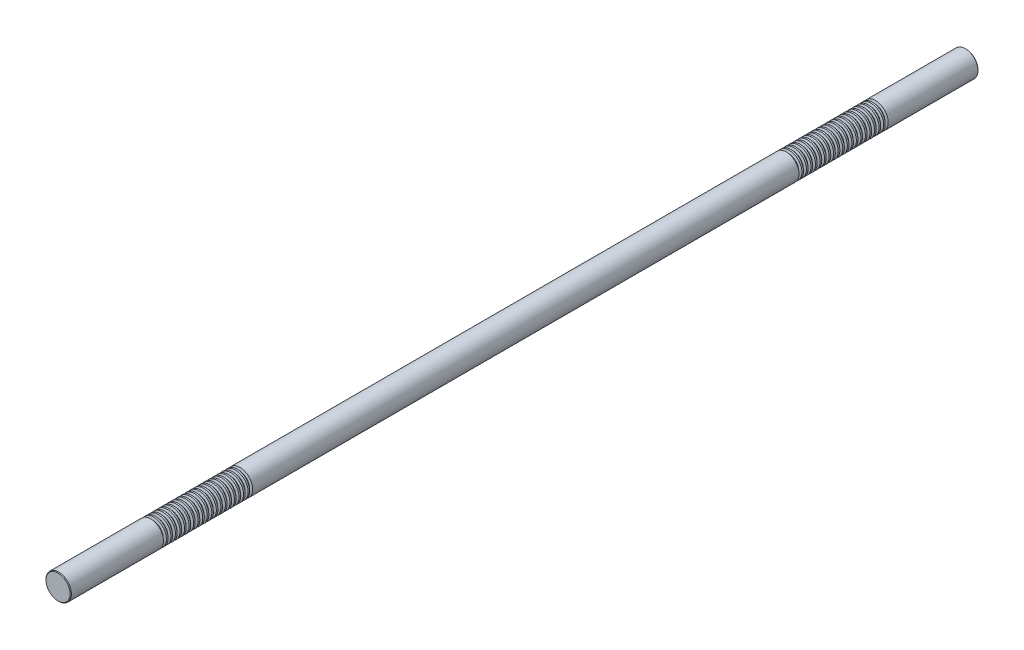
ISO-10303-21;
HEADER;
FILE_DESCRIPTION(('STEP AP214'),'2;1');
FILE_NAME('part.step','',(''),(''),'','','');
FILE_SCHEMA(('AUTOMOTIVE_DESIGN { 1 0 10303 214 1 1 1 1 }'));
ENDSEC;
DATA;
#1=APPLICATION_CONTEXT('core data for automotive mechanical design processes');
#2=APPLICATION_PROTOCOL_DEFINITION('international standard','automotive_design',2000,#1);
#3=PRODUCT_CONTEXT('',#1,'mechanical');
#4=PRODUCT('Part','Part','',(#3));
#5=PRODUCT_RELATED_PRODUCT_CATEGORY('part','',(#4));
#6=PRODUCT_DEFINITION_FORMATION('','',#4);
#7=PRODUCT_DEFINITION_CONTEXT('part definition',#1,'design');
#8=PRODUCT_DEFINITION('design','',#6,#7);
#9=PRODUCT_DEFINITION_SHAPE('','',#8);
#10=(LENGTH_UNIT() NAMED_UNIT(*) SI_UNIT(.MILLI.,.METRE.));
#11=(NAMED_UNIT(*) PLANE_ANGLE_UNIT() SI_UNIT($,.RADIAN.));
#12=(NAMED_UNIT(*) SI_UNIT($,.STERADIAN.) SOLID_ANGLE_UNIT());
#13=UNCERTAINTY_MEASURE_WITH_UNIT(LENGTH_MEASURE(1.E-05),#10,'distance_accuracy_value','');
#14=(GEOMETRIC_REPRESENTATION_CONTEXT(3) GLOBAL_UNCERTAINTY_ASSIGNED_CONTEXT((#13)) GLOBAL_UNIT_ASSIGNED_CONTEXT((#10,
#11,#12)) REPRESENTATION_CONTEXT('',''));
#15=CARTESIAN_POINT('',(0.,0.,0.));
#16=DIRECTION('',(0.,0.,1.));
#17=DIRECTION('',(1.,0.,0.));
#18=AXIS2_PLACEMENT_3D('',#15,#16,#17);
#19=CARTESIAN_POINT('',(0.,0.,500.));
#20=DIRECTION('',(0.,0.,-1.));
#21=DIRECTION('',(-1.,0.,0.));
#22=AXIS2_PLACEMENT_3D('',#19,#20,#21);
#23=CYLINDRICAL_SURFACE('',#22,14.);
#24=CARTESIAN_POINT('',(0.,0.,392.868430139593));
#25=DIRECTION('',(0.,0.,1.));
#26=DIRECTION('',(1.,0.,0.));
#27=AXIS2_PLACEMENT_3D('',#24,#25,#26);
#28=CIRCLE('',#27,14.);
#29=CARTESIAN_POINT('',(14.,0.,392.868430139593));
#30=VERTEX_POINT('',#29);
#31=EDGE_CURVE('E673',#30,#30,#28,.T.);
#32=ORIENTED_EDGE('',*,*,#31,.T.);
#33=EDGE_LOOP('',(#32));
#34=FACE_BOUND('',#33,.T.);
#35=CARTESIAN_POINT('',(0.,0.,394.631569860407));
#36=DIRECTION('',(0.,0.,1.));
#37=DIRECTION('',(1.,0.,0.));
#38=AXIS2_PLACEMENT_3D('',#35,#36,#37);
#39=CIRCLE('',#38,14.);
#40=CARTESIAN_POINT('',(14.,0.,394.631569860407));
#41=VERTEX_POINT('',#40);
#42=EDGE_CURVE('E685',#41,#41,#39,.T.);
#43=ORIENTED_EDGE('',*,*,#42,.F.);
#44=EDGE_LOOP('',(#43));
#45=FACE_BOUND('',#44,.T.);
#46=ADVANCED_FACE('F37',(#34,#45),#23,.T.);
#47=CARTESIAN_POINT('',(0.,0.,387.868430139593));
#48=DIRECTION('',(0.,0.,1.));
#49=DIRECTION('',(1.,0.,0.));
#50=AXIS2_PLACEMENT_3D('',#47,#48,#49);
#51=CIRCLE('',#50,14.);
#52=CARTESIAN_POINT('',(14.,0.,387.868430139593));
#53=VERTEX_POINT('',#52);
#54=EDGE_CURVE('E658',#53,#53,#51,.T.);
#55=ORIENTED_EDGE('',*,*,#54,.T.);
#56=EDGE_LOOP('',(#55));
#57=FACE_BOUND('',#56,.T.);
#58=CARTESIAN_POINT('',(0.,0.,389.631569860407));
#59=DIRECTION('',(0.,0.,1.));
#60=DIRECTION('',(1.,0.,0.));
#61=AXIS2_PLACEMENT_3D('',#58,#59,#60);
#62=CIRCLE('',#61,14.);
#63=CARTESIAN_POINT('',(14.,0.,389.631569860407));
#64=VERTEX_POINT('',#63);
#65=EDGE_CURVE('E669',#64,#64,#62,.T.);
#66=ORIENTED_EDGE('',*,*,#65,.F.);
#67=EDGE_LOOP('',(#66));
#68=FACE_BOUND('',#67,.T.);
#69=ADVANCED_FACE('F721',(#57,#68),#23,.T.);
#70=CARTESIAN_POINT('',(0.,0.,382.868430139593));
#71=DIRECTION('',(0.,0.,1.));
#72=DIRECTION('',(1.,0.,0.));
#73=AXIS2_PLACEMENT_3D('',#70,#71,#72);
#74=CIRCLE('',#73,14.);
#75=CARTESIAN_POINT('',(14.,0.,382.868430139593));
#76=VERTEX_POINT('',#75);
#77=EDGE_CURVE('E642',#76,#76,#74,.T.);
#78=ORIENTED_EDGE('',*,*,#77,.T.);
#79=EDGE_LOOP('',(#78));
#80=FACE_BOUND('',#79,.T.);
#81=CARTESIAN_POINT('',(0.,0.,384.631569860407));
#82=DIRECTION('',(0.,0.,1.));
#83=DIRECTION('',(1.,0.,0.));
#84=AXIS2_PLACEMENT_3D('',#81,#82,#83);
#85=CIRCLE('',#84,14.);
#86=CARTESIAN_POINT('',(14.,0.,384.631569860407));
#87=VERTEX_POINT('',#86);
#88=EDGE_CURVE('E654',#87,#87,#85,.T.);
#89=ORIENTED_EDGE('',*,*,#88,.F.);
#90=EDGE_LOOP('',(#89));
#91=FACE_BOUND('',#90,.T.);
#92=ADVANCED_FACE('F729',(#80,#91),#23,.T.);
#93=CARTESIAN_POINT('',(0.,0.,377.868430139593));
#94=DIRECTION('',(0.,0.,1.));
#95=DIRECTION('',(1.,0.,0.));
#96=AXIS2_PLACEMENT_3D('',#93,#94,#95);
#97=CIRCLE('',#96,14.);
#98=CARTESIAN_POINT('',(14.,0.,377.868430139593));
#99=VERTEX_POINT('',#98);
#100=EDGE_CURVE('E627',#99,#99,#97,.T.);
#101=ORIENTED_EDGE('',*,*,#100,.T.);
#102=EDGE_LOOP('',(#101));
#103=FACE_BOUND('',#102,.T.);
#104=CARTESIAN_POINT('',(0.,0.,379.631569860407));
#105=DIRECTION('',(0.,0.,1.));
#106=DIRECTION('',(1.,0.,0.));
#107=AXIS2_PLACEMENT_3D('',#104,#105,#106);
#108=CIRCLE('',#107,14.);
#109=CARTESIAN_POINT('',(14.,0.,379.631569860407));
#110=VERTEX_POINT('',#109);
#111=EDGE_CURVE('E639',#110,#110,#108,.T.);
#112=ORIENTED_EDGE('',*,*,#111,.F.);
#113=EDGE_LOOP('',(#112));
#114=FACE_BOUND('',#113,.T.);
#115=ADVANCED_FACE('F1550',(#103,#114),#23,.T.);
#116=CARTESIAN_POINT('',(0.,0.,372.868430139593));
#117=DIRECTION('',(0.,0.,1.));
#118=DIRECTION('',(1.,0.,0.));
#119=AXIS2_PLACEMENT_3D('',#116,#117,#118);
#120=CIRCLE('',#119,14.);
#121=CARTESIAN_POINT('',(14.,0.,372.868430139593));
#122=VERTEX_POINT('',#121);
#123=EDGE_CURVE('E611',#122,#122,#120,.T.);
#124=ORIENTED_EDGE('',*,*,#123,.T.);
#125=EDGE_LOOP('',(#124));
#126=FACE_BOUND('',#125,.T.);
#127=CARTESIAN_POINT('',(0.,0.,374.631569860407));
#128=DIRECTION('',(0.,0.,1.));
#129=DIRECTION('',(1.,0.,0.));
#130=AXIS2_PLACEMENT_3D('',#127,#128,#129);
#131=CIRCLE('',#130,14.);
#132=CARTESIAN_POINT('',(14.,0.,374.631569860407));
#133=VERTEX_POINT('',#132);
#134=EDGE_CURVE('E623',#133,#133,#131,.T.);
#135=ORIENTED_EDGE('',*,*,#134,.F.);
#136=EDGE_LOOP('',(#135));
#137=FACE_BOUND('',#136,.T.);
#138=ADVANCED_FACE('F1527',(#126,#137),#23,.T.);
#139=CARTESIAN_POINT('',(0.,0.,367.868430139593));
#140=DIRECTION('',(0.,0.,1.));
#141=DIRECTION('',(1.,0.,0.));
#142=AXIS2_PLACEMENT_3D('',#139,#140,#141);
#143=CIRCLE('',#142,14.);
#144=CARTESIAN_POINT('',(14.,0.,367.868430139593));
#145=VERTEX_POINT('',#144);
#146=EDGE_CURVE('E595',#145,#145,#143,.T.);
#147=ORIENTED_EDGE('',*,*,#146,.T.);
#148=EDGE_LOOP('',(#147));
#149=FACE_BOUND('',#148,.T.);
#150=CARTESIAN_POINT('',(0.,0.,369.631569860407));
#151=DIRECTION('',(0.,0.,1.));
#152=DIRECTION('',(1.,0.,0.));
#153=AXIS2_PLACEMENT_3D('',#150,#151,#152);
#154=CIRCLE('',#153,14.);
#155=CARTESIAN_POINT('',(14.,0.,369.631569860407));
#156=VERTEX_POINT('',#155);
#157=EDGE_CURVE('E607',#156,#156,#154,.T.);
#158=ORIENTED_EDGE('',*,*,#157,.F.);
#159=EDGE_LOOP('',(#158));
#160=FACE_BOUND('',#159,.T.);
#161=ADVANCED_FACE('F1504',(#149,#160),#23,.T.);
#162=CARTESIAN_POINT('',(0.,0.,362.868430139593));
#163=DIRECTION('',(0.,0.,1.));
#164=DIRECTION('',(1.,0.,0.));
#165=AXIS2_PLACEMENT_3D('',#162,#163,#164);
#166=CIRCLE('',#165,14.);
#167=CARTESIAN_POINT('',(14.,0.,362.868430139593));
#168=VERTEX_POINT('',#167);
#169=EDGE_CURVE('E579',#168,#168,#166,.T.);
#170=ORIENTED_EDGE('',*,*,#169,.T.);
#171=EDGE_LOOP('',(#170));
#172=FACE_BOUND('',#171,.T.);
#173=CARTESIAN_POINT('',(0.,0.,364.631569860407));
#174=DIRECTION('',(0.,0.,1.));
#175=DIRECTION('',(1.,0.,0.));
#176=AXIS2_PLACEMENT_3D('',#173,#174,#175);
#177=CIRCLE('',#176,14.);
#178=CARTESIAN_POINT('',(14.,0.,364.631569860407));
#179=VERTEX_POINT('',#178);
#180=EDGE_CURVE('E591',#179,#179,#177,.T.);
#181=ORIENTED_EDGE('',*,*,#180,.F.);
#182=EDGE_LOOP('',(#181));
#183=FACE_BOUND('',#182,.T.);
#184=ADVANCED_FACE('F1481',(#172,#183),#23,.T.);
#185=CARTESIAN_POINT('',(0.,0.,357.868430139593));
#186=DIRECTION('',(0.,0.,1.));
#187=DIRECTION('',(1.,0.,0.));
#188=AXIS2_PLACEMENT_3D('',#185,#186,#187);
#189=CIRCLE('',#188,14.);
#190=CARTESIAN_POINT('',(14.,0.,357.868430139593));
#191=VERTEX_POINT('',#190);
#192=EDGE_CURVE('E563',#191,#191,#189,.T.);
#193=ORIENTED_EDGE('',*,*,#192,.T.);
#194=EDGE_LOOP('',(#193));
#195=FACE_BOUND('',#194,.T.);
#196=CARTESIAN_POINT('',(0.,0.,359.631569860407));
#197=DIRECTION('',(0.,0.,1.));
#198=DIRECTION('',(1.,0.,0.));
#199=AXIS2_PLACEMENT_3D('',#196,#197,#198);
#200=CIRCLE('',#199,14.);
#201=CARTESIAN_POINT('',(14.,0.,359.631569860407));
#202=VERTEX_POINT('',#201);
#203=EDGE_CURVE('E575',#202,#202,#200,.T.);
#204=ORIENTED_EDGE('',*,*,#203,.F.);
#205=EDGE_LOOP('',(#204));
#206=FACE_BOUND('',#205,.T.);
#207=ADVANCED_FACE('F1458',(#195,#206),#23,.T.);
#208=CARTESIAN_POINT('',(0.,0.,352.868430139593));
#209=DIRECTION('',(0.,0.,1.));
#210=DIRECTION('',(1.,0.,0.));
#211=AXIS2_PLACEMENT_3D('',#208,#209,#210);
#212=CIRCLE('',#211,14.);
#213=CARTESIAN_POINT('',(14.,0.,352.868430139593));
#214=VERTEX_POINT('',#213);
#215=EDGE_CURVE('E547',#214,#214,#212,.T.);
#216=ORIENTED_EDGE('',*,*,#215,.T.);
#217=EDGE_LOOP('',(#216));
#218=FACE_BOUND('',#217,.T.);
#219=CARTESIAN_POINT('',(0.,0.,354.631569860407));
#220=DIRECTION('',(0.,0.,1.));
#221=DIRECTION('',(1.,0.,0.));
#222=AXIS2_PLACEMENT_3D('',#219,#220,#221);
#223=CIRCLE('',#222,14.);
#224=CARTESIAN_POINT('',(14.,0.,354.631569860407));
#225=VERTEX_POINT('',#224);
#226=EDGE_CURVE('E559',#225,#225,#223,.T.);
#227=ORIENTED_EDGE('',*,*,#226,.F.);
#228=EDGE_LOOP('',(#227));
#229=FACE_BOUND('',#228,.T.);
#230=ADVANCED_FACE('F1435',(#218,#229),#23,.T.);
#231=CARTESIAN_POINT('',(0.,0.,347.868430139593));
#232=DIRECTION('',(0.,0.,1.));
#233=DIRECTION('',(1.,0.,0.));
#234=AXIS2_PLACEMENT_3D('',#231,#232,#233);
#235=CIRCLE('',#234,14.);
#236=CARTESIAN_POINT('',(14.,0.,347.868430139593));
#237=VERTEX_POINT('',#236);
#238=EDGE_CURVE('E531',#237,#237,#235,.T.);
#239=ORIENTED_EDGE('',*,*,#238,.T.);
#240=EDGE_LOOP('',(#239));
#241=FACE_BOUND('',#240,.T.);
#242=CARTESIAN_POINT('',(0.,0.,349.631569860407));
#243=DIRECTION('',(0.,0.,1.));
#244=DIRECTION('',(1.,0.,0.));
#245=AXIS2_PLACEMENT_3D('',#242,#243,#244);
#246=CIRCLE('',#245,14.);
#247=CARTESIAN_POINT('',(14.,0.,349.631569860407));
#248=VERTEX_POINT('',#247);
#249=EDGE_CURVE('E543',#248,#248,#246,.T.);
#250=ORIENTED_EDGE('',*,*,#249,.F.);
#251=EDGE_LOOP('',(#250));
#252=FACE_BOUND('',#251,.T.);
#253=ADVANCED_FACE('F1412',(#241,#252),#23,.T.);
#254=CARTESIAN_POINT('',(0.,0.,342.868430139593));
#255=DIRECTION('',(0.,0.,1.));
#256=DIRECTION('',(1.,0.,0.));
#257=AXIS2_PLACEMENT_3D('',#254,#255,#256);
#258=CIRCLE('',#257,14.);
#259=CARTESIAN_POINT('',(14.,0.,342.868430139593));
#260=VERTEX_POINT('',#259);
#261=EDGE_CURVE('E515',#260,#260,#258,.T.);
#262=ORIENTED_EDGE('',*,*,#261,.T.);
#263=EDGE_LOOP('',(#262));
#264=FACE_BOUND('',#263,.T.);
#265=CARTESIAN_POINT('',(0.,0.,344.631569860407));
#266=DIRECTION('',(0.,0.,1.));
#267=DIRECTION('',(1.,0.,0.));
#268=AXIS2_PLACEMENT_3D('',#265,#266,#267);
#269=CIRCLE('',#268,14.);
#270=CARTESIAN_POINT('',(14.,0.,344.631569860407));
#271=VERTEX_POINT('',#270);
#272=EDGE_CURVE('E527',#271,#271,#269,.T.);
#273=ORIENTED_EDGE('',*,*,#272,.F.);
#274=EDGE_LOOP('',(#273));
#275=FACE_BOUND('',#274,.T.);
#276=ADVANCED_FACE('F1389',(#264,#275),#23,.T.);
#277=CARTESIAN_POINT('',(0.,0.,337.868430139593));
#278=DIRECTION('',(0.,0.,1.));
#279=DIRECTION('',(1.,0.,0.));
#280=AXIS2_PLACEMENT_3D('',#277,#278,#279);
#281=CIRCLE('',#280,14.);
#282=CARTESIAN_POINT('',(14.,0.,337.868430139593));
#283=VERTEX_POINT('',#282);
#284=EDGE_CURVE('E499',#283,#283,#281,.T.);
#285=ORIENTED_EDGE('',*,*,#284,.T.);
#286=EDGE_LOOP('',(#285));
#287=FACE_BOUND('',#286,.T.);
#288=CARTESIAN_POINT('',(0.,0.,339.631569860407));
#289=DIRECTION('',(0.,0.,1.));
#290=DIRECTION('',(1.,0.,0.));
#291=AXIS2_PLACEMENT_3D('',#288,#289,#290);
#292=CIRCLE('',#291,14.);
#293=CARTESIAN_POINT('',(14.,0.,339.631569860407));
#294=VERTEX_POINT('',#293);
#295=EDGE_CURVE('E511',#294,#294,#292,.T.);
#296=ORIENTED_EDGE('',*,*,#295,.F.);
#297=EDGE_LOOP('',(#296));
#298=FACE_BOUND('',#297,.T.);
#299=ADVANCED_FACE('F1366',(#287,#298),#23,.T.);
#300=CARTESIAN_POINT('',(0.,0.,332.868430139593));
#301=DIRECTION('',(0.,0.,1.));
#302=DIRECTION('',(1.,0.,0.));
#303=AXIS2_PLACEMENT_3D('',#300,#301,#302);
#304=CIRCLE('',#303,14.);
#305=CARTESIAN_POINT('',(14.,0.,332.868430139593));
#306=VERTEX_POINT('',#305);
#307=EDGE_CURVE('E483',#306,#306,#304,.T.);
#308=ORIENTED_EDGE('',*,*,#307,.T.);
#309=EDGE_LOOP('',(#308));
#310=FACE_BOUND('',#309,.T.);
#311=CARTESIAN_POINT('',(0.,0.,334.631569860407));
#312=DIRECTION('',(0.,0.,1.));
#313=DIRECTION('',(1.,0.,0.));
#314=AXIS2_PLACEMENT_3D('',#311,#312,#313);
#315=CIRCLE('',#314,14.);
#316=CARTESIAN_POINT('',(14.,0.,334.631569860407));
#317=VERTEX_POINT('',#316);
#318=EDGE_CURVE('E495',#317,#317,#315,.T.);
#319=ORIENTED_EDGE('',*,*,#318,.F.);
#320=EDGE_LOOP('',(#319));
#321=FACE_BOUND('',#320,.T.);
#322=ADVANCED_FACE('F1343',(#310,#321),#23,.T.);
#323=CARTESIAN_POINT('',(0.,0.,327.868430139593));
#324=DIRECTION('',(0.,0.,1.));
#325=DIRECTION('',(1.,0.,0.));
#326=AXIS2_PLACEMENT_3D('',#323,#324,#325);
#327=CIRCLE('',#326,14.);
#328=CARTESIAN_POINT('',(14.,0.,327.868430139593));
#329=VERTEX_POINT('',#328);
#330=EDGE_CURVE('E467',#329,#329,#327,.T.);
#331=ORIENTED_EDGE('',*,*,#330,.T.);
#332=EDGE_LOOP('',(#331));
#333=FACE_BOUND('',#332,.T.);
#334=CARTESIAN_POINT('',(0.,0.,329.631569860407));
#335=DIRECTION('',(0.,0.,1.));
#336=DIRECTION('',(1.,0.,0.));
#337=AXIS2_PLACEMENT_3D('',#334,#335,#336);
#338=CIRCLE('',#337,14.);
#339=CARTESIAN_POINT('',(14.,0.,329.631569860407));
#340=VERTEX_POINT('',#339);
#341=EDGE_CURVE('E479',#340,#340,#338,.T.);
#342=ORIENTED_EDGE('',*,*,#341,.F.);
#343=EDGE_LOOP('',(#342));
#344=FACE_BOUND('',#343,.T.);
#345=ADVANCED_FACE('F1320',(#333,#344),#23,.T.);
#346=CARTESIAN_POINT('',(0.,0.,322.868430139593));
#347=DIRECTION('',(0.,0.,1.));
#348=DIRECTION('',(1.,0.,0.));
#349=AXIS2_PLACEMENT_3D('',#346,#347,#348);
#350=CIRCLE('',#349,14.);
#351=CARTESIAN_POINT('',(14.,0.,322.868430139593));
#352=VERTEX_POINT('',#351);
#353=EDGE_CURVE('E451',#352,#352,#350,.T.);
#354=ORIENTED_EDGE('',*,*,#353,.T.);
#355=EDGE_LOOP('',(#354));
#356=FACE_BOUND('',#355,.T.);
#357=CARTESIAN_POINT('',(0.,0.,324.631569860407));
#358=DIRECTION('',(0.,0.,1.));
#359=DIRECTION('',(1.,0.,0.));
#360=AXIS2_PLACEMENT_3D('',#357,#358,#359);
#361=CIRCLE('',#360,14.);
#362=CARTESIAN_POINT('',(14.,0.,324.631569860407));
#363=VERTEX_POINT('',#362);
#364=EDGE_CURVE('E463',#363,#363,#361,.T.);
#365=ORIENTED_EDGE('',*,*,#364,.F.);
#366=EDGE_LOOP('',(#365));
#367=FACE_BOUND('',#366,.T.);
#368=ADVANCED_FACE('F1297',(#356,#367),#23,.T.);
#369=CARTESIAN_POINT('',(0.,0.,317.868430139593));
#370=DIRECTION('',(0.,0.,1.));
#371=DIRECTION('',(1.,0.,0.));
#372=AXIS2_PLACEMENT_3D('',#369,#370,#371);
#373=CIRCLE('',#372,14.);
#374=CARTESIAN_POINT('',(14.,0.,317.868430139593));
#375=VERTEX_POINT('',#374);
#376=EDGE_CURVE('E435',#375,#375,#373,.T.);
#377=ORIENTED_EDGE('',*,*,#376,.T.);
#378=EDGE_LOOP('',(#377));
#379=FACE_BOUND('',#378,.T.);
#380=CARTESIAN_POINT('',(0.,0.,319.631569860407));
#381=DIRECTION('',(0.,0.,1.));
#382=DIRECTION('',(1.,0.,0.));
#383=AXIS2_PLACEMENT_3D('',#380,#381,#382);
#384=CIRCLE('',#383,14.);
#385=CARTESIAN_POINT('',(14.,0.,319.631569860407));
#386=VERTEX_POINT('',#385);
#387=EDGE_CURVE('E447',#386,#386,#384,.T.);
#388=ORIENTED_EDGE('',*,*,#387,.F.);
#389=EDGE_LOOP('',(#388));
#390=FACE_BOUND('',#389,.T.);
#391=ADVANCED_FACE('F1274',(#379,#390),#23,.T.);
#392=CARTESIAN_POINT('',(0.,0.,312.868430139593));
#393=DIRECTION('',(0.,0.,1.));
#394=DIRECTION('',(1.,0.,0.));
#395=AXIS2_PLACEMENT_3D('',#392,#393,#394);
#396=CIRCLE('',#395,14.);
#397=CARTESIAN_POINT('',(14.,0.,312.868430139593));
#398=VERTEX_POINT('',#397);
#399=EDGE_CURVE('E419',#398,#398,#396,.T.);
#400=ORIENTED_EDGE('',*,*,#399,.T.);
#401=EDGE_LOOP('',(#400));
#402=FACE_BOUND('',#401,.T.);
#403=CARTESIAN_POINT('',(0.,0.,314.631569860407));
#404=DIRECTION('',(0.,0.,1.));
#405=DIRECTION('',(1.,0.,0.));
#406=AXIS2_PLACEMENT_3D('',#403,#404,#405);
#407=CIRCLE('',#406,14.);
#408=CARTESIAN_POINT('',(14.,0.,314.631569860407));
#409=VERTEX_POINT('',#408);
#410=EDGE_CURVE('E431',#409,#409,#407,.T.);
#411=ORIENTED_EDGE('',*,*,#410,.F.);
#412=EDGE_LOOP('',(#411));
#413=FACE_BOUND('',#412,.T.);
#414=ADVANCED_FACE('F1251',(#402,#413),#23,.T.);
#415=CARTESIAN_POINT('',(0.,0.,307.868430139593));
#416=DIRECTION('',(0.,0.,1.));
#417=DIRECTION('',(1.,0.,0.));
#418=AXIS2_PLACEMENT_3D('',#415,#416,#417);
#419=CIRCLE('',#418,14.);
#420=CARTESIAN_POINT('',(14.,0.,307.868430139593));
#421=VERTEX_POINT('',#420);
#422=EDGE_CURVE('E403',#421,#421,#419,.T.);
#423=ORIENTED_EDGE('',*,*,#422,.T.);
#424=EDGE_LOOP('',(#423));
#425=FACE_BOUND('',#424,.T.);
#426=CARTESIAN_POINT('',(0.,0.,309.631569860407));
#427=DIRECTION('',(0.,0.,1.));
#428=DIRECTION('',(1.,0.,0.));
#429=AXIS2_PLACEMENT_3D('',#426,#427,#428);
#430=CIRCLE('',#429,14.);
#431=CARTESIAN_POINT('',(14.,0.,309.631569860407));
#432=VERTEX_POINT('',#431);
#433=EDGE_CURVE('E415',#432,#432,#430,.T.);
#434=ORIENTED_EDGE('',*,*,#433,.F.);
#435=EDGE_LOOP('',(#434));
#436=FACE_BOUND('',#435,.T.);
#437=ADVANCED_FACE('F1228',(#425,#436),#23,.T.);
#438=CARTESIAN_POINT('',(0.,0.,302.868430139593));
#439=DIRECTION('',(0.,0.,1.));
#440=DIRECTION('',(1.,0.,0.));
#441=AXIS2_PLACEMENT_3D('',#438,#439,#440);
#442=CIRCLE('',#441,14.);
#443=CARTESIAN_POINT('',(14.,0.,302.868430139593));
#444=VERTEX_POINT('',#443);
#445=EDGE_CURVE('E387',#444,#444,#442,.T.);
#446=ORIENTED_EDGE('',*,*,#445,.T.);
#447=EDGE_LOOP('',(#446));
#448=FACE_BOUND('',#447,.T.);
#449=CARTESIAN_POINT('',(0.,0.,304.631569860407));
#450=DIRECTION('',(0.,0.,1.));
#451=DIRECTION('',(1.,0.,0.));
#452=AXIS2_PLACEMENT_3D('',#449,#450,#451);
#453=CIRCLE('',#452,14.);
#454=CARTESIAN_POINT('',(14.,0.,304.631569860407));
#455=VERTEX_POINT('',#454);
#456=EDGE_CURVE('E399',#455,#455,#453,.T.);
#457=ORIENTED_EDGE('',*,*,#456,.F.);
#458=EDGE_LOOP('',(#457));
#459=FACE_BOUND('',#458,.T.);
#460=ADVANCED_FACE('F1205',(#448,#459),#23,.T.);
#461=CARTESIAN_POINT('',(0.,0.,-302.131569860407));
#462=DIRECTION('',(0.,0.,1.));
#463=DIRECTION('',(1.,0.,0.));
#464=AXIS2_PLACEMENT_3D('',#461,#462,#463);
#465=CIRCLE('',#464,14.);
#466=CARTESIAN_POINT('',(14.,0.,-302.131569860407));
#467=VERTEX_POINT('',#466);
#468=EDGE_CURVE('E371',#467,#467,#465,.T.);
#469=ORIENTED_EDGE('',*,*,#468,.T.);
#470=EDGE_LOOP('',(#469));
#471=FACE_BOUND('',#470,.T.);
#472=CARTESIAN_POINT('',(0.,0.,299.631569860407));
#473=DIRECTION('',(0.,0.,1.));
#474=DIRECTION('',(1.,0.,0.));
#475=AXIS2_PLACEMENT_3D('',#472,#473,#474);
#476=CIRCLE('',#475,14.);
#477=CARTESIAN_POINT('',(14.,0.,299.631569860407));
#478=VERTEX_POINT('',#477);
#479=EDGE_CURVE('E383',#478,#478,#476,.T.);
#480=ORIENTED_EDGE('',*,*,#479,.F.);
#481=EDGE_LOOP('',(#480));
#482=FACE_BOUND('',#481,.T.);
#483=ADVANCED_FACE('F1182',(#471,#482),#23,.T.);
#484=CARTESIAN_POINT('',(0.,0.,-307.131569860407));
#485=DIRECTION('',(0.,0.,1.));
#486=DIRECTION('',(1.,0.,0.));
#487=AXIS2_PLACEMENT_3D('',#484,#485,#486);
#488=CIRCLE('',#487,14.);
#489=CARTESIAN_POINT('',(14.,0.,-307.131569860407));
#490=VERTEX_POINT('',#489);
#491=EDGE_CURVE('E355',#490,#490,#488,.T.);
#492=ORIENTED_EDGE('',*,*,#491,.T.);
#493=EDGE_LOOP('',(#492));
#494=FACE_BOUND('',#493,.T.);
#495=CARTESIAN_POINT('',(0.,0.,-305.368430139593));
#496=DIRECTION('',(0.,0.,1.));
#497=DIRECTION('',(1.,0.,0.));
#498=AXIS2_PLACEMENT_3D('',#495,#496,#497);
#499=CIRCLE('',#498,14.);
#500=CARTESIAN_POINT('',(14.,0.,-305.368430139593));
#501=VERTEX_POINT('',#500);
#502=EDGE_CURVE('E367',#501,#501,#499,.T.);
#503=ORIENTED_EDGE('',*,*,#502,.F.);
#504=EDGE_LOOP('',(#503));
#505=FACE_BOUND('',#504,.T.);
#506=ADVANCED_FACE('F1159',(#494,#505),#23,.T.);
#507=CARTESIAN_POINT('',(0.,0.,-312.131569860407));
#508=DIRECTION('',(0.,0.,1.));
#509=DIRECTION('',(1.,0.,0.));
#510=AXIS2_PLACEMENT_3D('',#507,#508,#509);
#511=CIRCLE('',#510,14.);
#512=CARTESIAN_POINT('',(14.,0.,-312.131569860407));
#513=VERTEX_POINT('',#512);
#514=EDGE_CURVE('E339',#513,#513,#511,.T.);
#515=ORIENTED_EDGE('',*,*,#514,.T.);
#516=EDGE_LOOP('',(#515));
#517=FACE_BOUND('',#516,.T.);
#518=CARTESIAN_POINT('',(0.,0.,-310.368430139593));
#519=DIRECTION('',(0.,0.,1.));
#520=DIRECTION('',(1.,0.,0.));
#521=AXIS2_PLACEMENT_3D('',#518,#519,#520);
#522=CIRCLE('',#521,14.);
#523=CARTESIAN_POINT('',(14.,0.,-310.368430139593));
#524=VERTEX_POINT('',#523);
#525=EDGE_CURVE('E351',#524,#524,#522,.T.);
#526=ORIENTED_EDGE('',*,*,#525,.F.);
#527=EDGE_LOOP('',(#526));
#528=FACE_BOUND('',#527,.T.);
#529=ADVANCED_FACE('F1136',(#517,#528),#23,.T.);
#530=CARTESIAN_POINT('',(0.,0.,-317.131569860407));
#531=DIRECTION('',(0.,0.,1.));
#532=DIRECTION('',(1.,0.,0.));
#533=AXIS2_PLACEMENT_3D('',#530,#531,#532);
#534=CIRCLE('',#533,14.);
#535=CARTESIAN_POINT('',(14.,0.,-317.131569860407));
#536=VERTEX_POINT('',#535);
#537=EDGE_CURVE('E323',#536,#536,#534,.T.);
#538=ORIENTED_EDGE('',*,*,#537,.T.);
#539=EDGE_LOOP('',(#538));
#540=FACE_BOUND('',#539,.T.);
#541=CARTESIAN_POINT('',(0.,0.,-315.368430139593));
#542=DIRECTION('',(0.,0.,1.));
#543=DIRECTION('',(1.,0.,0.));
#544=AXIS2_PLACEMENT_3D('',#541,#542,#543);
#545=CIRCLE('',#544,14.);
#546=CARTESIAN_POINT('',(14.,0.,-315.368430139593));
#547=VERTEX_POINT('',#546);
#548=EDGE_CURVE('E335',#547,#547,#545,.T.);
#549=ORIENTED_EDGE('',*,*,#548,.F.);
#550=EDGE_LOOP('',(#549));
#551=FACE_BOUND('',#550,.T.);
#552=ADVANCED_FACE('F1113',(#540,#551),#23,.T.);
#553=CARTESIAN_POINT('',(0.,0.,-322.131569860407));
#554=DIRECTION('',(0.,0.,1.));
#555=DIRECTION('',(1.,0.,0.));
#556=AXIS2_PLACEMENT_3D('',#553,#554,#555);
#557=CIRCLE('',#556,14.);
#558=CARTESIAN_POINT('',(14.,0.,-322.131569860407));
#559=VERTEX_POINT('',#558);
#560=EDGE_CURVE('E307',#559,#559,#557,.T.);
#561=ORIENTED_EDGE('',*,*,#560,.T.);
#562=EDGE_LOOP('',(#561));
#563=FACE_BOUND('',#562,.T.);
#564=CARTESIAN_POINT('',(0.,0.,-320.368430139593));
#565=DIRECTION('',(0.,0.,1.));
#566=DIRECTION('',(1.,0.,0.));
#567=AXIS2_PLACEMENT_3D('',#564,#565,#566);
#568=CIRCLE('',#567,14.);
#569=CARTESIAN_POINT('',(14.,0.,-320.368430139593));
#570=VERTEX_POINT('',#569);
#571=EDGE_CURVE('E319',#570,#570,#568,.T.);
#572=ORIENTED_EDGE('',*,*,#571,.F.);
#573=EDGE_LOOP('',(#572));
#574=FACE_BOUND('',#573,.T.);
#575=ADVANCED_FACE('F1090',(#563,#574),#23,.T.);
#576=CARTESIAN_POINT('',(0.,0.,-327.131569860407));
#577=DIRECTION('',(0.,0.,1.));
#578=DIRECTION('',(1.,0.,0.));
#579=AXIS2_PLACEMENT_3D('',#576,#577,#578);
#580=CIRCLE('',#579,14.);
#581=CARTESIAN_POINT('',(14.,0.,-327.131569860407));
#582=VERTEX_POINT('',#581);
#583=EDGE_CURVE('E291',#582,#582,#580,.T.);
#584=ORIENTED_EDGE('',*,*,#583,.T.);
#585=EDGE_LOOP('',(#584));
#586=FACE_BOUND('',#585,.T.);
#587=CARTESIAN_POINT('',(0.,0.,-325.368430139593));
#588=DIRECTION('',(0.,0.,1.));
#589=DIRECTION('',(1.,0.,0.));
#590=AXIS2_PLACEMENT_3D('',#587,#588,#589);
#591=CIRCLE('',#590,14.);
#592=CARTESIAN_POINT('',(14.,0.,-325.368430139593));
#593=VERTEX_POINT('',#592);
#594=EDGE_CURVE('E303',#593,#593,#591,.T.);
#595=ORIENTED_EDGE('',*,*,#594,.F.);
#596=EDGE_LOOP('',(#595));
#597=FACE_BOUND('',#596,.T.);
#598=ADVANCED_FACE('F1067',(#586,#597),#23,.T.);
#599=CARTESIAN_POINT('',(0.,0.,-332.131569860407));
#600=DIRECTION('',(0.,0.,1.));
#601=DIRECTION('',(1.,0.,0.));
#602=AXIS2_PLACEMENT_3D('',#599,#600,#601);
#603=CIRCLE('',#602,14.);
#604=CARTESIAN_POINT('',(14.,0.,-332.131569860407));
#605=VERTEX_POINT('',#604);
#606=EDGE_CURVE('E275',#605,#605,#603,.T.);
#607=ORIENTED_EDGE('',*,*,#606,.T.);
#608=EDGE_LOOP('',(#607));
#609=FACE_BOUND('',#608,.T.);
#610=CARTESIAN_POINT('',(0.,0.,-330.368430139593));
#611=DIRECTION('',(0.,0.,1.));
#612=DIRECTION('',(1.,0.,0.));
#613=AXIS2_PLACEMENT_3D('',#610,#611,#612);
#614=CIRCLE('',#613,14.);
#615=CARTESIAN_POINT('',(14.,0.,-330.368430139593));
#616=VERTEX_POINT('',#615);
#617=EDGE_CURVE('E287',#616,#616,#614,.T.);
#618=ORIENTED_EDGE('',*,*,#617,.F.);
#619=EDGE_LOOP('',(#618));
#620=FACE_BOUND('',#619,.T.);
#621=ADVANCED_FACE('F1044',(#609,#620),#23,.T.);
#622=CARTESIAN_POINT('',(0.,0.,-337.131569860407));
#623=DIRECTION('',(0.,0.,1.));
#624=DIRECTION('',(1.,0.,0.));
#625=AXIS2_PLACEMENT_3D('',#622,#623,#624);
#626=CIRCLE('',#625,14.);
#627=CARTESIAN_POINT('',(14.,0.,-337.131569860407));
#628=VERTEX_POINT('',#627);
#629=EDGE_CURVE('E259',#628,#628,#626,.T.);
#630=ORIENTED_EDGE('',*,*,#629,.T.);
#631=EDGE_LOOP('',(#630));
#632=FACE_BOUND('',#631,.T.);
#633=CARTESIAN_POINT('',(0.,0.,-335.368430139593));
#634=DIRECTION('',(0.,0.,1.));
#635=DIRECTION('',(1.,0.,0.));
#636=AXIS2_PLACEMENT_3D('',#633,#634,#635);
#637=CIRCLE('',#636,14.);
#638=CARTESIAN_POINT('',(14.,0.,-335.368430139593));
#639=VERTEX_POINT('',#638);
#640=EDGE_CURVE('E271',#639,#639,#637,.T.);
#641=ORIENTED_EDGE('',*,*,#640,.F.);
#642=EDGE_LOOP('',(#641));
#643=FACE_BOUND('',#642,.T.);
#644=ADVANCED_FACE('F1021',(#632,#643),#23,.T.);
#645=CARTESIAN_POINT('',(0.,0.,-342.131569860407));
#646=DIRECTION('',(0.,0.,1.));
#647=DIRECTION('',(1.,0.,0.));
#648=AXIS2_PLACEMENT_3D('',#645,#646,#647);
#649=CIRCLE('',#648,14.);
#650=CARTESIAN_POINT('',(14.,0.,-342.131569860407));
#651=VERTEX_POINT('',#650);
#652=EDGE_CURVE('E243',#651,#651,#649,.T.);
#653=ORIENTED_EDGE('',*,*,#652,.T.);
#654=EDGE_LOOP('',(#653));
#655=FACE_BOUND('',#654,.T.);
#656=CARTESIAN_POINT('',(0.,0.,-340.368430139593));
#657=DIRECTION('',(0.,0.,1.));
#658=DIRECTION('',(1.,0.,0.));
#659=AXIS2_PLACEMENT_3D('',#656,#657,#658);
#660=CIRCLE('',#659,14.);
#661=CARTESIAN_POINT('',(14.,0.,-340.368430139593));
#662=VERTEX_POINT('',#661);
#663=EDGE_CURVE('E255',#662,#662,#660,.T.);
#664=ORIENTED_EDGE('',*,*,#663,.F.);
#665=EDGE_LOOP('',(#664));
#666=FACE_BOUND('',#665,.T.);
#667=ADVANCED_FACE('F998',(#655,#666),#23,.T.);
#668=CARTESIAN_POINT('',(0.,0.,-347.131569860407));
#669=DIRECTION('',(0.,0.,1.));
#670=DIRECTION('',(1.,0.,0.));
#671=AXIS2_PLACEMENT_3D('',#668,#669,#670);
#672=CIRCLE('',#671,14.);
#673=CARTESIAN_POINT('',(14.,0.,-347.131569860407));
#674=VERTEX_POINT('',#673);
#675=EDGE_CURVE('E228',#674,#674,#672,.T.);
#676=ORIENTED_EDGE('',*,*,#675,.T.);
#677=EDGE_LOOP('',(#676));
#678=FACE_BOUND('',#677,.T.);
#679=CARTESIAN_POINT('',(0.,0.,-345.368430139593));
#680=DIRECTION('',(0.,0.,1.));
#681=DIRECTION('',(1.,0.,0.));
#682=AXIS2_PLACEMENT_3D('',#679,#680,#681);
#683=CIRCLE('',#682,14.);
#684=CARTESIAN_POINT('',(14.,0.,-345.368430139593));
#685=VERTEX_POINT('',#684);
#686=EDGE_CURVE('E239',#685,#685,#683,.T.);
#687=ORIENTED_EDGE('',*,*,#686,.F.);
#688=EDGE_LOOP('',(#687));
#689=FACE_BOUND('',#688,.T.);
#690=ADVANCED_FACE('F975',(#678,#689),#23,.T.);
#691=CARTESIAN_POINT('',(0.,0.,-352.131569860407));
#692=DIRECTION('',(0.,0.,1.));
#693=DIRECTION('',(1.,0.,0.));
#694=AXIS2_PLACEMENT_3D('',#691,#692,#693);
#695=CIRCLE('',#694,14.);
#696=CARTESIAN_POINT('',(14.,0.,-352.131569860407));
#697=VERTEX_POINT('',#696);
#698=EDGE_CURVE('E212',#697,#697,#695,.T.);
#699=ORIENTED_EDGE('',*,*,#698,.T.);
#700=EDGE_LOOP('',(#699));
#701=FACE_BOUND('',#700,.T.);
#702=CARTESIAN_POINT('',(0.,0.,-350.368430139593));
#703=DIRECTION('',(0.,0.,1.));
#704=DIRECTION('',(1.,0.,0.));
#705=AXIS2_PLACEMENT_3D('',#702,#703,#704);
#706=CIRCLE('',#705,14.);
#707=CARTESIAN_POINT('',(14.,0.,-350.368430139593));
#708=VERTEX_POINT('',#707);
#709=EDGE_CURVE('E224',#708,#708,#706,.T.);
#710=ORIENTED_EDGE('',*,*,#709,.F.);
#711=EDGE_LOOP('',(#710));
#712=FACE_BOUND('',#711,.T.);
#713=ADVANCED_FACE('F952',(#701,#712),#23,.T.);
#714=CARTESIAN_POINT('',(0.,0.,-357.131569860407));
#715=DIRECTION('',(0.,0.,1.));
#716=DIRECTION('',(1.,0.,0.));
#717=AXIS2_PLACEMENT_3D('',#714,#715,#716);
#718=CIRCLE('',#717,14.);
#719=CARTESIAN_POINT('',(14.,0.,-357.131569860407));
#720=VERTEX_POINT('',#719);
#721=EDGE_CURVE('E196',#720,#720,#718,.T.);
#722=ORIENTED_EDGE('',*,*,#721,.T.);
#723=EDGE_LOOP('',(#722));
#724=FACE_BOUND('',#723,.T.);
#725=CARTESIAN_POINT('',(0.,0.,-355.368430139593));
#726=DIRECTION('',(0.,0.,1.));
#727=DIRECTION('',(1.,0.,0.));
#728=AXIS2_PLACEMENT_3D('',#725,#726,#727);
#729=CIRCLE('',#728,14.);
#730=CARTESIAN_POINT('',(14.,0.,-355.368430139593));
#731=VERTEX_POINT('',#730);
#732=EDGE_CURVE('E208',#731,#731,#729,.T.);
#733=ORIENTED_EDGE('',*,*,#732,.F.);
#734=EDGE_LOOP('',(#733));
#735=FACE_BOUND('',#734,.T.);
#736=ADVANCED_FACE('F929',(#724,#735),#23,.T.);
#737=CARTESIAN_POINT('',(0.,0.,-362.131569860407));
#738=DIRECTION('',(0.,0.,1.));
#739=DIRECTION('',(1.,0.,0.));
#740=AXIS2_PLACEMENT_3D('',#737,#738,#739);
#741=CIRCLE('',#740,14.);
#742=CARTESIAN_POINT('',(14.,0.,-362.131569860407));
#743=VERTEX_POINT('',#742);
#744=EDGE_CURVE('E180',#743,#743,#741,.T.);
#745=ORIENTED_EDGE('',*,*,#744,.T.);
#746=EDGE_LOOP('',(#745));
#747=FACE_BOUND('',#746,.T.);
#748=CARTESIAN_POINT('',(0.,0.,-360.368430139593));
#749=DIRECTION('',(0.,0.,1.));
#750=DIRECTION('',(1.,0.,0.));
#751=AXIS2_PLACEMENT_3D('',#748,#749,#750);
#752=CIRCLE('',#751,14.);
#753=CARTESIAN_POINT('',(14.,0.,-360.368430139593));
#754=VERTEX_POINT('',#753);
#755=EDGE_CURVE('E192',#754,#754,#752,.T.);
#756=ORIENTED_EDGE('',*,*,#755,.F.);
#757=EDGE_LOOP('',(#756));
#758=FACE_BOUND('',#757,.T.);
#759=ADVANCED_FACE('F906',(#747,#758),#23,.T.);
#760=CARTESIAN_POINT('',(0.,0.,-367.131569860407));
#761=DIRECTION('',(0.,0.,1.));
#762=DIRECTION('',(1.,0.,0.));
#763=AXIS2_PLACEMENT_3D('',#760,#761,#762);
#764=CIRCLE('',#763,14.);
#765=CARTESIAN_POINT('',(14.,0.,-367.131569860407));
#766=VERTEX_POINT('',#765);
#767=EDGE_CURVE('E164',#766,#766,#764,.T.);
#768=ORIENTED_EDGE('',*,*,#767,.T.);
#769=EDGE_LOOP('',(#768));
#770=FACE_BOUND('',#769,.T.);
#771=CARTESIAN_POINT('',(0.,0.,-365.368430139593));
#772=DIRECTION('',(0.,0.,1.));
#773=DIRECTION('',(1.,0.,0.));
#774=AXIS2_PLACEMENT_3D('',#771,#772,#773);
#775=CIRCLE('',#774,14.);
#776=CARTESIAN_POINT('',(14.,0.,-365.368430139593));
#777=VERTEX_POINT('',#776);
#778=EDGE_CURVE('E176',#777,#777,#775,.T.);
#779=ORIENTED_EDGE('',*,*,#778,.F.);
#780=EDGE_LOOP('',(#779));
#781=FACE_BOUND('',#780,.T.);
#782=ADVANCED_FACE('F883',(#770,#781),#23,.T.);
#783=CARTESIAN_POINT('',(0.,0.,-372.131569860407));
#784=DIRECTION('',(0.,0.,1.));
#785=DIRECTION('',(1.,0.,0.));
#786=AXIS2_PLACEMENT_3D('',#783,#784,#785);
#787=CIRCLE('',#786,14.);
#788=CARTESIAN_POINT('',(14.,0.,-372.131569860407));
#789=VERTEX_POINT('',#788);
#790=EDGE_CURVE('E148',#789,#789,#787,.T.);
#791=ORIENTED_EDGE('',*,*,#790,.T.);
#792=EDGE_LOOP('',(#791));
#793=FACE_BOUND('',#792,.T.);
#794=CARTESIAN_POINT('',(0.,0.,-370.368430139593));
#795=DIRECTION('',(0.,0.,1.));
#796=DIRECTION('',(1.,0.,0.));
#797=AXIS2_PLACEMENT_3D('',#794,#795,#796);
#798=CIRCLE('',#797,14.);
#799=CARTESIAN_POINT('',(14.,0.,-370.368430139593));
#800=VERTEX_POINT('',#799);
#801=EDGE_CURVE('E160',#800,#800,#798,.T.);
#802=ORIENTED_EDGE('',*,*,#801,.F.);
#803=EDGE_LOOP('',(#802));
#804=FACE_BOUND('',#803,.T.);
#805=ADVANCED_FACE('F860',(#793,#804),#23,.T.);
#806=CARTESIAN_POINT('',(0.,0.,-377.131569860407));
#807=DIRECTION('',(0.,0.,1.));
#808=DIRECTION('',(1.,0.,0.));
#809=AXIS2_PLACEMENT_3D('',#806,#807,#808);
#810=CIRCLE('',#809,14.);
#811=CARTESIAN_POINT('',(14.,0.,-377.131569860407));
#812=VERTEX_POINT('',#811);
#813=EDGE_CURVE('E132',#812,#812,#810,.T.);
#814=ORIENTED_EDGE('',*,*,#813,.T.);
#815=EDGE_LOOP('',(#814));
#816=FACE_BOUND('',#815,.T.);
#817=CARTESIAN_POINT('',(0.,0.,-375.368430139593));
#818=DIRECTION('',(0.,0.,1.));
#819=DIRECTION('',(1.,0.,0.));
#820=AXIS2_PLACEMENT_3D('',#817,#818,#819);
#821=CIRCLE('',#820,14.);
#822=CARTESIAN_POINT('',(14.,0.,-375.368430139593));
#823=VERTEX_POINT('',#822);
#824=EDGE_CURVE('E144',#823,#823,#821,.T.);
#825=ORIENTED_EDGE('',*,*,#824,.F.);
#826=EDGE_LOOP('',(#825));
#827=FACE_BOUND('',#826,.T.);
#828=ADVANCED_FACE('F837',(#816,#827),#23,.T.);
#829=CARTESIAN_POINT('',(0.,0.,-382.131569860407));
#830=DIRECTION('',(0.,0.,1.));
#831=DIRECTION('',(1.,0.,0.));
#832=AXIS2_PLACEMENT_3D('',#829,#830,#831);
#833=CIRCLE('',#832,14.);
#834=CARTESIAN_POINT('',(14.,0.,-382.131569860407));
#835=VERTEX_POINT('',#834);
#836=EDGE_CURVE('E116',#835,#835,#833,.T.);
#837=ORIENTED_EDGE('',*,*,#836,.T.);
#838=EDGE_LOOP('',(#837));
#839=FACE_BOUND('',#838,.T.);
#840=CARTESIAN_POINT('',(0.,0.,-380.368430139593));
#841=DIRECTION('',(0.,0.,1.));
#842=DIRECTION('',(1.,0.,0.));
#843=AXIS2_PLACEMENT_3D('',#840,#841,#842);
#844=CIRCLE('',#843,14.);
#845=CARTESIAN_POINT('',(14.,0.,-380.368430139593));
#846=VERTEX_POINT('',#845);
#847=EDGE_CURVE('E128',#846,#846,#844,.T.);
#848=ORIENTED_EDGE('',*,*,#847,.F.);
#849=EDGE_LOOP('',(#848));
#850=FACE_BOUND('',#849,.T.);
#851=ADVANCED_FACE('F814',(#839,#850),#23,.T.);
#852=CARTESIAN_POINT('',(0.,0.,-387.131569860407));
#853=DIRECTION('',(0.,0.,1.));
#854=DIRECTION('',(1.,0.,0.));
#855=AXIS2_PLACEMENT_3D('',#852,#853,#854);
#856=CIRCLE('',#855,14.);
#857=CARTESIAN_POINT('',(14.,0.,-387.131569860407));
#858=VERTEX_POINT('',#857);
#859=EDGE_CURVE('E100',#858,#858,#856,.T.);
#860=ORIENTED_EDGE('',*,*,#859,.T.);
#861=EDGE_LOOP('',(#860));
#862=FACE_BOUND('',#861,.T.);
#863=CARTESIAN_POINT('',(0.,0.,-385.368430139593));
#864=DIRECTION('',(0.,0.,1.));
#865=DIRECTION('',(1.,0.,0.));
#866=AXIS2_PLACEMENT_3D('',#863,#864,#865);
#867=CIRCLE('',#866,14.);
#868=CARTESIAN_POINT('',(14.,0.,-385.368430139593));
#869=VERTEX_POINT('',#868);
#870=EDGE_CURVE('E112',#869,#869,#867,.T.);
#871=ORIENTED_EDGE('',*,*,#870,.F.);
#872=EDGE_LOOP('',(#871));
#873=FACE_BOUND('',#872,.T.);
#874=ADVANCED_FACE('F791',(#862,#873),#23,.T.);
#875=CARTESIAN_POINT('',(0.,0.,-392.131569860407));
#876=DIRECTION('',(0.,0.,1.));
#877=DIRECTION('',(1.,0.,0.));
#878=AXIS2_PLACEMENT_3D('',#875,#876,#877);
#879=CIRCLE('',#878,14.);
#880=CARTESIAN_POINT('',(14.,0.,-392.131569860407));
#881=VERTEX_POINT('',#880);
#882=EDGE_CURVE('E84',#881,#881,#879,.T.);
#883=ORIENTED_EDGE('',*,*,#882,.T.);
#884=EDGE_LOOP('',(#883));
#885=FACE_BOUND('',#884,.T.);
#886=CARTESIAN_POINT('',(0.,0.,-390.368430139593));
#887=DIRECTION('',(0.,0.,1.));
#888=DIRECTION('',(1.,0.,0.));
#889=AXIS2_PLACEMENT_3D('',#886,#887,#888);
#890=CIRCLE('',#889,14.);
#891=CARTESIAN_POINT('',(14.,0.,-390.368430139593));
#892=VERTEX_POINT('',#891);
#893=EDGE_CURVE('E96',#892,#892,#890,.T.);
#894=ORIENTED_EDGE('',*,*,#893,.F.);
#895=EDGE_LOOP('',(#894));
#896=FACE_BOUND('',#895,.T.);
#897=ADVANCED_FACE('F744',(#885,#896),#23,.T.);
#898=CARTESIAN_POINT('',(0.,0.,-397.131569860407));
#899=DIRECTION('',(0.,0.,1.));
#900=DIRECTION('',(1.,0.,0.));
#901=AXIS2_PLACEMENT_3D('',#898,#899,#900);
#902=CIRCLE('',#901,14.);
#903=CARTESIAN_POINT('',(14.,0.,-397.131569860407));
#904=VERTEX_POINT('',#903);
#905=EDGE_CURVE('E69',#904,#904,#902,.T.);
#906=ORIENTED_EDGE('',*,*,#905,.T.);
#907=EDGE_LOOP('',(#906));
#908=FACE_BOUND('',#907,.T.);
#909=CARTESIAN_POINT('',(0.,0.,-395.368430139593));
#910=DIRECTION('',(0.,0.,1.));
#911=DIRECTION('',(1.,0.,0.));
#912=AXIS2_PLACEMENT_3D('',#909,#910,#911);
#913=CIRCLE('',#912,14.);
#914=CARTESIAN_POINT('',(14.,0.,-395.368430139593));
#915=VERTEX_POINT('',#914);
#916=EDGE_CURVE('E81',#915,#915,#913,.T.);
#917=ORIENTED_EDGE('',*,*,#916,.F.);
#918=EDGE_LOOP('',(#917));
#919=FACE_BOUND('',#918,.T.);
#920=ADVANCED_FACE('F737',(#908,#919),#23,.T.);
#921=CARTESIAN_POINT('',(0.,0.,-499.3));
#922=DIRECTION('',(0.,0.,1.));
#923=DIRECTION('',(1.,0.,0.));
#924=AXIS2_PLACEMENT_3D('',#921,#922,#923);
#925=CIRCLE('',#924,14.);
#926=CARTESIAN_POINT('',(14.,0.,-499.3));
#927=VERTEX_POINT('',#926);
#928=EDGE_CURVE('E52',#927,#927,#925,.T.);
#929=ORIENTED_EDGE('',*,*,#928,.T.);
#930=EDGE_LOOP('',(#929));
#931=FACE_BOUND('',#930,.T.);
#932=CARTESIAN_POINT('',(0.,0.,-400.368430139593));
#933=DIRECTION('',(0.,0.,1.));
#934=DIRECTION('',(1.,0.,0.));
#935=AXIS2_PLACEMENT_3D('',#932,#933,#934);
#936=CIRCLE('',#935,14.);
#937=CARTESIAN_POINT('',(14.,0.,-400.368430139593));
#938=VERTEX_POINT('',#937);
#939=EDGE_CURVE('E65',#938,#938,#936,.T.);
#940=ORIENTED_EDGE('',*,*,#939,.F.);
#941=EDGE_LOOP('',(#940));
#942=FACE_BOUND('',#941,.T.);
#943=ADVANCED_FACE('F725',(#931,#942),#23,.T.);
#944=CARTESIAN_POINT('',(0.,0.,-500.));
#945=DIRECTION('',(0.,0.,1.));
#946=DIRECTION('',(1.,0.,0.));
#947=AXIS2_PLACEMENT_3D('',#944,#945,#946);
#948=PLANE('',#947);
#949=CARTESIAN_POINT('',(0.,0.,-500.));
#950=DIRECTION('',(0.,0.,1.));
#951=DIRECTION('',(1.,0.,0.));
#952=AXIS2_PLACEMENT_3D('',#949,#950,#951);
#953=CIRCLE('',#952,13.3);
#954=CARTESIAN_POINT('',(13.3,0.,-500.));
#955=VERTEX_POINT('',#954);
#956=EDGE_CURVE('E45',#955,#955,#953,.F.);
#957=ORIENTED_EDGE('',*,*,#956,.T.);
#958=EDGE_LOOP('',(#957));
#959=FACE_BOUND('',#958,.T.);
#960=ADVANCED_FACE('F736',(#959),#948,.F.);
#961=CARTESIAN_POINT('',(0.,0.,-499.3));
#962=DIRECTION('',(0.,0.,1.));
#963=DIRECTION('',(1.,0.,0.));
#964=AXIS2_PLACEMENT_3D('',#961,#962,#963);
#965=CONICAL_SURFACE('',#964,14.,0.78539816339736);
#966=ORIENTED_EDGE('',*,*,#956,.F.);
#967=EDGE_LOOP('',(#966));
#968=FACE_BOUND('',#967,.T.);
#969=ORIENTED_EDGE('',*,*,#928,.F.);
#970=EDGE_LOOP('',(#969));
#971=FACE_BOUND('',#970,.T.);
#972=ADVANCED_FACE('F743',(#968,#971),#965,.T.);
#973=CARTESIAN_POINT('',(0.,0.,-399.631569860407));
#974=DIRECTION('',(0.,0.,-1.));
#975=DIRECTION('',(-1.,0.,0.));
#976=AXIS2_PLACEMENT_3D('',#973,#974,#975);
#977=CONICAL_SURFACE('',#976,11.25,1.30899693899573);
#978=ORIENTED_EDGE('',*,*,#939,.T.);
#979=EDGE_LOOP('',(#978));
#980=FACE_BOUND('',#979,.T.);
#981=CARTESIAN_POINT('',(0.,0.,-399.631569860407));
#982=DIRECTION('',(0.,0.,1.));
#983=DIRECTION('',(1.,0.,0.));
#984=AXIS2_PLACEMENT_3D('',#981,#982,#983);
#985=CIRCLE('',#984,11.25);
#986=CARTESIAN_POINT('',(11.25,0.,-399.631569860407));
#987=VERTEX_POINT('',#986);
#988=EDGE_CURVE('E77',#987,#987,#985,.T.);
#989=ORIENTED_EDGE('',*,*,#988,.F.);
#990=EDGE_LOOP('',(#989));
#991=FACE_BOUND('',#990,.T.);
#992=ADVANCED_FACE('F750',(#980,#991),#977,.T.);
#993=CARTESIAN_POINT('',(0.,0.,-397.131569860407));
#994=DIRECTION('',(0.,0.,1.));
#995=DIRECTION('',(1.,0.,0.));
#996=AXIS2_PLACEMENT_3D('',#993,#994,#995);
#997=CONICAL_SURFACE('',#996,14.,1.30899693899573);
#998=CARTESIAN_POINT('',(0.,0.,-397.868430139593));
#999=DIRECTION('',(0.,0.,1.));
#1000=DIRECTION('',(1.,0.,0.));
#1001=AXIS2_PLACEMENT_3D('',#998,#999,#1000);
#1002=CIRCLE('',#1001,11.25);
#1003=CARTESIAN_POINT('',(11.25,0.,-397.868430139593));
#1004=VERTEX_POINT('',#1003);
#1005=EDGE_CURVE('E73',#1004,#1004,#1002,.T.);
#1006=ORIENTED_EDGE('',*,*,#1005,.T.);
#1007=EDGE_LOOP('',(#1006));
#1008=FACE_BOUND('',#1007,.T.);
#1009=ORIENTED_EDGE('',*,*,#905,.F.);
#1010=EDGE_LOOP('',(#1009));
#1011=FACE_BOUND('',#1010,.T.);
#1012=ADVANCED_FACE('F753',(#1008,#1011),#997,.T.);
#1013=CARTESIAN_POINT('',(0.,0.,499.3));
#1014=DIRECTION('',(0.,0.,1.));
#1015=DIRECTION('',(1.,0.,0.));
#1016=AXIS2_PLACEMENT_3D('',#1013,#1014,#1015);
#1017=CYLINDRICAL_SURFACE('',#1016,11.25);
#1018=ORIENTED_EDGE('',*,*,#988,.T.);
#1019=EDGE_LOOP('',(#1018));
#1020=FACE_BOUND('',#1019,.T.);
#1021=ORIENTED_EDGE('',*,*,#1005,.F.);
#1022=EDGE_LOOP('',(#1021));
#1023=FACE_BOUND('',#1022,.T.);
#1024=ADVANCED_FACE('F757',(#1020,#1023),#1017,.T.);
#1025=CARTESIAN_POINT('',(0.,0.,-394.631569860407));
#1026=DIRECTION('',(0.,0.,-1.));
#1027=DIRECTION('',(-1.,0.,0.));
#1028=AXIS2_PLACEMENT_3D('',#1025,#1026,#1027);
#1029=CONICAL_SURFACE('',#1028,11.25,1.30899693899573);
#1030=ORIENTED_EDGE('',*,*,#916,.T.);
#1031=EDGE_LOOP('',(#1030));
#1032=FACE_BOUND('',#1031,.T.);
#1033=CARTESIAN_POINT('',(0.,0.,-394.631569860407));
#1034=DIRECTION('',(0.,0.,1.));
#1035=DIRECTION('',(1.,0.,0.));
#1036=AXIS2_PLACEMENT_3D('',#1033,#1034,#1035);
#1037=CIRCLE('',#1036,11.25);
#1038=CARTESIAN_POINT('',(11.25,0.,-394.631569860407));
#1039=VERTEX_POINT('',#1038);
#1040=EDGE_CURVE('E92',#1039,#1039,#1037,.T.);
#1041=ORIENTED_EDGE('',*,*,#1040,.F.);
#1042=EDGE_LOOP('',(#1041));
#1043=FACE_BOUND('',#1042,.T.);
#1044=ADVANCED_FACE('F760',(#1032,#1043),#1029,.T.);
#1045=CARTESIAN_POINT('',(0.,0.,-392.131569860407));
#1046=DIRECTION('',(0.,0.,1.));
#1047=DIRECTION('',(1.,0.,0.));
#1048=AXIS2_PLACEMENT_3D('',#1045,#1046,#1047);
#1049=CONICAL_SURFACE('',#1048,14.,1.30899693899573);
#1050=CARTESIAN_POINT('',(0.,0.,-392.868430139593));
#1051=DIRECTION('',(0.,0.,1.));
#1052=DIRECTION('',(1.,0.,0.));
#1053=AXIS2_PLACEMENT_3D('',#1050,#1051,#1052);
#1054=CIRCLE('',#1053,11.25);
#1055=CARTESIAN_POINT('',(11.25,0.,-392.868430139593));
#1056=VERTEX_POINT('',#1055);
#1057=EDGE_CURVE('E88',#1056,#1056,#1054,.T.);
#1058=ORIENTED_EDGE('',*,*,#1057,.T.);
#1059=EDGE_LOOP('',(#1058));
#1060=FACE_BOUND('',#1059,.T.);
#1061=ORIENTED_EDGE('',*,*,#882,.F.);
#1062=EDGE_LOOP('',(#1061));
#1063=FACE_BOUND('',#1062,.T.);
#1064=ADVANCED_FACE('F773',(#1060,#1063),#1049,.T.);
#1065=CARTESIAN_POINT('',(0.,0.,-395.368430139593));
#1066=DIRECTION('',(0.,0.,1.));
#1067=DIRECTION('',(1.,0.,0.));
#1068=AXIS2_PLACEMENT_3D('',#1065,#1066,#1067);
#1069=CYLINDRICAL_SURFACE('',#1068,11.25);
#1070=ORIENTED_EDGE('',*,*,#1040,.T.);
#1071=EDGE_LOOP('',(#1070));
#1072=FACE_BOUND('',#1071,.T.);
#1073=ORIENTED_EDGE('',*,*,#1057,.F.);
#1074=EDGE_LOOP('',(#1073));
#1075=FACE_BOUND('',#1074,.T.);
#1076=ADVANCED_FACE('F777',(#1072,#1075),#1069,.T.);
#1077=CARTESIAN_POINT('',(0.,0.,-389.631569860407));
#1078=DIRECTION('',(0.,0.,-1.));
#1079=DIRECTION('',(-1.,0.,0.));
#1080=AXIS2_PLACEMENT_3D('',#1077,#1078,#1079);
#1081=CONICAL_SURFACE('',#1080,11.25,1.30899693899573);
#1082=ORIENTED_EDGE('',*,*,#893,.T.);
#1083=EDGE_LOOP('',(#1082));
#1084=FACE_BOUND('',#1083,.T.);
#1085=CARTESIAN_POINT('',(0.,0.,-389.631569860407));
#1086=DIRECTION('',(0.,0.,1.));
#1087=DIRECTION('',(1.,0.,0.));
#1088=AXIS2_PLACEMENT_3D('',#1085,#1086,#1087);
#1089=CIRCLE('',#1088,11.25);
#1090=CARTESIAN_POINT('',(11.25,0.,-389.631569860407));
#1091=VERTEX_POINT('',#1090);
#1092=EDGE_CURVE('E108',#1091,#1091,#1089,.T.);
#1093=ORIENTED_EDGE('',*,*,#1092,.F.);
#1094=EDGE_LOOP('',(#1093));
#1095=FACE_BOUND('',#1094,.T.);
#1096=ADVANCED_FACE('F780',(#1084,#1095),#1081,.T.);
#1097=CARTESIAN_POINT('',(0.,0.,-387.131569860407));
#1098=DIRECTION('',(0.,0.,1.));
#1099=DIRECTION('',(1.,0.,0.));
#1100=AXIS2_PLACEMENT_3D('',#1097,#1098,#1099);
#1101=CONICAL_SURFACE('',#1100,14.,1.30899693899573);
#1102=CARTESIAN_POINT('',(0.,0.,-387.868430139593));
#1103=DIRECTION('',(0.,0.,1.));
#1104=DIRECTION('',(1.,0.,0.));
#1105=AXIS2_PLACEMENT_3D('',#1102,#1103,#1104);
#1106=CIRCLE('',#1105,11.25);
#1107=CARTESIAN_POINT('',(11.25,0.,-387.868430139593));
#1108=VERTEX_POINT('',#1107);
#1109=EDGE_CURVE('E104',#1108,#1108,#1106,.T.);
#1110=ORIENTED_EDGE('',*,*,#1109,.T.);
#1111=EDGE_LOOP('',(#1110));
#1112=FACE_BOUND('',#1111,.T.);
#1113=ORIENTED_EDGE('',*,*,#859,.F.);
#1114=EDGE_LOOP('',(#1113));
#1115=FACE_BOUND('',#1114,.T.);
#1116=ADVANCED_FACE('F796',(#1112,#1115),#1101,.T.);
#1117=CARTESIAN_POINT('',(0.,0.,-390.368430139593));
#1118=DIRECTION('',(0.,0.,1.));
#1119=DIRECTION('',(1.,0.,0.));
#1120=AXIS2_PLACEMENT_3D('',#1117,#1118,#1119);
#1121=CYLINDRICAL_SURFACE('',#1120,11.25);
#1122=ORIENTED_EDGE('',*,*,#1092,.T.);
#1123=EDGE_LOOP('',(#1122));
#1124=FACE_BOUND('',#1123,.T.);
#1125=ORIENTED_EDGE('',*,*,#1109,.F.);
#1126=EDGE_LOOP('',(#1125));
#1127=FACE_BOUND('',#1126,.T.);
#1128=ADVANCED_FACE('F800',(#1124,#1127),#1121,.T.);
#1129=CARTESIAN_POINT('',(0.,0.,-384.631569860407));
#1130=DIRECTION('',(0.,0.,-1.));
#1131=DIRECTION('',(-1.,0.,0.));
#1132=AXIS2_PLACEMENT_3D('',#1129,#1130,#1131);
#1133=CONICAL_SURFACE('',#1132,11.25,1.30899693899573);
#1134=ORIENTED_EDGE('',*,*,#870,.T.);
#1135=EDGE_LOOP('',(#1134));
#1136=FACE_BOUND('',#1135,.T.);
#1137=CARTESIAN_POINT('',(0.,0.,-384.631569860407));
#1138=DIRECTION('',(0.,0.,1.));
#1139=DIRECTION('',(1.,0.,0.));
#1140=AXIS2_PLACEMENT_3D('',#1137,#1138,#1139);
#1141=CIRCLE('',#1140,11.25);
#1142=CARTESIAN_POINT('',(11.25,0.,-384.631569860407));
#1143=VERTEX_POINT('',#1142);
#1144=EDGE_CURVE('E124',#1143,#1143,#1141,.T.);
#1145=ORIENTED_EDGE('',*,*,#1144,.F.);
#1146=EDGE_LOOP('',(#1145));
#1147=FACE_BOUND('',#1146,.T.);
#1148=ADVANCED_FACE('F803',(#1136,#1147),#1133,.T.);
#1149=CARTESIAN_POINT('',(0.,0.,-382.131569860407));
#1150=DIRECTION('',(0.,0.,1.));
#1151=DIRECTION('',(1.,0.,0.));
#1152=AXIS2_PLACEMENT_3D('',#1149,#1150,#1151);
#1153=CONICAL_SURFACE('',#1152,14.,1.30899693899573);
#1154=CARTESIAN_POINT('',(0.,0.,-382.868430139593));
#1155=DIRECTION('',(0.,0.,1.));
#1156=DIRECTION('',(1.,0.,0.));
#1157=AXIS2_PLACEMENT_3D('',#1154,#1155,#1156);
#1158=CIRCLE('',#1157,11.25);
#1159=CARTESIAN_POINT('',(11.25,0.,-382.868430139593));
#1160=VERTEX_POINT('',#1159);
#1161=EDGE_CURVE('E120',#1160,#1160,#1158,.T.);
#1162=ORIENTED_EDGE('',*,*,#1161,.T.);
#1163=EDGE_LOOP('',(#1162));
#1164=FACE_BOUND('',#1163,.T.);
#1165=ORIENTED_EDGE('',*,*,#836,.F.);
#1166=EDGE_LOOP('',(#1165));
#1167=FACE_BOUND('',#1166,.T.);
#1168=ADVANCED_FACE('F819',(#1164,#1167),#1153,.T.);
#1169=CARTESIAN_POINT('',(0.,0.,-385.368430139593));
#1170=DIRECTION('',(0.,0.,1.));
#1171=DIRECTION('',(1.,0.,0.));
#1172=AXIS2_PLACEMENT_3D('',#1169,#1170,#1171);
#1173=CYLINDRICAL_SURFACE('',#1172,11.25);
#1174=ORIENTED_EDGE('',*,*,#1144,.T.);
#1175=EDGE_LOOP('',(#1174));
#1176=FACE_BOUND('',#1175,.T.);
#1177=ORIENTED_EDGE('',*,*,#1161,.F.);
#1178=EDGE_LOOP('',(#1177));
#1179=FACE_BOUND('',#1178,.T.);
#1180=ADVANCED_FACE('F823',(#1176,#1179),#1173,.T.);
#1181=CARTESIAN_POINT('',(0.,0.,-379.631569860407));
#1182=DIRECTION('',(0.,0.,-1.));
#1183=DIRECTION('',(-1.,0.,0.));
#1184=AXIS2_PLACEMENT_3D('',#1181,#1182,#1183);
#1185=CONICAL_SURFACE('',#1184,11.25,1.30899693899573);
#1186=ORIENTED_EDGE('',*,*,#847,.T.);
#1187=EDGE_LOOP('',(#1186));
#1188=FACE_BOUND('',#1187,.T.);
#1189=CARTESIAN_POINT('',(0.,0.,-379.631569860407));
#1190=DIRECTION('',(0.,0.,1.));
#1191=DIRECTION('',(1.,0.,0.));
#1192=AXIS2_PLACEMENT_3D('',#1189,#1190,#1191);
#1193=CIRCLE('',#1192,11.25);
#1194=CARTESIAN_POINT('',(11.25,0.,-379.631569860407));
#1195=VERTEX_POINT('',#1194);
#1196=EDGE_CURVE('E140',#1195,#1195,#1193,.T.);
#1197=ORIENTED_EDGE('',*,*,#1196,.F.);
#1198=EDGE_LOOP('',(#1197));
#1199=FACE_BOUND('',#1198,.T.);
#1200=ADVANCED_FACE('F826',(#1188,#1199),#1185,.T.);
#1201=CARTESIAN_POINT('',(0.,0.,-377.131569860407));
#1202=DIRECTION('',(0.,0.,1.));
#1203=DIRECTION('',(1.,0.,0.));
#1204=AXIS2_PLACEMENT_3D('',#1201,#1202,#1203);
#1205=CONICAL_SURFACE('',#1204,14.,1.30899693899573);
#1206=CARTESIAN_POINT('',(0.,0.,-377.868430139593));
#1207=DIRECTION('',(0.,0.,1.));
#1208=DIRECTION('',(1.,0.,0.));
#1209=AXIS2_PLACEMENT_3D('',#1206,#1207,#1208);
#1210=CIRCLE('',#1209,11.25);
#1211=CARTESIAN_POINT('',(11.25,0.,-377.868430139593));
#1212=VERTEX_POINT('',#1211);
#1213=EDGE_CURVE('E136',#1212,#1212,#1210,.T.);
#1214=ORIENTED_EDGE('',*,*,#1213,.T.);
#1215=EDGE_LOOP('',(#1214));
#1216=FACE_BOUND('',#1215,.T.);
#1217=ORIENTED_EDGE('',*,*,#813,.F.);
#1218=EDGE_LOOP('',(#1217));
#1219=FACE_BOUND('',#1218,.T.);
#1220=ADVANCED_FACE('F842',(#1216,#1219),#1205,.T.);
#1221=CARTESIAN_POINT('',(0.,0.,-380.368430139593));
#1222=DIRECTION('',(0.,0.,1.));
#1223=DIRECTION('',(1.,0.,0.));
#1224=AXIS2_PLACEMENT_3D('',#1221,#1222,#1223);
#1225=CYLINDRICAL_SURFACE('',#1224,11.25);
#1226=ORIENTED_EDGE('',*,*,#1196,.T.);
#1227=EDGE_LOOP('',(#1226));
#1228=FACE_BOUND('',#1227,.T.);
#1229=ORIENTED_EDGE('',*,*,#1213,.F.);
#1230=EDGE_LOOP('',(#1229));
#1231=FACE_BOUND('',#1230,.T.);
#1232=ADVANCED_FACE('F846',(#1228,#1231),#1225,.T.);
#1233=CARTESIAN_POINT('',(0.,0.,-374.631569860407));
#1234=DIRECTION('',(0.,0.,-1.));
#1235=DIRECTION('',(-1.,0.,0.));
#1236=AXIS2_PLACEMENT_3D('',#1233,#1234,#1235);
#1237=CONICAL_SURFACE('',#1236,11.25,1.30899693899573);
#1238=ORIENTED_EDGE('',*,*,#824,.T.);
#1239=EDGE_LOOP('',(#1238));
#1240=FACE_BOUND('',#1239,.T.);
#1241=CARTESIAN_POINT('',(0.,0.,-374.631569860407));
#1242=DIRECTION('',(0.,0.,1.));
#1243=DIRECTION('',(1.,0.,0.));
#1244=AXIS2_PLACEMENT_3D('',#1241,#1242,#1243);
#1245=CIRCLE('',#1244,11.25);
#1246=CARTESIAN_POINT('',(11.25,0.,-374.631569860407));
#1247=VERTEX_POINT('',#1246);
#1248=EDGE_CURVE('E156',#1247,#1247,#1245,.T.);
#1249=ORIENTED_EDGE('',*,*,#1248,.F.);
#1250=EDGE_LOOP('',(#1249));
#1251=FACE_BOUND('',#1250,.T.);
#1252=ADVANCED_FACE('F849',(#1240,#1251),#1237,.T.);
#1253=CARTESIAN_POINT('',(0.,0.,-372.131569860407));
#1254=DIRECTION('',(0.,0.,1.));
#1255=DIRECTION('',(1.,0.,0.));
#1256=AXIS2_PLACEMENT_3D('',#1253,#1254,#1255);
#1257=CONICAL_SURFACE('',#1256,14.,1.30899693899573);
#1258=CARTESIAN_POINT('',(0.,0.,-372.868430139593));
#1259=DIRECTION('',(0.,0.,1.));
#1260=DIRECTION('',(1.,0.,0.));
#1261=AXIS2_PLACEMENT_3D('',#1258,#1259,#1260);
#1262=CIRCLE('',#1261,11.25);
#1263=CARTESIAN_POINT('',(11.25,0.,-372.868430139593));
#1264=VERTEX_POINT('',#1263);
#1265=EDGE_CURVE('E152',#1264,#1264,#1262,.T.);
#1266=ORIENTED_EDGE('',*,*,#1265,.T.);
#1267=EDGE_LOOP('',(#1266));
#1268=FACE_BOUND('',#1267,.T.);
#1269=ORIENTED_EDGE('',*,*,#790,.F.);
#1270=EDGE_LOOP('',(#1269));
#1271=FACE_BOUND('',#1270,.T.);
#1272=ADVANCED_FACE('F865',(#1268,#1271),#1257,.T.);
#1273=CARTESIAN_POINT('',(0.,0.,-375.368430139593));
#1274=DIRECTION('',(0.,0.,1.));
#1275=DIRECTION('',(1.,0.,0.));
#1276=AXIS2_PLACEMENT_3D('',#1273,#1274,#1275);
#1277=CYLINDRICAL_SURFACE('',#1276,11.25);
#1278=ORIENTED_EDGE('',*,*,#1248,.T.);
#1279=EDGE_LOOP('',(#1278));
#1280=FACE_BOUND('',#1279,.T.);
#1281=ORIENTED_EDGE('',*,*,#1265,.F.);
#1282=EDGE_LOOP('',(#1281));
#1283=FACE_BOUND('',#1282,.T.);
#1284=ADVANCED_FACE('F869',(#1280,#1283),#1277,.T.);
#1285=CARTESIAN_POINT('',(0.,0.,-369.631569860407));
#1286=DIRECTION('',(0.,0.,-1.));
#1287=DIRECTION('',(-1.,0.,0.));
#1288=AXIS2_PLACEMENT_3D('',#1285,#1286,#1287);
#1289=CONICAL_SURFACE('',#1288,11.25,1.30899693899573);
#1290=ORIENTED_EDGE('',*,*,#801,.T.);
#1291=EDGE_LOOP('',(#1290));
#1292=FACE_BOUND('',#1291,.T.);
#1293=CARTESIAN_POINT('',(0.,0.,-369.631569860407));
#1294=DIRECTION('',(0.,0.,1.));
#1295=DIRECTION('',(1.,0.,0.));
#1296=AXIS2_PLACEMENT_3D('',#1293,#1294,#1295);
#1297=CIRCLE('',#1296,11.25);
#1298=CARTESIAN_POINT('',(11.25,0.,-369.631569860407));
#1299=VERTEX_POINT('',#1298);
#1300=EDGE_CURVE('E172',#1299,#1299,#1297,.T.);
#1301=ORIENTED_EDGE('',*,*,#1300,.F.);
#1302=EDGE_LOOP('',(#1301));
#1303=FACE_BOUND('',#1302,.T.);
#1304=ADVANCED_FACE('F872',(#1292,#1303),#1289,.T.);
#1305=CARTESIAN_POINT('',(0.,0.,-367.131569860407));
#1306=DIRECTION('',(0.,0.,1.));
#1307=DIRECTION('',(1.,0.,0.));
#1308=AXIS2_PLACEMENT_3D('',#1305,#1306,#1307);
#1309=CONICAL_SURFACE('',#1308,14.,1.30899693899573);
#1310=CARTESIAN_POINT('',(0.,0.,-367.868430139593));
#1311=DIRECTION('',(0.,0.,1.));
#1312=DIRECTION('',(1.,0.,0.));
#1313=AXIS2_PLACEMENT_3D('',#1310,#1311,#1312);
#1314=CIRCLE('',#1313,11.25);
#1315=CARTESIAN_POINT('',(11.25,0.,-367.868430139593));
#1316=VERTEX_POINT('',#1315);
#1317=EDGE_CURVE('E168',#1316,#1316,#1314,.T.);
#1318=ORIENTED_EDGE('',*,*,#1317,.T.);
#1319=EDGE_LOOP('',(#1318));
#1320=FACE_BOUND('',#1319,.T.);
#1321=ORIENTED_EDGE('',*,*,#767,.F.);
#1322=EDGE_LOOP('',(#1321));
#1323=FACE_BOUND('',#1322,.T.);
#1324=ADVANCED_FACE('F888',(#1320,#1323),#1309,.T.);
#1325=CARTESIAN_POINT('',(0.,0.,-370.368430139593));
#1326=DIRECTION('',(0.,0.,1.));
#1327=DIRECTION('',(1.,0.,0.));
#1328=AXIS2_PLACEMENT_3D('',#1325,#1326,#1327);
#1329=CYLINDRICAL_SURFACE('',#1328,11.25);
#1330=ORIENTED_EDGE('',*,*,#1300,.T.);
#1331=EDGE_LOOP('',(#1330));
#1332=FACE_BOUND('',#1331,.T.);
#1333=ORIENTED_EDGE('',*,*,#1317,.F.);
#1334=EDGE_LOOP('',(#1333));
#1335=FACE_BOUND('',#1334,.T.);
#1336=ADVANCED_FACE('F892',(#1332,#1335),#1329,.T.);
#1337=CARTESIAN_POINT('',(0.,0.,-364.631569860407));
#1338=DIRECTION('',(0.,0.,-1.));
#1339=DIRECTION('',(-1.,0.,0.));
#1340=AXIS2_PLACEMENT_3D('',#1337,#1338,#1339);
#1341=CONICAL_SURFACE('',#1340,11.25,1.30899693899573);
#1342=ORIENTED_EDGE('',*,*,#778,.T.);
#1343=EDGE_LOOP('',(#1342));
#1344=FACE_BOUND('',#1343,.T.);
#1345=CARTESIAN_POINT('',(0.,0.,-364.631569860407));
#1346=DIRECTION('',(0.,0.,1.));
#1347=DIRECTION('',(1.,0.,0.));
#1348=AXIS2_PLACEMENT_3D('',#1345,#1346,#1347);
#1349=CIRCLE('',#1348,11.25);
#1350=CARTESIAN_POINT('',(11.25,0.,-364.631569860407));
#1351=VERTEX_POINT('',#1350);
#1352=EDGE_CURVE('E188',#1351,#1351,#1349,.T.);
#1353=ORIENTED_EDGE('',*,*,#1352,.F.);
#1354=EDGE_LOOP('',(#1353));
#1355=FACE_BOUND('',#1354,.T.);
#1356=ADVANCED_FACE('F895',(#1344,#1355),#1341,.T.);
#1357=CARTESIAN_POINT('',(0.,0.,-362.131569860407));
#1358=DIRECTION('',(0.,0.,1.));
#1359=DIRECTION('',(1.,0.,0.));
#1360=AXIS2_PLACEMENT_3D('',#1357,#1358,#1359);
#1361=CONICAL_SURFACE('',#1360,14.,1.30899693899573);
#1362=CARTESIAN_POINT('',(0.,0.,-362.868430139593));
#1363=DIRECTION('',(0.,0.,1.));
#1364=DIRECTION('',(1.,0.,0.));
#1365=AXIS2_PLACEMENT_3D('',#1362,#1363,#1364);
#1366=CIRCLE('',#1365,11.25);
#1367=CARTESIAN_POINT('',(11.25,0.,-362.868430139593));
#1368=VERTEX_POINT('',#1367);
#1369=EDGE_CURVE('E184',#1368,#1368,#1366,.T.);
#1370=ORIENTED_EDGE('',*,*,#1369,.T.);
#1371=EDGE_LOOP('',(#1370));
#1372=FACE_BOUND('',#1371,.T.);
#1373=ORIENTED_EDGE('',*,*,#744,.F.);
#1374=EDGE_LOOP('',(#1373));
#1375=FACE_BOUND('',#1374,.T.);
#1376=ADVANCED_FACE('F911',(#1372,#1375),#1361,.T.);
#1377=CARTESIAN_POINT('',(0.,0.,-365.368430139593));
#1378=DIRECTION('',(0.,0.,1.));
#1379=DIRECTION('',(1.,0.,0.));
#1380=AXIS2_PLACEMENT_3D('',#1377,#1378,#1379);
#1381=CYLINDRICAL_SURFACE('',#1380,11.25);
#1382=ORIENTED_EDGE('',*,*,#1352,.T.);
#1383=EDGE_LOOP('',(#1382));
#1384=FACE_BOUND('',#1383,.T.);
#1385=ORIENTED_EDGE('',*,*,#1369,.F.);
#1386=EDGE_LOOP('',(#1385));
#1387=FACE_BOUND('',#1386,.T.);
#1388=ADVANCED_FACE('F915',(#1384,#1387),#1381,.T.);
#1389=CARTESIAN_POINT('',(0.,0.,-359.631569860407));
#1390=DIRECTION('',(0.,0.,-1.));
#1391=DIRECTION('',(-1.,0.,0.));
#1392=AXIS2_PLACEMENT_3D('',#1389,#1390,#1391);
#1393=CONICAL_SURFACE('',#1392,11.25,1.30899693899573);
#1394=ORIENTED_EDGE('',*,*,#755,.T.);
#1395=EDGE_LOOP('',(#1394));
#1396=FACE_BOUND('',#1395,.T.);
#1397=CARTESIAN_POINT('',(0.,0.,-359.631569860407));
#1398=DIRECTION('',(0.,0.,1.));
#1399=DIRECTION('',(1.,0.,0.));
#1400=AXIS2_PLACEMENT_3D('',#1397,#1398,#1399);
#1401=CIRCLE('',#1400,11.25);
#1402=CARTESIAN_POINT('',(11.25,0.,-359.631569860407));
#1403=VERTEX_POINT('',#1402);
#1404=EDGE_CURVE('E204',#1403,#1403,#1401,.T.);
#1405=ORIENTED_EDGE('',*,*,#1404,.F.);
#1406=EDGE_LOOP('',(#1405));
#1407=FACE_BOUND('',#1406,.T.);
#1408=ADVANCED_FACE('F918',(#1396,#1407),#1393,.T.);
#1409=CARTESIAN_POINT('',(0.,0.,-357.131569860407));
#1410=DIRECTION('',(0.,0.,1.));
#1411=DIRECTION('',(1.,0.,0.));
#1412=AXIS2_PLACEMENT_3D('',#1409,#1410,#1411);
#1413=CONICAL_SURFACE('',#1412,14.,1.30899693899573);
#1414=CARTESIAN_POINT('',(0.,0.,-357.868430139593));
#1415=DIRECTION('',(0.,0.,1.));
#1416=DIRECTION('',(1.,0.,0.));
#1417=AXIS2_PLACEMENT_3D('',#1414,#1415,#1416);
#1418=CIRCLE('',#1417,11.25);
#1419=CARTESIAN_POINT('',(11.25,0.,-357.868430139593));
#1420=VERTEX_POINT('',#1419);
#1421=EDGE_CURVE('E200',#1420,#1420,#1418,.T.);
#1422=ORIENTED_EDGE('',*,*,#1421,.T.);
#1423=EDGE_LOOP('',(#1422));
#1424=FACE_BOUND('',#1423,.T.);
#1425=ORIENTED_EDGE('',*,*,#721,.F.);
#1426=EDGE_LOOP('',(#1425));
#1427=FACE_BOUND('',#1426,.T.);
#1428=ADVANCED_FACE('F934',(#1424,#1427),#1413,.T.);
#1429=CARTESIAN_POINT('',(0.,0.,-360.368430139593));
#1430=DIRECTION('',(0.,0.,1.));
#1431=DIRECTION('',(1.,0.,0.));
#1432=AXIS2_PLACEMENT_3D('',#1429,#1430,#1431);
#1433=CYLINDRICAL_SURFACE('',#1432,11.25);
#1434=ORIENTED_EDGE('',*,*,#1404,.T.);
#1435=EDGE_LOOP('',(#1434));
#1436=FACE_BOUND('',#1435,.T.);
#1437=ORIENTED_EDGE('',*,*,#1421,.F.);
#1438=EDGE_LOOP('',(#1437));
#1439=FACE_BOUND('',#1438,.T.);
#1440=ADVANCED_FACE('F938',(#1436,#1439),#1433,.T.);
#1441=CARTESIAN_POINT('',(0.,0.,-354.631569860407));
#1442=DIRECTION('',(0.,0.,-1.));
#1443=DIRECTION('',(-1.,0.,0.));
#1444=AXIS2_PLACEMENT_3D('',#1441,#1442,#1443);
#1445=CONICAL_SURFACE('',#1444,11.25,1.30899693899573);
#1446=ORIENTED_EDGE('',*,*,#732,.T.);
#1447=EDGE_LOOP('',(#1446));
#1448=FACE_BOUND('',#1447,.T.);
#1449=CARTESIAN_POINT('',(0.,0.,-354.631569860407));
#1450=DIRECTION('',(0.,0.,1.));
#1451=DIRECTION('',(1.,0.,0.));
#1452=AXIS2_PLACEMENT_3D('',#1449,#1450,#1451);
#1453=CIRCLE('',#1452,11.25);
#1454=CARTESIAN_POINT('',(11.25,0.,-354.631569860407));
#1455=VERTEX_POINT('',#1454);
#1456=EDGE_CURVE('E220',#1455,#1455,#1453,.T.);
#1457=ORIENTED_EDGE('',*,*,#1456,.F.);
#1458=EDGE_LOOP('',(#1457));
#1459=FACE_BOUND('',#1458,.T.);
#1460=ADVANCED_FACE('F941',(#1448,#1459),#1445,.T.);
#1461=CARTESIAN_POINT('',(0.,0.,-352.131569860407));
#1462=DIRECTION('',(0.,0.,1.));
#1463=DIRECTION('',(1.,0.,0.));
#1464=AXIS2_PLACEMENT_3D('',#1461,#1462,#1463);
#1465=CONICAL_SURFACE('',#1464,14.,1.30899693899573);
#1466=CARTESIAN_POINT('',(0.,0.,-352.868430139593));
#1467=DIRECTION('',(0.,0.,1.));
#1468=DIRECTION('',(1.,0.,0.));
#1469=AXIS2_PLACEMENT_3D('',#1466,#1467,#1468);
#1470=CIRCLE('',#1469,11.25);
#1471=CARTESIAN_POINT('',(11.25,0.,-352.868430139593));
#1472=VERTEX_POINT('',#1471);
#1473=EDGE_CURVE('E216',#1472,#1472,#1470,.T.);
#1474=ORIENTED_EDGE('',*,*,#1473,.T.);
#1475=EDGE_LOOP('',(#1474));
#1476=FACE_BOUND('',#1475,.T.);
#1477=ORIENTED_EDGE('',*,*,#698,.F.);
#1478=EDGE_LOOP('',(#1477));
#1479=FACE_BOUND('',#1478,.T.);
#1480=ADVANCED_FACE('F957',(#1476,#1479),#1465,.T.);
#1481=CARTESIAN_POINT('',(0.,0.,-355.368430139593));
#1482=DIRECTION('',(0.,0.,1.));
#1483=DIRECTION('',(1.,0.,0.));
#1484=AXIS2_PLACEMENT_3D('',#1481,#1482,#1483);
#1485=CYLINDRICAL_SURFACE('',#1484,11.25);
#1486=ORIENTED_EDGE('',*,*,#1456,.T.);
#1487=EDGE_LOOP('',(#1486));
#1488=FACE_BOUND('',#1487,.T.);
#1489=ORIENTED_EDGE('',*,*,#1473,.F.);
#1490=EDGE_LOOP('',(#1489));
#1491=FACE_BOUND('',#1490,.T.);
#1492=ADVANCED_FACE('F961',(#1488,#1491),#1485,.T.);
#1493=CARTESIAN_POINT('',(0.,0.,-349.631569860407));
#1494=DIRECTION('',(0.,0.,-1.));
#1495=DIRECTION('',(-1.,0.,0.));
#1496=AXIS2_PLACEMENT_3D('',#1493,#1494,#1495);
#1497=CONICAL_SURFACE('',#1496,11.25,1.30899693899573);
#1498=ORIENTED_EDGE('',*,*,#709,.T.);
#1499=EDGE_LOOP('',(#1498));
#1500=FACE_BOUND('',#1499,.T.);
#1501=CARTESIAN_POINT('',(0.,0.,-349.631569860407));
#1502=DIRECTION('',(0.,0.,1.));
#1503=DIRECTION('',(1.,0.,0.));
#1504=AXIS2_PLACEMENT_3D('',#1501,#1502,#1503);
#1505=CIRCLE('',#1504,11.25);
#1506=CARTESIAN_POINT('',(11.25,0.,-349.631569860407));
#1507=VERTEX_POINT('',#1506);
#1508=EDGE_CURVE('E236',#1507,#1507,#1505,.T.);
#1509=ORIENTED_EDGE('',*,*,#1508,.F.);
#1510=EDGE_LOOP('',(#1509));
#1511=FACE_BOUND('',#1510,.T.);
#1512=ADVANCED_FACE('F964',(#1500,#1511),#1497,.T.);
#1513=CARTESIAN_POINT('',(0.,0.,-347.131569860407));
#1514=DIRECTION('',(0.,0.,1.));
#1515=DIRECTION('',(1.,0.,0.));
#1516=AXIS2_PLACEMENT_3D('',#1513,#1514,#1515);
#1517=CONICAL_SURFACE('',#1516,14.,1.30899693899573);
#1518=CARTESIAN_POINT('',(0.,0.,-347.868430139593));
#1519=DIRECTION('',(0.,0.,1.));
#1520=DIRECTION('',(1.,0.,0.));
#1521=AXIS2_PLACEMENT_3D('',#1518,#1519,#1520);
#1522=CIRCLE('',#1521,11.25);
#1523=CARTESIAN_POINT('',(11.25,0.,-347.868430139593));
#1524=VERTEX_POINT('',#1523);
#1525=EDGE_CURVE('E232',#1524,#1524,#1522,.T.);
#1526=ORIENTED_EDGE('',*,*,#1525,.T.);
#1527=EDGE_LOOP('',(#1526));
#1528=FACE_BOUND('',#1527,.T.);
#1529=ORIENTED_EDGE('',*,*,#675,.F.);
#1530=EDGE_LOOP('',(#1529));
#1531=FACE_BOUND('',#1530,.T.);
#1532=ADVANCED_FACE('F980',(#1528,#1531),#1517,.T.);
#1533=CARTESIAN_POINT('',(0.,0.,-350.368430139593));
#1534=DIRECTION('',(0.,0.,1.));
#1535=DIRECTION('',(1.,0.,0.));
#1536=AXIS2_PLACEMENT_3D('',#1533,#1534,#1535);
#1537=CYLINDRICAL_SURFACE('',#1536,11.25);
#1538=ORIENTED_EDGE('',*,*,#1508,.T.);
#1539=EDGE_LOOP('',(#1538));
#1540=FACE_BOUND('',#1539,.T.);
#1541=ORIENTED_EDGE('',*,*,#1525,.F.);
#1542=EDGE_LOOP('',(#1541));
#1543=FACE_BOUND('',#1542,.T.);
#1544=ADVANCED_FACE('F984',(#1540,#1543),#1537,.T.);
#1545=CARTESIAN_POINT('',(0.,0.,-344.631569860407));
#1546=DIRECTION('',(0.,0.,-1.));
#1547=DIRECTION('',(-1.,0.,0.));
#1548=AXIS2_PLACEMENT_3D('',#1545,#1546,#1547);
#1549=CONICAL_SURFACE('',#1548,11.25,1.30899693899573);
#1550=ORIENTED_EDGE('',*,*,#686,.T.);
#1551=EDGE_LOOP('',(#1550));
#1552=FACE_BOUND('',#1551,.T.);
#1553=CARTESIAN_POINT('',(0.,0.,-344.631569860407));
#1554=DIRECTION('',(0.,0.,1.));
#1555=DIRECTION('',(1.,0.,0.));
#1556=AXIS2_PLACEMENT_3D('',#1553,#1554,#1555);
#1557=CIRCLE('',#1556,11.25);
#1558=CARTESIAN_POINT('',(11.25,0.,-344.631569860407));
#1559=VERTEX_POINT('',#1558);
#1560=EDGE_CURVE('E251',#1559,#1559,#1557,.T.);
#1561=ORIENTED_EDGE('',*,*,#1560,.F.);
#1562=EDGE_LOOP('',(#1561));
#1563=FACE_BOUND('',#1562,.T.);
#1564=ADVANCED_FACE('F987',(#1552,#1563),#1549,.T.);
#1565=CARTESIAN_POINT('',(0.,0.,-342.131569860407));
#1566=DIRECTION('',(0.,0.,1.));
#1567=DIRECTION('',(1.,0.,0.));
#1568=AXIS2_PLACEMENT_3D('',#1565,#1566,#1567);
#1569=CONICAL_SURFACE('',#1568,14.,1.30899693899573);
#1570=CARTESIAN_POINT('',(0.,0.,-342.868430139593));
#1571=DIRECTION('',(0.,0.,1.));
#1572=DIRECTION('',(1.,0.,0.));
#1573=AXIS2_PLACEMENT_3D('',#1570,#1571,#1572);
#1574=CIRCLE('',#1573,11.25);
#1575=CARTESIAN_POINT('',(11.25,0.,-342.868430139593));
#1576=VERTEX_POINT('',#1575);
#1577=EDGE_CURVE('E247',#1576,#1576,#1574,.T.);
#1578=ORIENTED_EDGE('',*,*,#1577,.T.);
#1579=EDGE_LOOP('',(#1578));
#1580=FACE_BOUND('',#1579,.T.);
#1581=ORIENTED_EDGE('',*,*,#652,.F.);
#1582=EDGE_LOOP('',(#1581));
#1583=FACE_BOUND('',#1582,.T.);
#1584=ADVANCED_FACE('F1003',(#1580,#1583),#1569,.T.);
#1585=CARTESIAN_POINT('',(0.,0.,-345.368430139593));
#1586=DIRECTION('',(0.,0.,1.));
#1587=DIRECTION('',(1.,0.,0.));
#1588=AXIS2_PLACEMENT_3D('',#1585,#1586,#1587);
#1589=CYLINDRICAL_SURFACE('',#1588,11.25);
#1590=ORIENTED_EDGE('',*,*,#1560,.T.);
#1591=EDGE_LOOP('',(#1590));
#1592=FACE_BOUND('',#1591,.T.);
#1593=ORIENTED_EDGE('',*,*,#1577,.F.);
#1594=EDGE_LOOP('',(#1593));
#1595=FACE_BOUND('',#1594,.T.);
#1596=ADVANCED_FACE('F1007',(#1592,#1595),#1589,.T.);
#1597=CARTESIAN_POINT('',(0.,0.,-339.631569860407));
#1598=DIRECTION('',(0.,0.,-1.));
#1599=DIRECTION('',(-1.,0.,0.));
#1600=AXIS2_PLACEMENT_3D('',#1597,#1598,#1599);
#1601=CONICAL_SURFACE('',#1600,11.25,1.30899693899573);
#1602=ORIENTED_EDGE('',*,*,#663,.T.);
#1603=EDGE_LOOP('',(#1602));
#1604=FACE_BOUND('',#1603,.T.);
#1605=CARTESIAN_POINT('',(0.,0.,-339.631569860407));
#1606=DIRECTION('',(0.,0.,1.));
#1607=DIRECTION('',(1.,0.,0.));
#1608=AXIS2_PLACEMENT_3D('',#1605,#1606,#1607);
#1609=CIRCLE('',#1608,11.25);
#1610=CARTESIAN_POINT('',(11.25,0.,-339.631569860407));
#1611=VERTEX_POINT('',#1610);
#1612=EDGE_CURVE('E267',#1611,#1611,#1609,.T.);
#1613=ORIENTED_EDGE('',*,*,#1612,.F.);
#1614=EDGE_LOOP('',(#1613));
#1615=FACE_BOUND('',#1614,.T.);
#1616=ADVANCED_FACE('F1010',(#1604,#1615),#1601,.T.);
#1617=CARTESIAN_POINT('',(0.,0.,-337.131569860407));
#1618=DIRECTION('',(0.,0.,1.));
#1619=DIRECTION('',(1.,0.,0.));
#1620=AXIS2_PLACEMENT_3D('',#1617,#1618,#1619);
#1621=CONICAL_SURFACE('',#1620,14.,1.30899693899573);
#1622=CARTESIAN_POINT('',(0.,0.,-337.868430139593));
#1623=DIRECTION('',(0.,0.,1.));
#1624=DIRECTION('',(1.,0.,0.));
#1625=AXIS2_PLACEMENT_3D('',#1622,#1623,#1624);
#1626=CIRCLE('',#1625,11.25);
#1627=CARTESIAN_POINT('',(11.25,0.,-337.868430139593));
#1628=VERTEX_POINT('',#1627);
#1629=EDGE_CURVE('E263',#1628,#1628,#1626,.T.);
#1630=ORIENTED_EDGE('',*,*,#1629,.T.);
#1631=EDGE_LOOP('',(#1630));
#1632=FACE_BOUND('',#1631,.T.);
#1633=ORIENTED_EDGE('',*,*,#629,.F.);
#1634=EDGE_LOOP('',(#1633));
#1635=FACE_BOUND('',#1634,.T.);
#1636=ADVANCED_FACE('F1026',(#1632,#1635),#1621,.T.);
#1637=CARTESIAN_POINT('',(0.,0.,-340.368430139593));
#1638=DIRECTION('',(0.,0.,1.));
#1639=DIRECTION('',(1.,0.,0.));
#1640=AXIS2_PLACEMENT_3D('',#1637,#1638,#1639);
#1641=CYLINDRICAL_SURFACE('',#1640,11.25);
#1642=ORIENTED_EDGE('',*,*,#1612,.T.);
#1643=EDGE_LOOP('',(#1642));
#1644=FACE_BOUND('',#1643,.T.);
#1645=ORIENTED_EDGE('',*,*,#1629,.F.);
#1646=EDGE_LOOP('',(#1645));
#1647=FACE_BOUND('',#1646,.T.);
#1648=ADVANCED_FACE('F1030',(#1644,#1647),#1641,.T.);
#1649=CARTESIAN_POINT('',(0.,0.,-334.631569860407));
#1650=DIRECTION('',(0.,0.,-1.));
#1651=DIRECTION('',(-1.,0.,0.));
#1652=AXIS2_PLACEMENT_3D('',#1649,#1650,#1651);
#1653=CONICAL_SURFACE('',#1652,11.25,1.30899693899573);
#1654=ORIENTED_EDGE('',*,*,#640,.T.);
#1655=EDGE_LOOP('',(#1654));
#1656=FACE_BOUND('',#1655,.T.);
#1657=CARTESIAN_POINT('',(0.,0.,-334.631569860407));
#1658=DIRECTION('',(0.,0.,1.));
#1659=DIRECTION('',(1.,0.,0.));
#1660=AXIS2_PLACEMENT_3D('',#1657,#1658,#1659);
#1661=CIRCLE('',#1660,11.25);
#1662=CARTESIAN_POINT('',(11.25,0.,-334.631569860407));
#1663=VERTEX_POINT('',#1662);
#1664=EDGE_CURVE('E283',#1663,#1663,#1661,.T.);
#1665=ORIENTED_EDGE('',*,*,#1664,.F.);
#1666=EDGE_LOOP('',(#1665));
#1667=FACE_BOUND('',#1666,.T.);
#1668=ADVANCED_FACE('F1033',(#1656,#1667),#1653,.T.);
#1669=CARTESIAN_POINT('',(0.,0.,-332.131569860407));
#1670=DIRECTION('',(0.,0.,1.));
#1671=DIRECTION('',(1.,0.,0.));
#1672=AXIS2_PLACEMENT_3D('',#1669,#1670,#1671);
#1673=CONICAL_SURFACE('',#1672,14.,1.30899693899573);
#1674=CARTESIAN_POINT('',(0.,0.,-332.868430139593));
#1675=DIRECTION('',(0.,0.,1.));
#1676=DIRECTION('',(1.,0.,0.));
#1677=AXIS2_PLACEMENT_3D('',#1674,#1675,#1676);
#1678=CIRCLE('',#1677,11.25);
#1679=CARTESIAN_POINT('',(11.25,0.,-332.868430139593));
#1680=VERTEX_POINT('',#1679);
#1681=EDGE_CURVE('E279',#1680,#1680,#1678,.T.);
#1682=ORIENTED_EDGE('',*,*,#1681,.T.);
#1683=EDGE_LOOP('',(#1682));
#1684=FACE_BOUND('',#1683,.T.);
#1685=ORIENTED_EDGE('',*,*,#606,.F.);
#1686=EDGE_LOOP('',(#1685));
#1687=FACE_BOUND('',#1686,.T.);
#1688=ADVANCED_FACE('F1049',(#1684,#1687),#1673,.T.);
#1689=CARTESIAN_POINT('',(0.,0.,-335.368430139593));
#1690=DIRECTION('',(0.,0.,1.));
#1691=DIRECTION('',(1.,0.,0.));
#1692=AXIS2_PLACEMENT_3D('',#1689,#1690,#1691);
#1693=CYLINDRICAL_SURFACE('',#1692,11.25);
#1694=ORIENTED_EDGE('',*,*,#1664,.T.);
#1695=EDGE_LOOP('',(#1694));
#1696=FACE_BOUND('',#1695,.T.);
#1697=ORIENTED_EDGE('',*,*,#1681,.F.);
#1698=EDGE_LOOP('',(#1697));
#1699=FACE_BOUND('',#1698,.T.);
#1700=ADVANCED_FACE('F1053',(#1696,#1699),#1693,.T.);
#1701=CARTESIAN_POINT('',(0.,0.,-329.631569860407));
#1702=DIRECTION('',(0.,0.,-1.));
#1703=DIRECTION('',(-1.,0.,0.));
#1704=AXIS2_PLACEMENT_3D('',#1701,#1702,#1703);
#1705=CONICAL_SURFACE('',#1704,11.25,1.30899693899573);
#1706=ORIENTED_EDGE('',*,*,#617,.T.);
#1707=EDGE_LOOP('',(#1706));
#1708=FACE_BOUND('',#1707,.T.);
#1709=CARTESIAN_POINT('',(0.,0.,-329.631569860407));
#1710=DIRECTION('',(0.,0.,1.));
#1711=DIRECTION('',(1.,0.,0.));
#1712=AXIS2_PLACEMENT_3D('',#1709,#1710,#1711);
#1713=CIRCLE('',#1712,11.25);
#1714=CARTESIAN_POINT('',(11.25,0.,-329.631569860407));
#1715=VERTEX_POINT('',#1714);
#1716=EDGE_CURVE('E299',#1715,#1715,#1713,.T.);
#1717=ORIENTED_EDGE('',*,*,#1716,.F.);
#1718=EDGE_LOOP('',(#1717));
#1719=FACE_BOUND('',#1718,.T.);
#1720=ADVANCED_FACE('F1056',(#1708,#1719),#1705,.T.);
#1721=CARTESIAN_POINT('',(0.,0.,-327.131569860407));
#1722=DIRECTION('',(0.,0.,1.));
#1723=DIRECTION('',(1.,0.,0.));
#1724=AXIS2_PLACEMENT_3D('',#1721,#1722,#1723);
#1725=CONICAL_SURFACE('',#1724,14.,1.30899693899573);
#1726=CARTESIAN_POINT('',(0.,0.,-327.868430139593));
#1727=DIRECTION('',(0.,0.,1.));
#1728=DIRECTION('',(1.,0.,0.));
#1729=AXIS2_PLACEMENT_3D('',#1726,#1727,#1728);
#1730=CIRCLE('',#1729,11.25);
#1731=CARTESIAN_POINT('',(11.25,0.,-327.868430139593));
#1732=VERTEX_POINT('',#1731);
#1733=EDGE_CURVE('E295',#1732,#1732,#1730,.T.);
#1734=ORIENTED_EDGE('',*,*,#1733,.T.);
#1735=EDGE_LOOP('',(#1734));
#1736=FACE_BOUND('',#1735,.T.);
#1737=ORIENTED_EDGE('',*,*,#583,.F.);
#1738=EDGE_LOOP('',(#1737));
#1739=FACE_BOUND('',#1738,.T.);
#1740=ADVANCED_FACE('F1072',(#1736,#1739),#1725,.T.);
#1741=CARTESIAN_POINT('',(0.,0.,-330.368430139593));
#1742=DIRECTION('',(0.,0.,1.));
#1743=DIRECTION('',(1.,0.,0.));
#1744=AXIS2_PLACEMENT_3D('',#1741,#1742,#1743);
#1745=CYLINDRICAL_SURFACE('',#1744,11.25);
#1746=ORIENTED_EDGE('',*,*,#1716,.T.);
#1747=EDGE_LOOP('',(#1746));
#1748=FACE_BOUND('',#1747,.T.);
#1749=ORIENTED_EDGE('',*,*,#1733,.F.);
#1750=EDGE_LOOP('',(#1749));
#1751=FACE_BOUND('',#1750,.T.);
#1752=ADVANCED_FACE('F1076',(#1748,#1751),#1745,.T.);
#1753=CARTESIAN_POINT('',(0.,0.,-324.631569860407));
#1754=DIRECTION('',(0.,0.,-1.));
#1755=DIRECTION('',(-1.,0.,0.));
#1756=AXIS2_PLACEMENT_3D('',#1753,#1754,#1755);
#1757=CONICAL_SURFACE('',#1756,11.25,1.30899693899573);
#1758=ORIENTED_EDGE('',*,*,#594,.T.);
#1759=EDGE_LOOP('',(#1758));
#1760=FACE_BOUND('',#1759,.T.);
#1761=CARTESIAN_POINT('',(0.,0.,-324.631569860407));
#1762=DIRECTION('',(0.,0.,1.));
#1763=DIRECTION('',(1.,0.,0.));
#1764=AXIS2_PLACEMENT_3D('',#1761,#1762,#1763);
#1765=CIRCLE('',#1764,11.25);
#1766=CARTESIAN_POINT('',(11.25,0.,-324.631569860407));
#1767=VERTEX_POINT('',#1766);
#1768=EDGE_CURVE('E315',#1767,#1767,#1765,.T.);
#1769=ORIENTED_EDGE('',*,*,#1768,.F.);
#1770=EDGE_LOOP('',(#1769));
#1771=FACE_BOUND('',#1770,.T.);
#1772=ADVANCED_FACE('F1079',(#1760,#1771),#1757,.T.);
#1773=CARTESIAN_POINT('',(0.,0.,-322.131569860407));
#1774=DIRECTION('',(0.,0.,1.));
#1775=DIRECTION('',(1.,0.,0.));
#1776=AXIS2_PLACEMENT_3D('',#1773,#1774,#1775);
#1777=CONICAL_SURFACE('',#1776,14.,1.30899693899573);
#1778=CARTESIAN_POINT('',(0.,0.,-322.868430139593));
#1779=DIRECTION('',(0.,0.,1.));
#1780=DIRECTION('',(1.,0.,0.));
#1781=AXIS2_PLACEMENT_3D('',#1778,#1779,#1780);
#1782=CIRCLE('',#1781,11.25);
#1783=CARTESIAN_POINT('',(11.25,0.,-322.868430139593));
#1784=VERTEX_POINT('',#1783);
#1785=EDGE_CURVE('E311',#1784,#1784,#1782,.T.);
#1786=ORIENTED_EDGE('',*,*,#1785,.T.);
#1787=EDGE_LOOP('',(#1786));
#1788=FACE_BOUND('',#1787,.T.);
#1789=ORIENTED_EDGE('',*,*,#560,.F.);
#1790=EDGE_LOOP('',(#1789));
#1791=FACE_BOUND('',#1790,.T.);
#1792=ADVANCED_FACE('F1095',(#1788,#1791),#1777,.T.);
#1793=CARTESIAN_POINT('',(0.,0.,-325.368430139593));
#1794=DIRECTION('',(0.,0.,1.));
#1795=DIRECTION('',(1.,0.,0.));
#1796=AXIS2_PLACEMENT_3D('',#1793,#1794,#1795);
#1797=CYLINDRICAL_SURFACE('',#1796,11.25);
#1798=ORIENTED_EDGE('',*,*,#1768,.T.);
#1799=EDGE_LOOP('',(#1798));
#1800=FACE_BOUND('',#1799,.T.);
#1801=ORIENTED_EDGE('',*,*,#1785,.F.);
#1802=EDGE_LOOP('',(#1801));
#1803=FACE_BOUND('',#1802,.T.);
#1804=ADVANCED_FACE('F1099',(#1800,#1803),#1797,.T.);
#1805=CARTESIAN_POINT('',(0.,0.,-319.631569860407));
#1806=DIRECTION('',(0.,0.,-1.));
#1807=DIRECTION('',(-1.,0.,0.));
#1808=AXIS2_PLACEMENT_3D('',#1805,#1806,#1807);
#1809=CONICAL_SURFACE('',#1808,11.25,1.30899693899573);
#1810=ORIENTED_EDGE('',*,*,#571,.T.);
#1811=EDGE_LOOP('',(#1810));
#1812=FACE_BOUND('',#1811,.T.);
#1813=CARTESIAN_POINT('',(0.,0.,-319.631569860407));
#1814=DIRECTION('',(0.,0.,1.));
#1815=DIRECTION('',(1.,0.,0.));
#1816=AXIS2_PLACEMENT_3D('',#1813,#1814,#1815);
#1817=CIRCLE('',#1816,11.25);
#1818=CARTESIAN_POINT('',(11.25,0.,-319.631569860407));
#1819=VERTEX_POINT('',#1818);
#1820=EDGE_CURVE('E331',#1819,#1819,#1817,.T.);
#1821=ORIENTED_EDGE('',*,*,#1820,.F.);
#1822=EDGE_LOOP('',(#1821));
#1823=FACE_BOUND('',#1822,.T.);
#1824=ADVANCED_FACE('F1102',(#1812,#1823),#1809,.T.);
#1825=CARTESIAN_POINT('',(0.,0.,-317.131569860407));
#1826=DIRECTION('',(0.,0.,1.));
#1827=DIRECTION('',(1.,0.,0.));
#1828=AXIS2_PLACEMENT_3D('',#1825,#1826,#1827);
#1829=CONICAL_SURFACE('',#1828,14.,1.30899693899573);
#1830=CARTESIAN_POINT('',(0.,0.,-317.868430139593));
#1831=DIRECTION('',(0.,0.,1.));
#1832=DIRECTION('',(1.,0.,0.));
#1833=AXIS2_PLACEMENT_3D('',#1830,#1831,#1832);
#1834=CIRCLE('',#1833,11.25);
#1835=CARTESIAN_POINT('',(11.25,0.,-317.868430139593));
#1836=VERTEX_POINT('',#1835);
#1837=EDGE_CURVE('E327',#1836,#1836,#1834,.T.);
#1838=ORIENTED_EDGE('',*,*,#1837,.T.);
#1839=EDGE_LOOP('',(#1838));
#1840=FACE_BOUND('',#1839,.T.);
#1841=ORIENTED_EDGE('',*,*,#537,.F.);
#1842=EDGE_LOOP('',(#1841));
#1843=FACE_BOUND('',#1842,.T.);
#1844=ADVANCED_FACE('F1118',(#1840,#1843),#1829,.T.);
#1845=CARTESIAN_POINT('',(0.,0.,-320.368430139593));
#1846=DIRECTION('',(0.,0.,1.));
#1847=DIRECTION('',(1.,0.,0.));
#1848=AXIS2_PLACEMENT_3D('',#1845,#1846,#1847);
#1849=CYLINDRICAL_SURFACE('',#1848,11.25);
#1850=ORIENTED_EDGE('',*,*,#1820,.T.);
#1851=EDGE_LOOP('',(#1850));
#1852=FACE_BOUND('',#1851,.T.);
#1853=ORIENTED_EDGE('',*,*,#1837,.F.);
#1854=EDGE_LOOP('',(#1853));
#1855=FACE_BOUND('',#1854,.T.);
#1856=ADVANCED_FACE('F1122',(#1852,#1855),#1849,.T.);
#1857=CARTESIAN_POINT('',(0.,0.,-314.631569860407));
#1858=DIRECTION('',(0.,0.,-1.));
#1859=DIRECTION('',(-1.,0.,0.));
#1860=AXIS2_PLACEMENT_3D('',#1857,#1858,#1859);
#1861=CONICAL_SURFACE('',#1860,11.25,1.30899693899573);
#1862=ORIENTED_EDGE('',*,*,#548,.T.);
#1863=EDGE_LOOP('',(#1862));
#1864=FACE_BOUND('',#1863,.T.);
#1865=CARTESIAN_POINT('',(0.,0.,-314.631569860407));
#1866=DIRECTION('',(0.,0.,1.));
#1867=DIRECTION('',(1.,0.,0.));
#1868=AXIS2_PLACEMENT_3D('',#1865,#1866,#1867);
#1869=CIRCLE('',#1868,11.25);
#1870=CARTESIAN_POINT('',(11.25,0.,-314.631569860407));
#1871=VERTEX_POINT('',#1870);
#1872=EDGE_CURVE('E347',#1871,#1871,#1869,.T.);
#1873=ORIENTED_EDGE('',*,*,#1872,.F.);
#1874=EDGE_LOOP('',(#1873));
#1875=FACE_BOUND('',#1874,.T.);
#1876=ADVANCED_FACE('F1125',(#1864,#1875),#1861,.T.);
#1877=CARTESIAN_POINT('',(0.,0.,-312.131569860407));
#1878=DIRECTION('',(0.,0.,1.));
#1879=DIRECTION('',(1.,0.,0.));
#1880=AXIS2_PLACEMENT_3D('',#1877,#1878,#1879);
#1881=CONICAL_SURFACE('',#1880,14.,1.30899693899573);
#1882=CARTESIAN_POINT('',(0.,0.,-312.868430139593));
#1883=DIRECTION('',(0.,0.,1.));
#1884=DIRECTION('',(1.,0.,0.));
#1885=AXIS2_PLACEMENT_3D('',#1882,#1883,#1884);
#1886=CIRCLE('',#1885,11.25);
#1887=CARTESIAN_POINT('',(11.25,0.,-312.868430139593));
#1888=VERTEX_POINT('',#1887);
#1889=EDGE_CURVE('E343',#1888,#1888,#1886,.T.);
#1890=ORIENTED_EDGE('',*,*,#1889,.T.);
#1891=EDGE_LOOP('',(#1890));
#1892=FACE_BOUND('',#1891,.T.);
#1893=ORIENTED_EDGE('',*,*,#514,.F.);
#1894=EDGE_LOOP('',(#1893));
#1895=FACE_BOUND('',#1894,.T.);
#1896=ADVANCED_FACE('F1141',(#1892,#1895),#1881,.T.);
#1897=CARTESIAN_POINT('',(0.,0.,-315.368430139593));
#1898=DIRECTION('',(0.,0.,1.));
#1899=DIRECTION('',(1.,0.,0.));
#1900=AXIS2_PLACEMENT_3D('',#1897,#1898,#1899);
#1901=CYLINDRICAL_SURFACE('',#1900,11.25);
#1902=ORIENTED_EDGE('',*,*,#1872,.T.);
#1903=EDGE_LOOP('',(#1902));
#1904=FACE_BOUND('',#1903,.T.);
#1905=ORIENTED_EDGE('',*,*,#1889,.F.);
#1906=EDGE_LOOP('',(#1905));
#1907=FACE_BOUND('',#1906,.T.);
#1908=ADVANCED_FACE('F1145',(#1904,#1907),#1901,.T.);
#1909=CARTESIAN_POINT('',(0.,0.,-309.631569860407));
#1910=DIRECTION('',(0.,0.,-1.));
#1911=DIRECTION('',(-1.,0.,0.));
#1912=AXIS2_PLACEMENT_3D('',#1909,#1910,#1911);
#1913=CONICAL_SURFACE('',#1912,11.25,1.30899693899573);
#1914=ORIENTED_EDGE('',*,*,#525,.T.);
#1915=EDGE_LOOP('',(#1914));
#1916=FACE_BOUND('',#1915,.T.);
#1917=CARTESIAN_POINT('',(0.,0.,-309.631569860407));
#1918=DIRECTION('',(0.,0.,1.));
#1919=DIRECTION('',(1.,0.,0.));
#1920=AXIS2_PLACEMENT_3D('',#1917,#1918,#1919);
#1921=CIRCLE('',#1920,11.25);
#1922=CARTESIAN_POINT('',(11.25,0.,-309.631569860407));
#1923=VERTEX_POINT('',#1922);
#1924=EDGE_CURVE('E363',#1923,#1923,#1921,.T.);
#1925=ORIENTED_EDGE('',*,*,#1924,.F.);
#1926=EDGE_LOOP('',(#1925));
#1927=FACE_BOUND('',#1926,.T.);
#1928=ADVANCED_FACE('F1148',(#1916,#1927),#1913,.T.);
#1929=CARTESIAN_POINT('',(0.,0.,-307.131569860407));
#1930=DIRECTION('',(0.,0.,1.));
#1931=DIRECTION('',(1.,0.,0.));
#1932=AXIS2_PLACEMENT_3D('',#1929,#1930,#1931);
#1933=CONICAL_SURFACE('',#1932,14.,1.30899693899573);
#1934=CARTESIAN_POINT('',(0.,0.,-307.868430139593));
#1935=DIRECTION('',(0.,0.,1.));
#1936=DIRECTION('',(1.,0.,0.));
#1937=AXIS2_PLACEMENT_3D('',#1934,#1935,#1936);
#1938=CIRCLE('',#1937,11.25);
#1939=CARTESIAN_POINT('',(11.25,0.,-307.868430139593));
#1940=VERTEX_POINT('',#1939);
#1941=EDGE_CURVE('E359',#1940,#1940,#1938,.T.);
#1942=ORIENTED_EDGE('',*,*,#1941,.T.);
#1943=EDGE_LOOP('',(#1942));
#1944=FACE_BOUND('',#1943,.T.);
#1945=ORIENTED_EDGE('',*,*,#491,.F.);
#1946=EDGE_LOOP('',(#1945));
#1947=FACE_BOUND('',#1946,.T.);
#1948=ADVANCED_FACE('F1164',(#1944,#1947),#1933,.T.);
#1949=CARTESIAN_POINT('',(0.,0.,-310.368430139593));
#1950=DIRECTION('',(0.,0.,1.));
#1951=DIRECTION('',(1.,0.,0.));
#1952=AXIS2_PLACEMENT_3D('',#1949,#1950,#1951);
#1953=CYLINDRICAL_SURFACE('',#1952,11.25);
#1954=ORIENTED_EDGE('',*,*,#1924,.T.);
#1955=EDGE_LOOP('',(#1954));
#1956=FACE_BOUND('',#1955,.T.);
#1957=ORIENTED_EDGE('',*,*,#1941,.F.);
#1958=EDGE_LOOP('',(#1957));
#1959=FACE_BOUND('',#1958,.T.);
#1960=ADVANCED_FACE('F1168',(#1956,#1959),#1953,.T.);
#1961=CARTESIAN_POINT('',(0.,0.,-304.631569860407));
#1962=DIRECTION('',(0.,0.,-1.));
#1963=DIRECTION('',(-1.,0.,0.));
#1964=AXIS2_PLACEMENT_3D('',#1961,#1962,#1963);
#1965=CONICAL_SURFACE('',#1964,11.25,1.30899693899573);
#1966=ORIENTED_EDGE('',*,*,#502,.T.);
#1967=EDGE_LOOP('',(#1966));
#1968=FACE_BOUND('',#1967,.T.);
#1969=CARTESIAN_POINT('',(0.,0.,-304.631569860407));
#1970=DIRECTION('',(0.,0.,1.));
#1971=DIRECTION('',(1.,0.,0.));
#1972=AXIS2_PLACEMENT_3D('',#1969,#1970,#1971);
#1973=CIRCLE('',#1972,11.25);
#1974=CARTESIAN_POINT('',(11.25,0.,-304.631569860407));
#1975=VERTEX_POINT('',#1974);
#1976=EDGE_CURVE('E379',#1975,#1975,#1973,.T.);
#1977=ORIENTED_EDGE('',*,*,#1976,.F.);
#1978=EDGE_LOOP('',(#1977));
#1979=FACE_BOUND('',#1978,.T.);
#1980=ADVANCED_FACE('F1171',(#1968,#1979),#1965,.T.);
#1981=CARTESIAN_POINT('',(0.,0.,-302.131569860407));
#1982=DIRECTION('',(0.,0.,1.));
#1983=DIRECTION('',(1.,0.,0.));
#1984=AXIS2_PLACEMENT_3D('',#1981,#1982,#1983);
#1985=CONICAL_SURFACE('',#1984,14.,1.30899693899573);
#1986=CARTESIAN_POINT('',(0.,0.,-302.868430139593));
#1987=DIRECTION('',(0.,0.,1.));
#1988=DIRECTION('',(1.,0.,0.));
#1989=AXIS2_PLACEMENT_3D('',#1986,#1987,#1988);
#1990=CIRCLE('',#1989,11.25);
#1991=CARTESIAN_POINT('',(11.25,0.,-302.868430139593));
#1992=VERTEX_POINT('',#1991);
#1993=EDGE_CURVE('E375',#1992,#1992,#1990,.T.);
#1994=ORIENTED_EDGE('',*,*,#1993,.T.);
#1995=EDGE_LOOP('',(#1994));
#1996=FACE_BOUND('',#1995,.T.);
#1997=ORIENTED_EDGE('',*,*,#468,.F.);
#1998=EDGE_LOOP('',(#1997));
#1999=FACE_BOUND('',#1998,.T.);
#2000=ADVANCED_FACE('F1187',(#1996,#1999),#1985,.T.);
#2001=CARTESIAN_POINT('',(0.,0.,-305.368430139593));
#2002=DIRECTION('',(0.,0.,1.));
#2003=DIRECTION('',(1.,0.,0.));
#2004=AXIS2_PLACEMENT_3D('',#2001,#2002,#2003);
#2005=CYLINDRICAL_SURFACE('',#2004,11.25);
#2006=ORIENTED_EDGE('',*,*,#1976,.T.);
#2007=EDGE_LOOP('',(#2006));
#2008=FACE_BOUND('',#2007,.T.);
#2009=ORIENTED_EDGE('',*,*,#1993,.F.);
#2010=EDGE_LOOP('',(#2009));
#2011=FACE_BOUND('',#2010,.T.);
#2012=ADVANCED_FACE('F1191',(#2008,#2011),#2005,.T.);
#2013=CARTESIAN_POINT('',(0.,0.,300.368430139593));
#2014=DIRECTION('',(0.,0.,-1.));
#2015=DIRECTION('',(-1.,0.,0.));
#2016=AXIS2_PLACEMENT_3D('',#2013,#2014,#2015);
#2017=CONICAL_SURFACE('',#2016,11.25,1.30899693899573);
#2018=ORIENTED_EDGE('',*,*,#479,.T.);
#2019=EDGE_LOOP('',(#2018));
#2020=FACE_BOUND('',#2019,.T.);
#2021=CARTESIAN_POINT('',(0.,0.,300.368430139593));
#2022=DIRECTION('',(0.,0.,1.));
#2023=DIRECTION('',(1.,0.,0.));
#2024=AXIS2_PLACEMENT_3D('',#2021,#2022,#2023);
#2025=CIRCLE('',#2024,11.25);
#2026=CARTESIAN_POINT('',(11.25,0.,300.368430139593));
#2027=VERTEX_POINT('',#2026);
#2028=EDGE_CURVE('E395',#2027,#2027,#2025,.T.);
#2029=ORIENTED_EDGE('',*,*,#2028,.F.);
#2030=EDGE_LOOP('',(#2029));
#2031=FACE_BOUND('',#2030,.T.);
#2032=ADVANCED_FACE('F1194',(#2020,#2031),#2017,.T.);
#2033=CARTESIAN_POINT('',(0.,0.,302.868430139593));
#2034=DIRECTION('',(0.,0.,1.));
#2035=DIRECTION('',(1.,0.,0.));
#2036=AXIS2_PLACEMENT_3D('',#2033,#2034,#2035);
#2037=CONICAL_SURFACE('',#2036,14.,1.30899693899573);
#2038=CARTESIAN_POINT('',(0.,0.,302.131569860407));
#2039=DIRECTION('',(0.,0.,1.));
#2040=DIRECTION('',(1.,0.,0.));
#2041=AXIS2_PLACEMENT_3D('',#2038,#2039,#2040);
#2042=CIRCLE('',#2041,11.25);
#2043=CARTESIAN_POINT('',(11.25,0.,302.131569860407));
#2044=VERTEX_POINT('',#2043);
#2045=EDGE_CURVE('E391',#2044,#2044,#2042,.T.);
#2046=ORIENTED_EDGE('',*,*,#2045,.T.);
#2047=EDGE_LOOP('',(#2046));
#2048=FACE_BOUND('',#2047,.T.);
#2049=ORIENTED_EDGE('',*,*,#445,.F.);
#2050=EDGE_LOOP('',(#2049));
#2051=FACE_BOUND('',#2050,.T.);
#2052=ADVANCED_FACE('F1210',(#2048,#2051),#2037,.T.);
#2053=CARTESIAN_POINT('',(0.,0.,299.631569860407));
#2054=DIRECTION('',(0.,0.,1.));
#2055=DIRECTION('',(1.,0.,0.));
#2056=AXIS2_PLACEMENT_3D('',#2053,#2054,#2055);
#2057=CYLINDRICAL_SURFACE('',#2056,11.25);
#2058=ORIENTED_EDGE('',*,*,#2028,.T.);
#2059=EDGE_LOOP('',(#2058));
#2060=FACE_BOUND('',#2059,.T.);
#2061=ORIENTED_EDGE('',*,*,#2045,.F.);
#2062=EDGE_LOOP('',(#2061));
#2063=FACE_BOUND('',#2062,.T.);
#2064=ADVANCED_FACE('F1214',(#2060,#2063),#2057,.T.);
#2065=CARTESIAN_POINT('',(0.,0.,305.368430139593));
#2066=DIRECTION('',(0.,0.,-1.));
#2067=DIRECTION('',(-1.,0.,0.));
#2068=AXIS2_PLACEMENT_3D('',#2065,#2066,#2067);
#2069=CONICAL_SURFACE('',#2068,11.25,1.30899693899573);
#2070=ORIENTED_EDGE('',*,*,#456,.T.);
#2071=EDGE_LOOP('',(#2070));
#2072=FACE_BOUND('',#2071,.T.);
#2073=CARTESIAN_POINT('',(0.,0.,305.368430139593));
#2074=DIRECTION('',(0.,0.,1.));
#2075=DIRECTION('',(1.,0.,0.));
#2076=AXIS2_PLACEMENT_3D('',#2073,#2074,#2075);
#2077=CIRCLE('',#2076,11.25);
#2078=CARTESIAN_POINT('',(11.25,0.,305.368430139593));
#2079=VERTEX_POINT('',#2078);
#2080=EDGE_CURVE('E411',#2079,#2079,#2077,.T.);
#2081=ORIENTED_EDGE('',*,*,#2080,.F.);
#2082=EDGE_LOOP('',(#2081));
#2083=FACE_BOUND('',#2082,.T.);
#2084=ADVANCED_FACE('F1217',(#2072,#2083),#2069,.T.);
#2085=CARTESIAN_POINT('',(0.,0.,307.868430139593));
#2086=DIRECTION('',(0.,0.,1.));
#2087=DIRECTION('',(1.,0.,0.));
#2088=AXIS2_PLACEMENT_3D('',#2085,#2086,#2087);
#2089=CONICAL_SURFACE('',#2088,14.,1.30899693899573);
#2090=CARTESIAN_POINT('',(0.,0.,307.131569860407));
#2091=DIRECTION('',(0.,0.,1.));
#2092=DIRECTION('',(1.,0.,0.));
#2093=AXIS2_PLACEMENT_3D('',#2090,#2091,#2092);
#2094=CIRCLE('',#2093,11.25);
#2095=CARTESIAN_POINT('',(11.25,0.,307.131569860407));
#2096=VERTEX_POINT('',#2095);
#2097=EDGE_CURVE('E407',#2096,#2096,#2094,.T.);
#2098=ORIENTED_EDGE('',*,*,#2097,.T.);
#2099=EDGE_LOOP('',(#2098));
#2100=FACE_BOUND('',#2099,.T.);
#2101=ORIENTED_EDGE('',*,*,#422,.F.);
#2102=EDGE_LOOP('',(#2101));
#2103=FACE_BOUND('',#2102,.T.);
#2104=ADVANCED_FACE('F1233',(#2100,#2103),#2089,.T.);
#2105=CARTESIAN_POINT('',(0.,0.,304.631569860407));
#2106=DIRECTION('',(0.,0.,1.));
#2107=DIRECTION('',(1.,0.,0.));
#2108=AXIS2_PLACEMENT_3D('',#2105,#2106,#2107);
#2109=CYLINDRICAL_SURFACE('',#2108,11.25);
#2110=ORIENTED_EDGE('',*,*,#2080,.T.);
#2111=EDGE_LOOP('',(#2110));
#2112=FACE_BOUND('',#2111,.T.);
#2113=ORIENTED_EDGE('',*,*,#2097,.F.);
#2114=EDGE_LOOP('',(#2113));
#2115=FACE_BOUND('',#2114,.T.);
#2116=ADVANCED_FACE('F1237',(#2112,#2115),#2109,.T.);
#2117=CARTESIAN_POINT('',(0.,0.,310.368430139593));
#2118=DIRECTION('',(0.,0.,-1.));
#2119=DIRECTION('',(-1.,0.,0.));
#2120=AXIS2_PLACEMENT_3D('',#2117,#2118,#2119);
#2121=CONICAL_SURFACE('',#2120,11.25,1.30899693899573);
#2122=ORIENTED_EDGE('',*,*,#433,.T.);
#2123=EDGE_LOOP('',(#2122));
#2124=FACE_BOUND('',#2123,.T.);
#2125=CARTESIAN_POINT('',(0.,0.,310.368430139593));
#2126=DIRECTION('',(0.,0.,1.));
#2127=DIRECTION('',(1.,0.,0.));
#2128=AXIS2_PLACEMENT_3D('',#2125,#2126,#2127);
#2129=CIRCLE('',#2128,11.25);
#2130=CARTESIAN_POINT('',(11.25,0.,310.368430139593));
#2131=VERTEX_POINT('',#2130);
#2132=EDGE_CURVE('E427',#2131,#2131,#2129,.T.);
#2133=ORIENTED_EDGE('',*,*,#2132,.F.);
#2134=EDGE_LOOP('',(#2133));
#2135=FACE_BOUND('',#2134,.T.);
#2136=ADVANCED_FACE('F1240',(#2124,#2135),#2121,.T.);
#2137=CARTESIAN_POINT('',(0.,0.,312.868430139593));
#2138=DIRECTION('',(0.,0.,1.));
#2139=DIRECTION('',(1.,0.,0.));
#2140=AXIS2_PLACEMENT_3D('',#2137,#2138,#2139);
#2141=CONICAL_SURFACE('',#2140,14.,1.30899693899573);
#2142=CARTESIAN_POINT('',(0.,0.,312.131569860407));
#2143=DIRECTION('',(0.,0.,1.));
#2144=DIRECTION('',(1.,0.,0.));
#2145=AXIS2_PLACEMENT_3D('',#2142,#2143,#2144);
#2146=CIRCLE('',#2145,11.25);
#2147=CARTESIAN_POINT('',(11.25,0.,312.131569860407));
#2148=VERTEX_POINT('',#2147);
#2149=EDGE_CURVE('E423',#2148,#2148,#2146,.T.);
#2150=ORIENTED_EDGE('',*,*,#2149,.T.);
#2151=EDGE_LOOP('',(#2150));
#2152=FACE_BOUND('',#2151,.T.);
#2153=ORIENTED_EDGE('',*,*,#399,.F.);
#2154=EDGE_LOOP('',(#2153));
#2155=FACE_BOUND('',#2154,.T.);
#2156=ADVANCED_FACE('F1256',(#2152,#2155),#2141,.T.);
#2157=CARTESIAN_POINT('',(0.,0.,309.631569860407));
#2158=DIRECTION('',(0.,0.,1.));
#2159=DIRECTION('',(1.,0.,0.));
#2160=AXIS2_PLACEMENT_3D('',#2157,#2158,#2159);
#2161=CYLINDRICAL_SURFACE('',#2160,11.25);
#2162=ORIENTED_EDGE('',*,*,#2132,.T.);
#2163=EDGE_LOOP('',(#2162));
#2164=FACE_BOUND('',#2163,.T.);
#2165=ORIENTED_EDGE('',*,*,#2149,.F.);
#2166=EDGE_LOOP('',(#2165));
#2167=FACE_BOUND('',#2166,.T.);
#2168=ADVANCED_FACE('F1260',(#2164,#2167),#2161,.T.);
#2169=CARTESIAN_POINT('',(0.,0.,315.368430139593));
#2170=DIRECTION('',(0.,0.,-1.));
#2171=DIRECTION('',(-1.,0.,0.));
#2172=AXIS2_PLACEMENT_3D('',#2169,#2170,#2171);
#2173=CONICAL_SURFACE('',#2172,11.25,1.30899693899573);
#2174=ORIENTED_EDGE('',*,*,#410,.T.);
#2175=EDGE_LOOP('',(#2174));
#2176=FACE_BOUND('',#2175,.T.);
#2177=CARTESIAN_POINT('',(0.,0.,315.368430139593));
#2178=DIRECTION('',(0.,0.,1.));
#2179=DIRECTION('',(1.,0.,0.));
#2180=AXIS2_PLACEMENT_3D('',#2177,#2178,#2179);
#2181=CIRCLE('',#2180,11.25);
#2182=CARTESIAN_POINT('',(11.25,0.,315.368430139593));
#2183=VERTEX_POINT('',#2182);
#2184=EDGE_CURVE('E443',#2183,#2183,#2181,.T.);
#2185=ORIENTED_EDGE('',*,*,#2184,.F.);
#2186=EDGE_LOOP('',(#2185));
#2187=FACE_BOUND('',#2186,.T.);
#2188=ADVANCED_FACE('F1263',(#2176,#2187),#2173,.T.);
#2189=CARTESIAN_POINT('',(0.,0.,317.868430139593));
#2190=DIRECTION('',(0.,0.,1.));
#2191=DIRECTION('',(1.,0.,0.));
#2192=AXIS2_PLACEMENT_3D('',#2189,#2190,#2191);
#2193=CONICAL_SURFACE('',#2192,14.,1.30899693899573);
#2194=CARTESIAN_POINT('',(0.,0.,317.131569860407));
#2195=DIRECTION('',(0.,0.,1.));
#2196=DIRECTION('',(1.,0.,0.));
#2197=AXIS2_PLACEMENT_3D('',#2194,#2195,#2196);
#2198=CIRCLE('',#2197,11.25);
#2199=CARTESIAN_POINT('',(11.25,0.,317.131569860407));
#2200=VERTEX_POINT('',#2199);
#2201=EDGE_CURVE('E439',#2200,#2200,#2198,.T.);
#2202=ORIENTED_EDGE('',*,*,#2201,.T.);
#2203=EDGE_LOOP('',(#2202));
#2204=FACE_BOUND('',#2203,.T.);
#2205=ORIENTED_EDGE('',*,*,#376,.F.);
#2206=EDGE_LOOP('',(#2205));
#2207=FACE_BOUND('',#2206,.T.);
#2208=ADVANCED_FACE('F1279',(#2204,#2207),#2193,.T.);
#2209=CARTESIAN_POINT('',(0.,0.,314.631569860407));
#2210=DIRECTION('',(0.,0.,1.));
#2211=DIRECTION('',(1.,0.,0.));
#2212=AXIS2_PLACEMENT_3D('',#2209,#2210,#2211);
#2213=CYLINDRICAL_SURFACE('',#2212,11.25);
#2214=ORIENTED_EDGE('',*,*,#2184,.T.);
#2215=EDGE_LOOP('',(#2214));
#2216=FACE_BOUND('',#2215,.T.);
#2217=ORIENTED_EDGE('',*,*,#2201,.F.);
#2218=EDGE_LOOP('',(#2217));
#2219=FACE_BOUND('',#2218,.T.);
#2220=ADVANCED_FACE('F1283',(#2216,#2219),#2213,.T.);
#2221=CARTESIAN_POINT('',(0.,0.,320.368430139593));
#2222=DIRECTION('',(0.,0.,-1.));
#2223=DIRECTION('',(-1.,0.,0.));
#2224=AXIS2_PLACEMENT_3D('',#2221,#2222,#2223);
#2225=CONICAL_SURFACE('',#2224,11.25,1.30899693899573);
#2226=ORIENTED_EDGE('',*,*,#387,.T.);
#2227=EDGE_LOOP('',(#2226));
#2228=FACE_BOUND('',#2227,.T.);
#2229=CARTESIAN_POINT('',(0.,0.,320.368430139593));
#2230=DIRECTION('',(0.,0.,1.));
#2231=DIRECTION('',(1.,0.,0.));
#2232=AXIS2_PLACEMENT_3D('',#2229,#2230,#2231);
#2233=CIRCLE('',#2232,11.25);
#2234=CARTESIAN_POINT('',(11.25,0.,320.368430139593));
#2235=VERTEX_POINT('',#2234);
#2236=EDGE_CURVE('E459',#2235,#2235,#2233,.T.);
#2237=ORIENTED_EDGE('',*,*,#2236,.F.);
#2238=EDGE_LOOP('',(#2237));
#2239=FACE_BOUND('',#2238,.T.);
#2240=ADVANCED_FACE('F1286',(#2228,#2239),#2225,.T.);
#2241=CARTESIAN_POINT('',(0.,0.,322.868430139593));
#2242=DIRECTION('',(0.,0.,1.));
#2243=DIRECTION('',(1.,0.,0.));
#2244=AXIS2_PLACEMENT_3D('',#2241,#2242,#2243);
#2245=CONICAL_SURFACE('',#2244,14.,1.30899693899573);
#2246=CARTESIAN_POINT('',(0.,0.,322.131569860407));
#2247=DIRECTION('',(0.,0.,1.));
#2248=DIRECTION('',(1.,0.,0.));
#2249=AXIS2_PLACEMENT_3D('',#2246,#2247,#2248);
#2250=CIRCLE('',#2249,11.25);
#2251=CARTESIAN_POINT('',(11.25,0.,322.131569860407));
#2252=VERTEX_POINT('',#2251);
#2253=EDGE_CURVE('E455',#2252,#2252,#2250,.T.);
#2254=ORIENTED_EDGE('',*,*,#2253,.T.);
#2255=EDGE_LOOP('',(#2254));
#2256=FACE_BOUND('',#2255,.T.);
#2257=ORIENTED_EDGE('',*,*,#353,.F.);
#2258=EDGE_LOOP('',(#2257));
#2259=FACE_BOUND('',#2258,.T.);
#2260=ADVANCED_FACE('F1302',(#2256,#2259),#2245,.T.);
#2261=CARTESIAN_POINT('',(0.,0.,319.631569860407));
#2262=DIRECTION('',(0.,0.,1.));
#2263=DIRECTION('',(1.,0.,0.));
#2264=AXIS2_PLACEMENT_3D('',#2261,#2262,#2263);
#2265=CYLINDRICAL_SURFACE('',#2264,11.25);
#2266=ORIENTED_EDGE('',*,*,#2236,.T.);
#2267=EDGE_LOOP('',(#2266));
#2268=FACE_BOUND('',#2267,.T.);
#2269=ORIENTED_EDGE('',*,*,#2253,.F.);
#2270=EDGE_LOOP('',(#2269));
#2271=FACE_BOUND('',#2270,.T.);
#2272=ADVANCED_FACE('F1306',(#2268,#2271),#2265,.T.);
#2273=CARTESIAN_POINT('',(0.,0.,325.368430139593));
#2274=DIRECTION('',(0.,0.,-1.));
#2275=DIRECTION('',(-1.,0.,0.));
#2276=AXIS2_PLACEMENT_3D('',#2273,#2274,#2275);
#2277=CONICAL_SURFACE('',#2276,11.25,1.30899693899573);
#2278=ORIENTED_EDGE('',*,*,#364,.T.);
#2279=EDGE_LOOP('',(#2278));
#2280=FACE_BOUND('',#2279,.T.);
#2281=CARTESIAN_POINT('',(0.,0.,325.368430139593));
#2282=DIRECTION('',(0.,0.,1.));
#2283=DIRECTION('',(1.,0.,0.));
#2284=AXIS2_PLACEMENT_3D('',#2281,#2282,#2283);
#2285=CIRCLE('',#2284,11.25);
#2286=CARTESIAN_POINT('',(11.25,0.,325.368430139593));
#2287=VERTEX_POINT('',#2286);
#2288=EDGE_CURVE('E475',#2287,#2287,#2285,.T.);
#2289=ORIENTED_EDGE('',*,*,#2288,.F.);
#2290=EDGE_LOOP('',(#2289));
#2291=FACE_BOUND('',#2290,.T.);
#2292=ADVANCED_FACE('F1309',(#2280,#2291),#2277,.T.);
#2293=CARTESIAN_POINT('',(0.,0.,327.868430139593));
#2294=DIRECTION('',(0.,0.,1.));
#2295=DIRECTION('',(1.,0.,0.));
#2296=AXIS2_PLACEMENT_3D('',#2293,#2294,#2295);
#2297=CONICAL_SURFACE('',#2296,14.,1.30899693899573);
#2298=CARTESIAN_POINT('',(0.,0.,327.131569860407));
#2299=DIRECTION('',(0.,0.,1.));
#2300=DIRECTION('',(1.,0.,0.));
#2301=AXIS2_PLACEMENT_3D('',#2298,#2299,#2300);
#2302=CIRCLE('',#2301,11.25);
#2303=CARTESIAN_POINT('',(11.25,0.,327.131569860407));
#2304=VERTEX_POINT('',#2303);
#2305=EDGE_CURVE('E471',#2304,#2304,#2302,.T.);
#2306=ORIENTED_EDGE('',*,*,#2305,.T.);
#2307=EDGE_LOOP('',(#2306));
#2308=FACE_BOUND('',#2307,.T.);
#2309=ORIENTED_EDGE('',*,*,#330,.F.);
#2310=EDGE_LOOP('',(#2309));
#2311=FACE_BOUND('',#2310,.T.);
#2312=ADVANCED_FACE('F1325',(#2308,#2311),#2297,.T.);
#2313=CARTESIAN_POINT('',(0.,0.,324.631569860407));
#2314=DIRECTION('',(0.,0.,1.));
#2315=DIRECTION('',(1.,0.,0.));
#2316=AXIS2_PLACEMENT_3D('',#2313,#2314,#2315);
#2317=CYLINDRICAL_SURFACE('',#2316,11.25);
#2318=ORIENTED_EDGE('',*,*,#2288,.T.);
#2319=EDGE_LOOP('',(#2318));
#2320=FACE_BOUND('',#2319,.T.);
#2321=ORIENTED_EDGE('',*,*,#2305,.F.);
#2322=EDGE_LOOP('',(#2321));
#2323=FACE_BOUND('',#2322,.T.);
#2324=ADVANCED_FACE('F1329',(#2320,#2323),#2317,.T.);
#2325=CARTESIAN_POINT('',(0.,0.,330.368430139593));
#2326=DIRECTION('',(0.,0.,-1.));
#2327=DIRECTION('',(-1.,0.,0.));
#2328=AXIS2_PLACEMENT_3D('',#2325,#2326,#2327);
#2329=CONICAL_SURFACE('',#2328,11.25,1.30899693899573);
#2330=ORIENTED_EDGE('',*,*,#341,.T.);
#2331=EDGE_LOOP('',(#2330));
#2332=FACE_BOUND('',#2331,.T.);
#2333=CARTESIAN_POINT('',(0.,0.,330.368430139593));
#2334=DIRECTION('',(0.,0.,1.));
#2335=DIRECTION('',(1.,0.,0.));
#2336=AXIS2_PLACEMENT_3D('',#2333,#2334,#2335);
#2337=CIRCLE('',#2336,11.25);
#2338=CARTESIAN_POINT('',(11.25,0.,330.368430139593));
#2339=VERTEX_POINT('',#2338);
#2340=EDGE_CURVE('E491',#2339,#2339,#2337,.T.);
#2341=ORIENTED_EDGE('',*,*,#2340,.F.);
#2342=EDGE_LOOP('',(#2341));
#2343=FACE_BOUND('',#2342,.T.);
#2344=ADVANCED_FACE('F1332',(#2332,#2343),#2329,.T.);
#2345=CARTESIAN_POINT('',(0.,0.,332.868430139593));
#2346=DIRECTION('',(0.,0.,1.));
#2347=DIRECTION('',(1.,0.,0.));
#2348=AXIS2_PLACEMENT_3D('',#2345,#2346,#2347);
#2349=CONICAL_SURFACE('',#2348,14.,1.30899693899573);
#2350=CARTESIAN_POINT('',(0.,0.,332.131569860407));
#2351=DIRECTION('',(0.,0.,1.));
#2352=DIRECTION('',(1.,0.,0.));
#2353=AXIS2_PLACEMENT_3D('',#2350,#2351,#2352);
#2354=CIRCLE('',#2353,11.25);
#2355=CARTESIAN_POINT('',(11.25,0.,332.131569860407));
#2356=VERTEX_POINT('',#2355);
#2357=EDGE_CURVE('E487',#2356,#2356,#2354,.T.);
#2358=ORIENTED_EDGE('',*,*,#2357,.T.);
#2359=EDGE_LOOP('',(#2358));
#2360=FACE_BOUND('',#2359,.T.);
#2361=ORIENTED_EDGE('',*,*,#307,.F.);
#2362=EDGE_LOOP('',(#2361));
#2363=FACE_BOUND('',#2362,.T.);
#2364=ADVANCED_FACE('F1348',(#2360,#2363),#2349,.T.);
#2365=CARTESIAN_POINT('',(0.,0.,329.631569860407));
#2366=DIRECTION('',(0.,0.,1.));
#2367=DIRECTION('',(1.,0.,0.));
#2368=AXIS2_PLACEMENT_3D('',#2365,#2366,#2367);
#2369=CYLINDRICAL_SURFACE('',#2368,11.25);
#2370=ORIENTED_EDGE('',*,*,#2340,.T.);
#2371=EDGE_LOOP('',(#2370));
#2372=FACE_BOUND('',#2371,.T.);
#2373=ORIENTED_EDGE('',*,*,#2357,.F.);
#2374=EDGE_LOOP('',(#2373));
#2375=FACE_BOUND('',#2374,.T.);
#2376=ADVANCED_FACE('F1352',(#2372,#2375),#2369,.T.);
#2377=CARTESIAN_POINT('',(0.,0.,335.368430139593));
#2378=DIRECTION('',(0.,0.,-1.));
#2379=DIRECTION('',(-1.,0.,0.));
#2380=AXIS2_PLACEMENT_3D('',#2377,#2378,#2379);
#2381=CONICAL_SURFACE('',#2380,11.25,1.30899693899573);
#2382=ORIENTED_EDGE('',*,*,#318,.T.);
#2383=EDGE_LOOP('',(#2382));
#2384=FACE_BOUND('',#2383,.T.);
#2385=CARTESIAN_POINT('',(0.,0.,335.368430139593));
#2386=DIRECTION('',(0.,0.,1.));
#2387=DIRECTION('',(1.,0.,0.));
#2388=AXIS2_PLACEMENT_3D('',#2385,#2386,#2387);
#2389=CIRCLE('',#2388,11.25);
#2390=CARTESIAN_POINT('',(11.25,0.,335.368430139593));
#2391=VERTEX_POINT('',#2390);
#2392=EDGE_CURVE('E507',#2391,#2391,#2389,.T.);
#2393=ORIENTED_EDGE('',*,*,#2392,.F.);
#2394=EDGE_LOOP('',(#2393));
#2395=FACE_BOUND('',#2394,.T.);
#2396=ADVANCED_FACE('F1355',(#2384,#2395),#2381,.T.);
#2397=CARTESIAN_POINT('',(0.,0.,337.868430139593));
#2398=DIRECTION('',(0.,0.,1.));
#2399=DIRECTION('',(1.,0.,0.));
#2400=AXIS2_PLACEMENT_3D('',#2397,#2398,#2399);
#2401=CONICAL_SURFACE('',#2400,14.,1.30899693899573);
#2402=CARTESIAN_POINT('',(0.,0.,337.131569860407));
#2403=DIRECTION('',(0.,0.,1.));
#2404=DIRECTION('',(1.,0.,0.));
#2405=AXIS2_PLACEMENT_3D('',#2402,#2403,#2404);
#2406=CIRCLE('',#2405,11.25);
#2407=CARTESIAN_POINT('',(11.25,0.,337.131569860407));
#2408=VERTEX_POINT('',#2407);
#2409=EDGE_CURVE('E503',#2408,#2408,#2406,.T.);
#2410=ORIENTED_EDGE('',*,*,#2409,.T.);
#2411=EDGE_LOOP('',(#2410));
#2412=FACE_BOUND('',#2411,.T.);
#2413=ORIENTED_EDGE('',*,*,#284,.F.);
#2414=EDGE_LOOP('',(#2413));
#2415=FACE_BOUND('',#2414,.T.);
#2416=ADVANCED_FACE('F1371',(#2412,#2415),#2401,.T.);
#2417=CARTESIAN_POINT('',(0.,0.,334.631569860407));
#2418=DIRECTION('',(0.,0.,1.));
#2419=DIRECTION('',(1.,0.,0.));
#2420=AXIS2_PLACEMENT_3D('',#2417,#2418,#2419);
#2421=CYLINDRICAL_SURFACE('',#2420,11.25);
#2422=ORIENTED_EDGE('',*,*,#2392,.T.);
#2423=EDGE_LOOP('',(#2422));
#2424=FACE_BOUND('',#2423,.T.);
#2425=ORIENTED_EDGE('',*,*,#2409,.F.);
#2426=EDGE_LOOP('',(#2425));
#2427=FACE_BOUND('',#2426,.T.);
#2428=ADVANCED_FACE('F1375',(#2424,#2427),#2421,.T.);
#2429=CARTESIAN_POINT('',(0.,0.,340.368430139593));
#2430=DIRECTION('',(0.,0.,-1.));
#2431=DIRECTION('',(-1.,0.,0.));
#2432=AXIS2_PLACEMENT_3D('',#2429,#2430,#2431);
#2433=CONICAL_SURFACE('',#2432,11.25,1.30899693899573);
#2434=ORIENTED_EDGE('',*,*,#295,.T.);
#2435=EDGE_LOOP('',(#2434));
#2436=FACE_BOUND('',#2435,.T.);
#2437=CARTESIAN_POINT('',(0.,0.,340.368430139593));
#2438=DIRECTION('',(0.,0.,1.));
#2439=DIRECTION('',(1.,0.,0.));
#2440=AXIS2_PLACEMENT_3D('',#2437,#2438,#2439);
#2441=CIRCLE('',#2440,11.25);
#2442=CARTESIAN_POINT('',(11.25,0.,340.368430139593));
#2443=VERTEX_POINT('',#2442);
#2444=EDGE_CURVE('E523',#2443,#2443,#2441,.T.);
#2445=ORIENTED_EDGE('',*,*,#2444,.F.);
#2446=EDGE_LOOP('',(#2445));
#2447=FACE_BOUND('',#2446,.T.);
#2448=ADVANCED_FACE('F1378',(#2436,#2447),#2433,.T.);
#2449=CARTESIAN_POINT('',(0.,0.,342.868430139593));
#2450=DIRECTION('',(0.,0.,1.));
#2451=DIRECTION('',(1.,0.,0.));
#2452=AXIS2_PLACEMENT_3D('',#2449,#2450,#2451);
#2453=CONICAL_SURFACE('',#2452,14.,1.30899693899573);
#2454=CARTESIAN_POINT('',(0.,0.,342.131569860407));
#2455=DIRECTION('',(0.,0.,1.));
#2456=DIRECTION('',(1.,0.,0.));
#2457=AXIS2_PLACEMENT_3D('',#2454,#2455,#2456);
#2458=CIRCLE('',#2457,11.25);
#2459=CARTESIAN_POINT('',(11.25,0.,342.131569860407));
#2460=VERTEX_POINT('',#2459);
#2461=EDGE_CURVE('E519',#2460,#2460,#2458,.T.);
#2462=ORIENTED_EDGE('',*,*,#2461,.T.);
#2463=EDGE_LOOP('',(#2462));
#2464=FACE_BOUND('',#2463,.T.);
#2465=ORIENTED_EDGE('',*,*,#261,.F.);
#2466=EDGE_LOOP('',(#2465));
#2467=FACE_BOUND('',#2466,.T.);
#2468=ADVANCED_FACE('F1394',(#2464,#2467),#2453,.T.);
#2469=CARTESIAN_POINT('',(0.,0.,339.631569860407));
#2470=DIRECTION('',(0.,0.,1.));
#2471=DIRECTION('',(1.,0.,0.));
#2472=AXIS2_PLACEMENT_3D('',#2469,#2470,#2471);
#2473=CYLINDRICAL_SURFACE('',#2472,11.25);
#2474=ORIENTED_EDGE('',*,*,#2444,.T.);
#2475=EDGE_LOOP('',(#2474));
#2476=FACE_BOUND('',#2475,.T.);
#2477=ORIENTED_EDGE('',*,*,#2461,.F.);
#2478=EDGE_LOOP('',(#2477));
#2479=FACE_BOUND('',#2478,.T.);
#2480=ADVANCED_FACE('F1398',(#2476,#2479),#2473,.T.);
#2481=CARTESIAN_POINT('',(0.,0.,345.368430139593));
#2482=DIRECTION('',(0.,0.,-1.));
#2483=DIRECTION('',(-1.,0.,0.));
#2484=AXIS2_PLACEMENT_3D('',#2481,#2482,#2483);
#2485=CONICAL_SURFACE('',#2484,11.25,1.30899693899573);
#2486=ORIENTED_EDGE('',*,*,#272,.T.);
#2487=EDGE_LOOP('',(#2486));
#2488=FACE_BOUND('',#2487,.T.);
#2489=CARTESIAN_POINT('',(0.,0.,345.368430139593));
#2490=DIRECTION('',(0.,0.,1.));
#2491=DIRECTION('',(1.,0.,0.));
#2492=AXIS2_PLACEMENT_3D('',#2489,#2490,#2491);
#2493=CIRCLE('',#2492,11.25);
#2494=CARTESIAN_POINT('',(11.25,0.,345.368430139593));
#2495=VERTEX_POINT('',#2494);
#2496=EDGE_CURVE('E539',#2495,#2495,#2493,.T.);
#2497=ORIENTED_EDGE('',*,*,#2496,.F.);
#2498=EDGE_LOOP('',(#2497));
#2499=FACE_BOUND('',#2498,.T.);
#2500=ADVANCED_FACE('F1401',(#2488,#2499),#2485,.T.);
#2501=CARTESIAN_POINT('',(0.,0.,347.868430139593));
#2502=DIRECTION('',(0.,0.,1.));
#2503=DIRECTION('',(1.,0.,0.));
#2504=AXIS2_PLACEMENT_3D('',#2501,#2502,#2503);
#2505=CONICAL_SURFACE('',#2504,14.,1.30899693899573);
#2506=CARTESIAN_POINT('',(0.,0.,347.131569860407));
#2507=DIRECTION('',(0.,0.,1.));
#2508=DIRECTION('',(1.,0.,0.));
#2509=AXIS2_PLACEMENT_3D('',#2506,#2507,#2508);
#2510=CIRCLE('',#2509,11.25);
#2511=CARTESIAN_POINT('',(11.25,0.,347.131569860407));
#2512=VERTEX_POINT('',#2511);
#2513=EDGE_CURVE('E535',#2512,#2512,#2510,.T.);
#2514=ORIENTED_EDGE('',*,*,#2513,.T.);
#2515=EDGE_LOOP('',(#2514));
#2516=FACE_BOUND('',#2515,.T.);
#2517=ORIENTED_EDGE('',*,*,#238,.F.);
#2518=EDGE_LOOP('',(#2517));
#2519=FACE_BOUND('',#2518,.T.);
#2520=ADVANCED_FACE('F1417',(#2516,#2519),#2505,.T.);
#2521=CARTESIAN_POINT('',(0.,0.,344.631569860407));
#2522=DIRECTION('',(0.,0.,1.));
#2523=DIRECTION('',(1.,0.,0.));
#2524=AXIS2_PLACEMENT_3D('',#2521,#2522,#2523);
#2525=CYLINDRICAL_SURFACE('',#2524,11.25);
#2526=ORIENTED_EDGE('',*,*,#2496,.T.);
#2527=EDGE_LOOP('',(#2526));
#2528=FACE_BOUND('',#2527,.T.);
#2529=ORIENTED_EDGE('',*,*,#2513,.F.);
#2530=EDGE_LOOP('',(#2529));
#2531=FACE_BOUND('',#2530,.T.);
#2532=ADVANCED_FACE('F1421',(#2528,#2531),#2525,.T.);
#2533=CARTESIAN_POINT('',(0.,0.,350.368430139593));
#2534=DIRECTION('',(0.,0.,-1.));
#2535=DIRECTION('',(-1.,0.,0.));
#2536=AXIS2_PLACEMENT_3D('',#2533,#2534,#2535);
#2537=CONICAL_SURFACE('',#2536,11.25,1.30899693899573);
#2538=ORIENTED_EDGE('',*,*,#249,.T.);
#2539=EDGE_LOOP('',(#2538));
#2540=FACE_BOUND('',#2539,.T.);
#2541=CARTESIAN_POINT('',(0.,0.,350.368430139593));
#2542=DIRECTION('',(0.,0.,1.));
#2543=DIRECTION('',(1.,0.,0.));
#2544=AXIS2_PLACEMENT_3D('',#2541,#2542,#2543);
#2545=CIRCLE('',#2544,11.25);
#2546=CARTESIAN_POINT('',(11.25,0.,350.368430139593));
#2547=VERTEX_POINT('',#2546);
#2548=EDGE_CURVE('E555',#2547,#2547,#2545,.T.);
#2549=ORIENTED_EDGE('',*,*,#2548,.F.);
#2550=EDGE_LOOP('',(#2549));
#2551=FACE_BOUND('',#2550,.T.);
#2552=ADVANCED_FACE('F1424',(#2540,#2551),#2537,.T.);
#2553=CARTESIAN_POINT('',(0.,0.,352.868430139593));
#2554=DIRECTION('',(0.,0.,1.));
#2555=DIRECTION('',(1.,0.,0.));
#2556=AXIS2_PLACEMENT_3D('',#2553,#2554,#2555);
#2557=CONICAL_SURFACE('',#2556,14.,1.30899693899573);
#2558=CARTESIAN_POINT('',(0.,0.,352.131569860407));
#2559=DIRECTION('',(0.,0.,1.));
#2560=DIRECTION('',(1.,0.,0.));
#2561=AXIS2_PLACEMENT_3D('',#2558,#2559,#2560);
#2562=CIRCLE('',#2561,11.25);
#2563=CARTESIAN_POINT('',(11.25,0.,352.131569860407));
#2564=VERTEX_POINT('',#2563);
#2565=EDGE_CURVE('E551',#2564,#2564,#2562,.T.);
#2566=ORIENTED_EDGE('',*,*,#2565,.T.);
#2567=EDGE_LOOP('',(#2566));
#2568=FACE_BOUND('',#2567,.T.);
#2569=ORIENTED_EDGE('',*,*,#215,.F.);
#2570=EDGE_LOOP('',(#2569));
#2571=FACE_BOUND('',#2570,.T.);
#2572=ADVANCED_FACE('F1440',(#2568,#2571),#2557,.T.);
#2573=CARTESIAN_POINT('',(0.,0.,349.631569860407));
#2574=DIRECTION('',(0.,0.,1.));
#2575=DIRECTION('',(1.,0.,0.));
#2576=AXIS2_PLACEMENT_3D('',#2573,#2574,#2575);
#2577=CYLINDRICAL_SURFACE('',#2576,11.25);
#2578=ORIENTED_EDGE('',*,*,#2548,.T.);
#2579=EDGE_LOOP('',(#2578));
#2580=FACE_BOUND('',#2579,.T.);
#2581=ORIENTED_EDGE('',*,*,#2565,.F.);
#2582=EDGE_LOOP('',(#2581));
#2583=FACE_BOUND('',#2582,.T.);
#2584=ADVANCED_FACE('F1444',(#2580,#2583),#2577,.T.);
#2585=CARTESIAN_POINT('',(0.,0.,355.368430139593));
#2586=DIRECTION('',(0.,0.,-1.));
#2587=DIRECTION('',(-1.,0.,0.));
#2588=AXIS2_PLACEMENT_3D('',#2585,#2586,#2587);
#2589=CONICAL_SURFACE('',#2588,11.25,1.30899693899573);
#2590=ORIENTED_EDGE('',*,*,#226,.T.);
#2591=EDGE_LOOP('',(#2590));
#2592=FACE_BOUND('',#2591,.T.);
#2593=CARTESIAN_POINT('',(0.,0.,355.368430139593));
#2594=DIRECTION('',(0.,0.,1.));
#2595=DIRECTION('',(1.,0.,0.));
#2596=AXIS2_PLACEMENT_3D('',#2593,#2594,#2595);
#2597=CIRCLE('',#2596,11.25);
#2598=CARTESIAN_POINT('',(11.25,0.,355.368430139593));
#2599=VERTEX_POINT('',#2598);
#2600=EDGE_CURVE('E571',#2599,#2599,#2597,.T.);
#2601=ORIENTED_EDGE('',*,*,#2600,.F.);
#2602=EDGE_LOOP('',(#2601));
#2603=FACE_BOUND('',#2602,.T.);
#2604=ADVANCED_FACE('F1447',(#2592,#2603),#2589,.T.);
#2605=CARTESIAN_POINT('',(0.,0.,357.868430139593));
#2606=DIRECTION('',(0.,0.,1.));
#2607=DIRECTION('',(1.,0.,0.));
#2608=AXIS2_PLACEMENT_3D('',#2605,#2606,#2607);
#2609=CONICAL_SURFACE('',#2608,14.,1.30899693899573);
#2610=CARTESIAN_POINT('',(0.,0.,357.131569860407));
#2611=DIRECTION('',(0.,0.,1.));
#2612=DIRECTION('',(1.,0.,0.));
#2613=AXIS2_PLACEMENT_3D('',#2610,#2611,#2612);
#2614=CIRCLE('',#2613,11.25);
#2615=CARTESIAN_POINT('',(11.25,0.,357.131569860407));
#2616=VERTEX_POINT('',#2615);
#2617=EDGE_CURVE('E567',#2616,#2616,#2614,.T.);
#2618=ORIENTED_EDGE('',*,*,#2617,.T.);
#2619=EDGE_LOOP('',(#2618));
#2620=FACE_BOUND('',#2619,.T.);
#2621=ORIENTED_EDGE('',*,*,#192,.F.);
#2622=EDGE_LOOP('',(#2621));
#2623=FACE_BOUND('',#2622,.T.);
#2624=ADVANCED_FACE('F1463',(#2620,#2623),#2609,.T.);
#2625=CARTESIAN_POINT('',(0.,0.,354.631569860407));
#2626=DIRECTION('',(0.,0.,1.));
#2627=DIRECTION('',(1.,0.,0.));
#2628=AXIS2_PLACEMENT_3D('',#2625,#2626,#2627);
#2629=CYLINDRICAL_SURFACE('',#2628,11.25);
#2630=ORIENTED_EDGE('',*,*,#2600,.T.);
#2631=EDGE_LOOP('',(#2630));
#2632=FACE_BOUND('',#2631,.T.);
#2633=ORIENTED_EDGE('',*,*,#2617,.F.);
#2634=EDGE_LOOP('',(#2633));
#2635=FACE_BOUND('',#2634,.T.);
#2636=ADVANCED_FACE('F1467',(#2632,#2635),#2629,.T.);
#2637=CARTESIAN_POINT('',(0.,0.,360.368430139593));
#2638=DIRECTION('',(0.,0.,-1.));
#2639=DIRECTION('',(-1.,0.,0.));
#2640=AXIS2_PLACEMENT_3D('',#2637,#2638,#2639);
#2641=CONICAL_SURFACE('',#2640,11.25,1.30899693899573);
#2642=ORIENTED_EDGE('',*,*,#203,.T.);
#2643=EDGE_LOOP('',(#2642));
#2644=FACE_BOUND('',#2643,.T.);
#2645=CARTESIAN_POINT('',(0.,0.,360.368430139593));
#2646=DIRECTION('',(0.,0.,1.));
#2647=DIRECTION('',(1.,0.,0.));
#2648=AXIS2_PLACEMENT_3D('',#2645,#2646,#2647);
#2649=CIRCLE('',#2648,11.25);
#2650=CARTESIAN_POINT('',(11.25,0.,360.368430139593));
#2651=VERTEX_POINT('',#2650);
#2652=EDGE_CURVE('E587',#2651,#2651,#2649,.T.);
#2653=ORIENTED_EDGE('',*,*,#2652,.F.);
#2654=EDGE_LOOP('',(#2653));
#2655=FACE_BOUND('',#2654,.T.);
#2656=ADVANCED_FACE('F1470',(#2644,#2655),#2641,.T.);
#2657=CARTESIAN_POINT('',(0.,0.,362.868430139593));
#2658=DIRECTION('',(0.,0.,1.));
#2659=DIRECTION('',(1.,0.,0.));
#2660=AXIS2_PLACEMENT_3D('',#2657,#2658,#2659);
#2661=CONICAL_SURFACE('',#2660,14.,1.30899693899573);
#2662=CARTESIAN_POINT('',(0.,0.,362.131569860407));
#2663=DIRECTION('',(0.,0.,1.));
#2664=DIRECTION('',(1.,0.,0.));
#2665=AXIS2_PLACEMENT_3D('',#2662,#2663,#2664);
#2666=CIRCLE('',#2665,11.25);
#2667=CARTESIAN_POINT('',(11.25,0.,362.131569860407));
#2668=VERTEX_POINT('',#2667);
#2669=EDGE_CURVE('E583',#2668,#2668,#2666,.T.);
#2670=ORIENTED_EDGE('',*,*,#2669,.T.);
#2671=EDGE_LOOP('',(#2670));
#2672=FACE_BOUND('',#2671,.T.);
#2673=ORIENTED_EDGE('',*,*,#169,.F.);
#2674=EDGE_LOOP('',(#2673));
#2675=FACE_BOUND('',#2674,.T.);
#2676=ADVANCED_FACE('F1486',(#2672,#2675),#2661,.T.);
#2677=CARTESIAN_POINT('',(0.,0.,359.631569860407));
#2678=DIRECTION('',(0.,0.,1.));
#2679=DIRECTION('',(1.,0.,0.));
#2680=AXIS2_PLACEMENT_3D('',#2677,#2678,#2679);
#2681=CYLINDRICAL_SURFACE('',#2680,11.25);
#2682=ORIENTED_EDGE('',*,*,#2652,.T.);
#2683=EDGE_LOOP('',(#2682));
#2684=FACE_BOUND('',#2683,.T.);
#2685=ORIENTED_EDGE('',*,*,#2669,.F.);
#2686=EDGE_LOOP('',(#2685));
#2687=FACE_BOUND('',#2686,.T.);
#2688=ADVANCED_FACE('F1490',(#2684,#2687),#2681,.T.);
#2689=CARTESIAN_POINT('',(0.,0.,365.368430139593));
#2690=DIRECTION('',(0.,0.,-1.));
#2691=DIRECTION('',(-1.,0.,0.));
#2692=AXIS2_PLACEMENT_3D('',#2689,#2690,#2691);
#2693=CONICAL_SURFACE('',#2692,11.25,1.30899693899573);
#2694=ORIENTED_EDGE('',*,*,#180,.T.);
#2695=EDGE_LOOP('',(#2694));
#2696=FACE_BOUND('',#2695,.T.);
#2697=CARTESIAN_POINT('',(0.,0.,365.368430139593));
#2698=DIRECTION('',(0.,0.,1.));
#2699=DIRECTION('',(1.,0.,0.));
#2700=AXIS2_PLACEMENT_3D('',#2697,#2698,#2699);
#2701=CIRCLE('',#2700,11.25);
#2702=CARTESIAN_POINT('',(11.25,0.,365.368430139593));
#2703=VERTEX_POINT('',#2702);
#2704=EDGE_CURVE('E603',#2703,#2703,#2701,.T.);
#2705=ORIENTED_EDGE('',*,*,#2704,.F.);
#2706=EDGE_LOOP('',(#2705));
#2707=FACE_BOUND('',#2706,.T.);
#2708=ADVANCED_FACE('F1493',(#2696,#2707),#2693,.T.);
#2709=CARTESIAN_POINT('',(0.,0.,367.868430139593));
#2710=DIRECTION('',(0.,0.,1.));
#2711=DIRECTION('',(1.,0.,0.));
#2712=AXIS2_PLACEMENT_3D('',#2709,#2710,#2711);
#2713=CONICAL_SURFACE('',#2712,14.,1.30899693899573);
#2714=CARTESIAN_POINT('',(0.,0.,367.131569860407));
#2715=DIRECTION('',(0.,0.,1.));
#2716=DIRECTION('',(1.,0.,0.));
#2717=AXIS2_PLACEMENT_3D('',#2714,#2715,#2716);
#2718=CIRCLE('',#2717,11.25);
#2719=CARTESIAN_POINT('',(11.25,0.,367.131569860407));
#2720=VERTEX_POINT('',#2719);
#2721=EDGE_CURVE('E599',#2720,#2720,#2718,.T.);
#2722=ORIENTED_EDGE('',*,*,#2721,.T.);
#2723=EDGE_LOOP('',(#2722));
#2724=FACE_BOUND('',#2723,.T.);
#2725=ORIENTED_EDGE('',*,*,#146,.F.);
#2726=EDGE_LOOP('',(#2725));
#2727=FACE_BOUND('',#2726,.T.);
#2728=ADVANCED_FACE('F1509',(#2724,#2727),#2713,.T.);
#2729=CARTESIAN_POINT('',(0.,0.,364.631569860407));
#2730=DIRECTION('',(0.,0.,1.));
#2731=DIRECTION('',(1.,0.,0.));
#2732=AXIS2_PLACEMENT_3D('',#2729,#2730,#2731);
#2733=CYLINDRICAL_SURFACE('',#2732,11.25);
#2734=ORIENTED_EDGE('',*,*,#2704,.T.);
#2735=EDGE_LOOP('',(#2734));
#2736=FACE_BOUND('',#2735,.T.);
#2737=ORIENTED_EDGE('',*,*,#2721,.F.);
#2738=EDGE_LOOP('',(#2737));
#2739=FACE_BOUND('',#2738,.T.);
#2740=ADVANCED_FACE('F1513',(#2736,#2739),#2733,.T.);
#2741=CARTESIAN_POINT('',(0.,0.,370.368430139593));
#2742=DIRECTION('',(0.,0.,-1.));
#2743=DIRECTION('',(-1.,0.,0.));
#2744=AXIS2_PLACEMENT_3D('',#2741,#2742,#2743);
#2745=CONICAL_SURFACE('',#2744,11.25,1.30899693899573);
#2746=ORIENTED_EDGE('',*,*,#157,.T.);
#2747=EDGE_LOOP('',(#2746));
#2748=FACE_BOUND('',#2747,.T.);
#2749=CARTESIAN_POINT('',(0.,0.,370.368430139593));
#2750=DIRECTION('',(0.,0.,1.));
#2751=DIRECTION('',(1.,0.,0.));
#2752=AXIS2_PLACEMENT_3D('',#2749,#2750,#2751);
#2753=CIRCLE('',#2752,11.25);
#2754=CARTESIAN_POINT('',(11.25,0.,370.368430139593));
#2755=VERTEX_POINT('',#2754);
#2756=EDGE_CURVE('E619',#2755,#2755,#2753,.T.);
#2757=ORIENTED_EDGE('',*,*,#2756,.F.);
#2758=EDGE_LOOP('',(#2757));
#2759=FACE_BOUND('',#2758,.T.);
#2760=ADVANCED_FACE('F1516',(#2748,#2759),#2745,.T.);
#2761=CARTESIAN_POINT('',(0.,0.,372.868430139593));
#2762=DIRECTION('',(0.,0.,1.));
#2763=DIRECTION('',(1.,0.,0.));
#2764=AXIS2_PLACEMENT_3D('',#2761,#2762,#2763);
#2765=CONICAL_SURFACE('',#2764,14.,1.30899693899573);
#2766=CARTESIAN_POINT('',(0.,0.,372.131569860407));
#2767=DIRECTION('',(0.,0.,1.));
#2768=DIRECTION('',(1.,0.,0.));
#2769=AXIS2_PLACEMENT_3D('',#2766,#2767,#2768);
#2770=CIRCLE('',#2769,11.25);
#2771=CARTESIAN_POINT('',(11.25,0.,372.131569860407));
#2772=VERTEX_POINT('',#2771);
#2773=EDGE_CURVE('E615',#2772,#2772,#2770,.T.);
#2774=ORIENTED_EDGE('',*,*,#2773,.T.);
#2775=EDGE_LOOP('',(#2774));
#2776=FACE_BOUND('',#2775,.T.);
#2777=ORIENTED_EDGE('',*,*,#123,.F.);
#2778=EDGE_LOOP('',(#2777));
#2779=FACE_BOUND('',#2778,.T.);
#2780=ADVANCED_FACE('F1532',(#2776,#2779),#2765,.T.);
#2781=CARTESIAN_POINT('',(0.,0.,369.631569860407));
#2782=DIRECTION('',(0.,0.,1.));
#2783=DIRECTION('',(1.,0.,0.));
#2784=AXIS2_PLACEMENT_3D('',#2781,#2782,#2783);
#2785=CYLINDRICAL_SURFACE('',#2784,11.25);
#2786=ORIENTED_EDGE('',*,*,#2756,.T.);
#2787=EDGE_LOOP('',(#2786));
#2788=FACE_BOUND('',#2787,.T.);
#2789=ORIENTED_EDGE('',*,*,#2773,.F.);
#2790=EDGE_LOOP('',(#2789));
#2791=FACE_BOUND('',#2790,.T.);
#2792=ADVANCED_FACE('F1536',(#2788,#2791),#2785,.T.);
#2793=CARTESIAN_POINT('',(0.,0.,375.368430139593));
#2794=DIRECTION('',(0.,0.,-1.));
#2795=DIRECTION('',(-1.,0.,0.));
#2796=AXIS2_PLACEMENT_3D('',#2793,#2794,#2795);
#2797=CONICAL_SURFACE('',#2796,11.25,1.30899693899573);
#2798=ORIENTED_EDGE('',*,*,#134,.T.);
#2799=EDGE_LOOP('',(#2798));
#2800=FACE_BOUND('',#2799,.T.);
#2801=CARTESIAN_POINT('',(0.,0.,375.368430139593));
#2802=DIRECTION('',(0.,0.,1.));
#2803=DIRECTION('',(1.,0.,0.));
#2804=AXIS2_PLACEMENT_3D('',#2801,#2802,#2803);
#2805=CIRCLE('',#2804,11.25);
#2806=CARTESIAN_POINT('',(11.25,0.,375.368430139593));
#2807=VERTEX_POINT('',#2806);
#2808=EDGE_CURVE('E635',#2807,#2807,#2805,.T.);
#2809=ORIENTED_EDGE('',*,*,#2808,.F.);
#2810=EDGE_LOOP('',(#2809));
#2811=FACE_BOUND('',#2810,.T.);
#2812=ADVANCED_FACE('F1539',(#2800,#2811),#2797,.T.);
#2813=CARTESIAN_POINT('',(0.,0.,377.868430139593));
#2814=DIRECTION('',(0.,0.,1.));
#2815=DIRECTION('',(1.,0.,0.));
#2816=AXIS2_PLACEMENT_3D('',#2813,#2814,#2815);
#2817=CONICAL_SURFACE('',#2816,14.,1.30899693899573);
#2818=CARTESIAN_POINT('',(0.,0.,377.131569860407));
#2819=DIRECTION('',(0.,0.,1.));
#2820=DIRECTION('',(1.,0.,0.));
#2821=AXIS2_PLACEMENT_3D('',#2818,#2819,#2820);
#2822=CIRCLE('',#2821,11.25);
#2823=CARTESIAN_POINT('',(11.25,0.,377.131569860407));
#2824=VERTEX_POINT('',#2823);
#2825=EDGE_CURVE('E631',#2824,#2824,#2822,.T.);
#2826=ORIENTED_EDGE('',*,*,#2825,.T.);
#2827=EDGE_LOOP('',(#2826));
#2828=FACE_BOUND('',#2827,.T.);
#2829=ORIENTED_EDGE('',*,*,#100,.F.);
#2830=EDGE_LOOP('',(#2829));
#2831=FACE_BOUND('',#2830,.T.);
#2832=ADVANCED_FACE('F1555',(#2828,#2831),#2817,.T.);
#2833=CARTESIAN_POINT('',(0.,0.,374.631569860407));
#2834=DIRECTION('',(0.,0.,1.));
#2835=DIRECTION('',(1.,0.,0.));
#2836=AXIS2_PLACEMENT_3D('',#2833,#2834,#2835);
#2837=CYLINDRICAL_SURFACE('',#2836,11.25);
#2838=ORIENTED_EDGE('',*,*,#2808,.T.);
#2839=EDGE_LOOP('',(#2838));
#2840=FACE_BOUND('',#2839,.T.);
#2841=ORIENTED_EDGE('',*,*,#2825,.F.);
#2842=EDGE_LOOP('',(#2841));
#2843=FACE_BOUND('',#2842,.T.);
#2844=ADVANCED_FACE('F1559',(#2840,#2843),#2837,.T.);
#2845=CARTESIAN_POINT('',(0.,0.,380.368430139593));
#2846=DIRECTION('',(0.,0.,-1.));
#2847=DIRECTION('',(-1.,0.,0.));
#2848=AXIS2_PLACEMENT_3D('',#2845,#2846,#2847);
#2849=CONICAL_SURFACE('',#2848,11.25,1.30899693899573);
#2850=ORIENTED_EDGE('',*,*,#111,.T.);
#2851=EDGE_LOOP('',(#2850));
#2852=FACE_BOUND('',#2851,.T.);
#2853=CARTESIAN_POINT('',(0.,0.,380.368430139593));
#2854=DIRECTION('',(0.,0.,1.));
#2855=DIRECTION('',(1.,0.,0.));
#2856=AXIS2_PLACEMENT_3D('',#2853,#2854,#2855);
#2857=CIRCLE('',#2856,11.25);
#2858=CARTESIAN_POINT('',(11.25,0.,380.368430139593));
#2859=VERTEX_POINT('',#2858);
#2860=EDGE_CURVE('E650',#2859,#2859,#2857,.T.);
#2861=ORIENTED_EDGE('',*,*,#2860,.F.);
#2862=EDGE_LOOP('',(#2861));
#2863=FACE_BOUND('',#2862,.T.);
#2864=ADVANCED_FACE('F1562',(#2852,#2863),#2849,.T.);
#2865=CARTESIAN_POINT('',(0.,0.,382.868430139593));
#2866=DIRECTION('',(0.,0.,1.));
#2867=DIRECTION('',(1.,0.,0.));
#2868=AXIS2_PLACEMENT_3D('',#2865,#2866,#2867);
#2869=CONICAL_SURFACE('',#2868,14.,1.30899693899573);
#2870=CARTESIAN_POINT('',(0.,0.,382.131569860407));
#2871=DIRECTION('',(0.,0.,1.));
#2872=DIRECTION('',(1.,0.,0.));
#2873=AXIS2_PLACEMENT_3D('',#2870,#2871,#2872);
#2874=CIRCLE('',#2873,11.25);
#2875=CARTESIAN_POINT('',(11.25,0.,382.131569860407));
#2876=VERTEX_POINT('',#2875);
#2877=EDGE_CURVE('E646',#2876,#2876,#2874,.T.);
#2878=ORIENTED_EDGE('',*,*,#2877,.T.);
#2879=EDGE_LOOP('',(#2878));
#2880=FACE_BOUND('',#2879,.T.);
#2881=ORIENTED_EDGE('',*,*,#77,.F.);
#2882=EDGE_LOOP('',(#2881));
#2883=FACE_BOUND('',#2882,.T.);
#2884=ADVANCED_FACE('F1577',(#2880,#2883),#2869,.T.);
#2885=CARTESIAN_POINT('',(0.,0.,379.631569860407));
#2886=DIRECTION('',(0.,0.,1.));
#2887=DIRECTION('',(1.,0.,0.));
#2888=AXIS2_PLACEMENT_3D('',#2885,#2886,#2887);
#2889=CYLINDRICAL_SURFACE('',#2888,11.25);
#2890=ORIENTED_EDGE('',*,*,#2860,.T.);
#2891=EDGE_LOOP('',(#2890));
#2892=FACE_BOUND('',#2891,.T.);
#2893=ORIENTED_EDGE('',*,*,#2877,.F.);
#2894=EDGE_LOOP('',(#2893));
#2895=FACE_BOUND('',#2894,.T.);
#2896=ADVANCED_FACE('F1581',(#2892,#2895),#2889,.T.);
#2897=CARTESIAN_POINT('',(0.,0.,385.368430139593));
#2898=DIRECTION('',(0.,0.,-1.));
#2899=DIRECTION('',(-1.,0.,0.));
#2900=AXIS2_PLACEMENT_3D('',#2897,#2898,#2899);
#2901=CONICAL_SURFACE('',#2900,11.25,1.30899693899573);
#2902=ORIENTED_EDGE('',*,*,#88,.T.);
#2903=EDGE_LOOP('',(#2902));
#2904=FACE_BOUND('',#2903,.T.);
#2905=CARTESIAN_POINT('',(0.,0.,385.368430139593));
#2906=DIRECTION('',(0.,0.,1.));
#2907=DIRECTION('',(1.,0.,0.));
#2908=AXIS2_PLACEMENT_3D('',#2905,#2906,#2907);
#2909=CIRCLE('',#2908,11.25);
#2910=CARTESIAN_POINT('',(11.25,0.,385.368430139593));
#2911=VERTEX_POINT('',#2910);
#2912=EDGE_CURVE('E666',#2911,#2911,#2909,.T.);
#2913=ORIENTED_EDGE('',*,*,#2912,.F.);
#2914=EDGE_LOOP('',(#2913));
#2915=FACE_BOUND('',#2914,.T.);
#2916=ADVANCED_FACE('F1584',(#2904,#2915),#2901,.T.);
#2917=CARTESIAN_POINT('',(0.,0.,387.868430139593));
#2918=DIRECTION('',(0.,0.,1.));
#2919=DIRECTION('',(1.,0.,0.));
#2920=AXIS2_PLACEMENT_3D('',#2917,#2918,#2919);
#2921=CONICAL_SURFACE('',#2920,14.,1.30899693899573);
#2922=CARTESIAN_POINT('',(0.,0.,387.131569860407));
#2923=DIRECTION('',(0.,0.,1.));
#2924=DIRECTION('',(1.,0.,0.));
#2925=AXIS2_PLACEMENT_3D('',#2922,#2923,#2924);
#2926=CIRCLE('',#2925,11.25);
#2927=CARTESIAN_POINT('',(11.25,0.,387.131569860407));
#2928=VERTEX_POINT('',#2927);
#2929=EDGE_CURVE('E662',#2928,#2928,#2926,.T.);
#2930=ORIENTED_EDGE('',*,*,#2929,.T.);
#2931=EDGE_LOOP('',(#2930));
#2932=FACE_BOUND('',#2931,.T.);
#2933=ORIENTED_EDGE('',*,*,#54,.F.);
#2934=EDGE_LOOP('',(#2933));
#2935=FACE_BOUND('',#2934,.T.);
#2936=ADVANCED_FACE('F1599',(#2932,#2935),#2921,.T.);
#2937=CARTESIAN_POINT('',(0.,0.,384.631569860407));
#2938=DIRECTION('',(0.,0.,1.));
#2939=DIRECTION('',(1.,0.,0.));
#2940=AXIS2_PLACEMENT_3D('',#2937,#2938,#2939);
#2941=CYLINDRICAL_SURFACE('',#2940,11.25);
#2942=ORIENTED_EDGE('',*,*,#2912,.T.);
#2943=EDGE_LOOP('',(#2942));
#2944=FACE_BOUND('',#2943,.T.);
#2945=ORIENTED_EDGE('',*,*,#2929,.F.);
#2946=EDGE_LOOP('',(#2945));
#2947=FACE_BOUND('',#2946,.T.);
#2948=ADVANCED_FACE('F1603',(#2944,#2947),#2941,.T.);
#2949=CARTESIAN_POINT('',(0.,0.,390.368430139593));
#2950=DIRECTION('',(0.,0.,-1.));
#2951=DIRECTION('',(-1.,0.,0.));
#2952=AXIS2_PLACEMENT_3D('',#2949,#2950,#2951);
#2953=CONICAL_SURFACE('',#2952,11.25,1.30899693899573);
#2954=ORIENTED_EDGE('',*,*,#65,.T.);
#2955=EDGE_LOOP('',(#2954));
#2956=FACE_BOUND('',#2955,.T.);
#2957=CARTESIAN_POINT('',(0.,0.,390.368430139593));
#2958=DIRECTION('',(0.,0.,1.));
#2959=DIRECTION('',(1.,0.,0.));
#2960=AXIS2_PLACEMENT_3D('',#2957,#2958,#2959);
#2961=CIRCLE('',#2960,11.25);
#2962=CARTESIAN_POINT('',(11.25,0.,390.368430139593));
#2963=VERTEX_POINT('',#2962);
#2964=EDGE_CURVE('E681',#2963,#2963,#2961,.T.);
#2965=ORIENTED_EDGE('',*,*,#2964,.F.);
#2966=EDGE_LOOP('',(#2965));
#2967=FACE_BOUND('',#2966,.T.);
#2968=ADVANCED_FACE('F1606',(#2956,#2967),#2953,.T.);
#2969=CARTESIAN_POINT('',(0.,0.,392.868430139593));
#2970=DIRECTION('',(0.,0.,1.));
#2971=DIRECTION('',(1.,0.,0.));
#2972=AXIS2_PLACEMENT_3D('',#2969,#2970,#2971);
#2973=CONICAL_SURFACE('',#2972,14.,1.30899693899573);
#2974=CARTESIAN_POINT('',(0.,0.,392.131569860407));
#2975=DIRECTION('',(0.,0.,1.));
#2976=DIRECTION('',(1.,0.,0.));
#2977=AXIS2_PLACEMENT_3D('',#2974,#2975,#2976);
#2978=CIRCLE('',#2977,11.25);
#2979=CARTESIAN_POINT('',(11.25,0.,392.131569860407));
#2980=VERTEX_POINT('',#2979);
#2981=EDGE_CURVE('E677',#2980,#2980,#2978,.T.);
#2982=ORIENTED_EDGE('',*,*,#2981,.T.);
#2983=EDGE_LOOP('',(#2982));
#2984=FACE_BOUND('',#2983,.T.);
#2985=ORIENTED_EDGE('',*,*,#31,.F.);
#2986=EDGE_LOOP('',(#2985));
#2987=FACE_BOUND('',#2986,.T.);
#2988=ADVANCED_FACE('F717',(#2984,#2987),#2973,.T.);
#2989=CARTESIAN_POINT('',(0.,0.,389.631569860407));
#2990=DIRECTION('',(0.,0.,1.));
#2991=DIRECTION('',(1.,0.,0.));
#2992=AXIS2_PLACEMENT_3D('',#2989,#2990,#2991);
#2993=CYLINDRICAL_SURFACE('',#2992,11.25);
#2994=ORIENTED_EDGE('',*,*,#2964,.T.);
#2995=EDGE_LOOP('',(#2994));
#2996=FACE_BOUND('',#2995,.T.);
#2997=ORIENTED_EDGE('',*,*,#2981,.F.);
#2998=EDGE_LOOP('',(#2997));
#2999=FACE_BOUND('',#2998,.T.);
#3000=ADVANCED_FACE('F708',(#2996,#2999),#2993,.T.);
#3001=CARTESIAN_POINT('',(0.,0.,395.368430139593));
#3002=DIRECTION('',(0.,0.,-1.));
#3003=DIRECTION('',(-1.,0.,0.));
#3004=AXIS2_PLACEMENT_3D('',#3001,#3002,#3003);
#3005=CONICAL_SURFACE('',#3004,11.25,1.30899693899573);
#3006=ORIENTED_EDGE('',*,*,#42,.T.);
#3007=EDGE_LOOP('',(#3006));
#3008=FACE_BOUND('',#3007,.T.);
#3009=CARTESIAN_POINT('',(0.,0.,395.368430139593));
#3010=DIRECTION('',(0.,0.,1.));
#3011=DIRECTION('',(1.,0.,0.));
#3012=AXIS2_PLACEMENT_3D('',#3009,#3010,#3011);
#3013=CIRCLE('',#3012,11.25);
#3014=CARTESIAN_POINT('',(11.25,0.,395.368430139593));
#3015=VERTEX_POINT('',#3014);
#3016=EDGE_CURVE('E697',#3015,#3015,#3013,.T.);
#3017=ORIENTED_EDGE('',*,*,#3016,.F.);
#3018=EDGE_LOOP('',(#3017));
#3019=FACE_BOUND('',#3018,.T.);
#3020=ADVANCED_FACE('F705',(#3008,#3019),#3005,.T.);
#3021=CARTESIAN_POINT('',(0.,0.,397.868430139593));
#3022=DIRECTION('',(0.,0.,1.));
#3023=DIRECTION('',(1.,0.,0.));
#3024=AXIS2_PLACEMENT_3D('',#3021,#3022,#3023);
#3025=CONICAL_SURFACE('',#3024,14.,1.30899693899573);
#3026=CARTESIAN_POINT('',(0.,0.,397.131569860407));
#3027=DIRECTION('',(0.,0.,1.));
#3028=DIRECTION('',(1.,0.,0.));
#3029=AXIS2_PLACEMENT_3D('',#3026,#3027,#3028);
#3030=CIRCLE('',#3029,11.25);
#3031=CARTESIAN_POINT('',(11.25,0.,397.131569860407));
#3032=VERTEX_POINT('',#3031);
#3033=EDGE_CURVE('E693',#3032,#3032,#3030,.T.);
#3034=ORIENTED_EDGE('',*,*,#3033,.T.);
#3035=EDGE_LOOP('',(#3034));
#3036=FACE_BOUND('',#3035,.T.);
#3037=CARTESIAN_POINT('',(0.,0.,397.868430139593));
#3038=DIRECTION('',(0.,0.,1.));
#3039=DIRECTION('',(1.,0.,0.));
#3040=AXIS2_PLACEMENT_3D('',#3037,#3038,#3039);
#3041=CIRCLE('',#3040,14.);
#3042=CARTESIAN_POINT('',(14.,0.,397.868430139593));
#3043=VERTEX_POINT('',#3042);
#3044=EDGE_CURVE('E689',#3043,#3043,#3041,.T.);
#3045=ORIENTED_EDGE('',*,*,#3044,.F.);
#3046=EDGE_LOOP('',(#3045));
#3047=FACE_BOUND('',#3046,.T.);
#3048=ADVANCED_FACE('F707',(#3036,#3047),#3025,.T.);
#3049=CARTESIAN_POINT('',(0.,0.,394.631569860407));
#3050=DIRECTION('',(0.,0.,1.));
#3051=DIRECTION('',(1.,0.,0.));
#3052=AXIS2_PLACEMENT_3D('',#3049,#3050,#3051);
#3053=CYLINDRICAL_SURFACE('',#3052,11.25);
#3054=ORIENTED_EDGE('',*,*,#3016,.T.);
#3055=EDGE_LOOP('',(#3054));
#3056=FACE_BOUND('',#3055,.T.);
#3057=ORIENTED_EDGE('',*,*,#3033,.F.);
#3058=EDGE_LOOP('',(#3057));
#3059=FACE_BOUND('',#3058,.T.);
#3060=ADVANCED_FACE('F702',(#3056,#3059),#3053,.T.);
#3061=CARTESIAN_POINT('',(0.,0.,500.));
#3062=DIRECTION('',(0.,0.,1.));
#3063=DIRECTION('',(1.,0.,0.));
#3064=AXIS2_PLACEMENT_3D('',#3061,#3062,#3063);
#3065=PLANE('',#3064);
#3066=CARTESIAN_POINT('',(0.,0.,500.));
#3067=DIRECTION('',(0.,0.,1.));
#3068=DIRECTION('',(1.,0.,0.));
#3069=AXIS2_PLACEMENT_3D('',#3066,#3067,#3068);
#3070=CIRCLE('',#3069,13.3);
#3071=CARTESIAN_POINT('',(13.3,0.,500.));
#3072=VERTEX_POINT('',#3071);
#3073=EDGE_CURVE('E10',#3072,#3072,#3070,.T.);
#3074=ORIENTED_EDGE('',*,*,#3073,.T.);
#3075=EDGE_LOOP('',(#3074));
#3076=FACE_BOUND('',#3075,.T.);
#3077=ADVANCED_FACE('F1631',(#3076),#3065,.T.);
#3078=CARTESIAN_POINT('',(0.,0.,500.));
#3079=DIRECTION('',(0.,0.,-1.));
#3080=DIRECTION('',(-1.,0.,0.));
#3081=AXIS2_PLACEMENT_3D('',#3078,#3079,#3080);
#3082=CONICAL_SURFACE('',#3081,13.3,0.785398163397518);
#3083=CARTESIAN_POINT('',(0.,0.,499.3));
#3084=DIRECTION('',(0.,0.,1.));
#3085=DIRECTION('',(1.,0.,0.));
#3086=AXIS2_PLACEMENT_3D('',#3083,#3084,#3085);
#3087=CIRCLE('',#3086,14.);
#3088=CARTESIAN_POINT('',(14.,0.,499.3));
#3089=VERTEX_POINT('',#3088);
#3090=EDGE_CURVE('E59',#3089,#3089,#3087,.F.);
#3091=ORIENTED_EDGE('',*,*,#3090,.F.);
#3092=EDGE_LOOP('',(#3091));
#3093=FACE_BOUND('',#3092,.T.);
#3094=ORIENTED_EDGE('',*,*,#3073,.F.);
#3095=EDGE_LOOP('',(#3094));
#3096=FACE_BOUND('',#3095,.T.);
#3097=ADVANCED_FACE('F39',(#3093,#3096),#3082,.T.);
#3098=ORIENTED_EDGE('',*,*,#3090,.T.);
#3099=EDGE_LOOP('',(#3098));
#3100=FACE_BOUND('',#3099,.T.);
#3101=ORIENTED_EDGE('',*,*,#3044,.T.);
#3102=EDGE_LOOP('',(#3101));
#3103=FACE_BOUND('',#3102,.T.);
#3104=ADVANCED_FACE('F724',(#3100,#3103),#23,.T.);
#3105=CLOSED_SHELL('',(#46,#69,#92,#115,#138,#161,#184,#207,#230,#253,#276,#299,#322,#345,#368,
#391,#414,#437,#460,#483,#506,#529,#552,#575,#598,#621,#644,#667,#690,#713,#736,#759,#782,#805,
#828,#851,#874,#897,#920,#943,#960,#972,#992,#1012,#1024,#1044,#1064,#1076,#1096,#1116,#1128,
#1148,#1168,#1180,#1200,#1220,#1232,#1252,#1272,#1284,#1304,#1324,#1336,#1356,#1376,#1388,#1408,
#1428,#1440,#1460,#1480,#1492,#1512,#1532,#1544,#1564,#1584,#1596,#1616,#1636,#1648,#1668,#1688,
#1700,#1720,#1740,#1752,#1772,#1792,#1804,#1824,#1844,#1856,#1876,#1896,#1908,#1928,#1948,#1960,
#1980,#2000,#2012,#2032,#2052,#2064,#2084,#2104,#2116,#2136,#2156,#2168,#2188,#2208,#2220,#2240,
#2260,#2272,#2292,#2312,#2324,#2344,#2364,#2376,#2396,#2416,#2428,#2448,#2468,#2480,#2500,#2520,
#2532,#2552,#2572,#2584,#2604,#2624,#2636,#2656,#2676,#2688,#2708,#2728,#2740,#2760,#2780,#2792,
#2812,#2832,#2844,#2864,#2884,#2896,#2916,#2936,#2948,#2968,#2988,#3000,#3020,#3048,#3060,#3077,
#3097,#3104));
#3106=MANIFOLD_SOLID_BREP('B2',#3105);
#3107=ADVANCED_BREP_SHAPE_REPRESENTATION('',(#18,#3106),#14);
#3108=SHAPE_DEFINITION_REPRESENTATION(#9,#3107);
ENDSEC;
END-ISO-10303-21;
